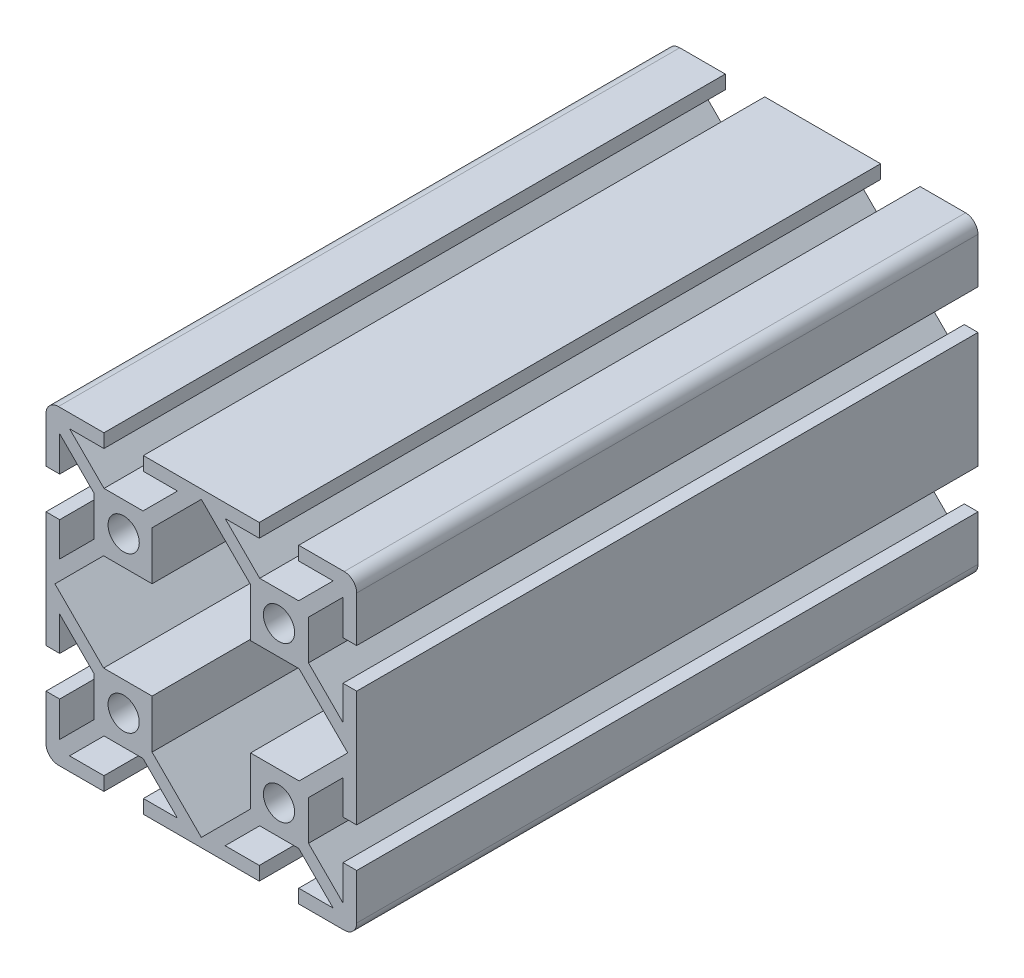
ISO-10303-21;
HEADER;
FILE_DESCRIPTION(('STEP AP214'),'2;1');
FILE_NAME('part.step','',(''),(''),'','','');
FILE_SCHEMA(('AUTOMOTIVE_DESIGN { 1 0 10303 214 1 1 1 1 }'));
ENDSEC;
DATA;
#1=APPLICATION_CONTEXT('core data for automotive mechanical design processes');
#2=APPLICATION_PROTOCOL_DEFINITION('international standard','automotive_design',2000,#1);
#3=PRODUCT_CONTEXT('',#1,'mechanical');
#4=PRODUCT('Part','Part','',(#3));
#5=PRODUCT_RELATED_PRODUCT_CATEGORY('part','',(#4));
#6=PRODUCT_DEFINITION_FORMATION('','',#4);
#7=PRODUCT_DEFINITION_CONTEXT('part definition',#1,'design');
#8=PRODUCT_DEFINITION('design','',#6,#7);
#9=PRODUCT_DEFINITION_SHAPE('','',#8);
#10=(LENGTH_UNIT() NAMED_UNIT(*) SI_UNIT(.MILLI.,.METRE.));
#11=(NAMED_UNIT(*) PLANE_ANGLE_UNIT() SI_UNIT($,.RADIAN.));
#12=(NAMED_UNIT(*) SI_UNIT($,.STERADIAN.) SOLID_ANGLE_UNIT());
#13=UNCERTAINTY_MEASURE_WITH_UNIT(LENGTH_MEASURE(1.E-05),#10,'distance_accuracy_value','');
#14=(GEOMETRIC_REPRESENTATION_CONTEXT(3) GLOBAL_UNCERTAINTY_ASSIGNED_CONTEXT((#13)) GLOBAL_UNIT_ASSIGNED_CONTEXT((#10,
#11,#12)) REPRESENTATION_CONTEXT('',''));
#15=CARTESIAN_POINT('',(0.,0.,0.));
#16=DIRECTION('',(0.,0.,1.));
#17=DIRECTION('',(1.,0.,0.));
#18=AXIS2_PLACEMENT_3D('',#15,#16,#17);
#19=CARTESIAN_POINT('',(-23.1648,15.9258,-101.6));
#20=DIRECTION('',(1.,0.,0.));
#21=DIRECTION('',(0.,1.,0.));
#22=AXIS2_PLACEMENT_3D('',#19,#20,#21);
#23=PLANE('',#22);
#24=DIRECTION('',(0.,1.,0.));
#25=VECTOR('',#24,1.);
#26=CARTESIAN_POINT('',(-23.1648,15.9258,0.));
#27=LINE('',#26,#25);
#28=CARTESIAN_POINT('',(-23.1648,15.9258,0.));
#29=VERTEX_POINT('',#28);
#30=CARTESIAN_POINT('',(-23.1648,21.6530354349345,0.));
#31=VERTEX_POINT('',#30);
#32=EDGE_CURVE('E718',#29,#31,#27,.T.);
#33=ORIENTED_EDGE('',*,*,#32,.F.);
#34=DIRECTION('',(0.,0.,1.));
#35=VECTOR('',#34,1.);
#36=CARTESIAN_POINT('',(-23.1648,15.9258,-101.6));
#37=LINE('',#36,#35);
#38=CARTESIAN_POINT('',(-23.1648,15.9258,-101.6));
#39=VERTEX_POINT('',#38);
#40=EDGE_CURVE('E11',#39,#29,#37,.T.);
#41=ORIENTED_EDGE('',*,*,#40,.F.);
#42=DIRECTION('',(0.,1.,0.));
#43=VECTOR('',#42,1.);
#44=CARTESIAN_POINT('',(-23.1648,15.9258,-101.6));
#45=LINE('',#44,#43);
#46=CARTESIAN_POINT('',(-23.1648,21.6530354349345,-101.6));
#47=VERTEX_POINT('',#46);
#48=EDGE_CURVE('E721',#39,#47,#45,.T.);
#49=ORIENTED_EDGE('',*,*,#48,.T.);
#50=DIRECTION('',(0.,0.,1.));
#51=VECTOR('',#50,1.);
#52=CARTESIAN_POINT('',(-23.1648,21.6530354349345,-101.6));
#53=LINE('',#52,#51);
#54=EDGE_CURVE('E36',#47,#31,#53,.T.);
#55=ORIENTED_EDGE('',*,*,#54,.T.);
#56=EDGE_LOOP('',(#33,#41,#49,#55));
#57=FACE_BOUND('',#56,.T.);
#58=ADVANCED_FACE('F33',(#57),#23,.T.);
#59=CARTESIAN_POINT('',(-23.1648,15.9258,-101.6));
#60=DIRECTION('',(0.,-1.,0.));
#61=DIRECTION('',(0.,0.,-1.));
#62=AXIS2_PLACEMENT_3D('',#59,#60,#61);
#63=PLANE('',#62);
#64=DIRECTION('',(1.,0.,0.));
#65=VECTOR('',#64,1.);
#66=CARTESIAN_POINT('',(-23.1648,15.9258,0.));
#67=LINE('',#66,#65);
#68=CARTESIAN_POINT('',(-25.4,15.9258,0.));
#69=VERTEX_POINT('',#68);
#70=EDGE_CURVE('E725',#69,#29,#67,.T.);
#71=ORIENTED_EDGE('',*,*,#70,.F.);
#72=DIRECTION('',(0.,0.,1.));
#73=VECTOR('',#72,1.);
#74=CARTESIAN_POINT('',(-25.4,15.9258,-101.6));
#75=LINE('',#74,#73);
#76=CARTESIAN_POINT('',(-25.4,15.9258,-101.6));
#77=VERTEX_POINT('',#76);
#78=EDGE_CURVE('E41',#77,#69,#75,.T.);
#79=ORIENTED_EDGE('',*,*,#78,.F.);
#80=DIRECTION('',(1.,0.,0.));
#81=VECTOR('',#80,1.);
#82=CARTESIAN_POINT('',(-23.1648,15.9258,-101.6));
#83=LINE('',#82,#81);
#84=EDGE_CURVE('E935',#77,#39,#83,.T.);
#85=ORIENTED_EDGE('',*,*,#84,.T.);
#86=ORIENTED_EDGE('',*,*,#40,.T.);
#87=EDGE_LOOP('',(#71,#79,#85,#86));
#88=FACE_BOUND('',#87,.T.);
#89=ADVANCED_FACE('F1302',(#88),#63,.T.);
#90=CARTESIAN_POINT('',(-25.4,15.9258,-101.6));
#91=DIRECTION('',(-1.,0.,0.));
#92=DIRECTION('',(0.,-1.,0.));
#93=AXIS2_PLACEMENT_3D('',#90,#91,#92);
#94=PLANE('',#93);
#95=DIRECTION('',(0.,-1.,0.));
#96=VECTOR('',#95,1.);
#97=CARTESIAN_POINT('',(-25.4,15.9258,0.));
#98=LINE('',#97,#96);
#99=CARTESIAN_POINT('',(-25.4,23.368,0.));
#100=VERTEX_POINT('',#99);
#101=EDGE_CURVE('E1147',#100,#69,#98,.T.);
#102=ORIENTED_EDGE('',*,*,#101,.F.);
#103=DIRECTION('',(0.,0.,1.));
#104=VECTOR('',#103,1.);
#105=CARTESIAN_POINT('',(-25.4,23.368,-101.6));
#106=LINE('',#105,#104);
#107=CARTESIAN_POINT('',(-25.4,23.368,-101.6));
#108=VERTEX_POINT('',#107);
#109=EDGE_CURVE('E1153',#108,#100,#106,.T.);
#110=ORIENTED_EDGE('',*,*,#109,.F.);
#111=DIRECTION('',(0.,-1.,0.));
#112=VECTOR('',#111,1.);
#113=CARTESIAN_POINT('',(-25.4,15.9258,-101.6));
#114=LINE('',#113,#112);
#115=EDGE_CURVE('E932',#108,#77,#114,.T.);
#116=ORIENTED_EDGE('',*,*,#115,.T.);
#117=ORIENTED_EDGE('',*,*,#78,.T.);
#118=EDGE_LOOP('',(#102,#110,#116,#117));
#119=FACE_BOUND('',#118,.T.);
#120=ADVANCED_FACE('F1578',(#119),#94,.T.);
#121=CARTESIAN_POINT('',(-23.368,23.368,-101.6));
#122=DIRECTION('',(0.,0.,1.));
#123=DIRECTION('',(1.,0.,0.));
#124=AXIS2_PLACEMENT_3D('',#121,#122,#123);
#125=CYLINDRICAL_SURFACE('',#124,2.032);
#126=CARTESIAN_POINT('',(-23.368,23.368,0.));
#127=DIRECTION('',(0.,0.,1.));
#128=DIRECTION('',(1.,0.,0.));
#129=AXIS2_PLACEMENT_3D('',#126,#127,#128);
#130=CIRCLE('',#129,2.032);
#131=CARTESIAN_POINT('',(-23.368,25.4,0.));
#132=VERTEX_POINT('',#131);
#133=EDGE_CURVE('E1144',#132,#100,#130,.T.);
#134=ORIENTED_EDGE('',*,*,#133,.F.);
#135=DIRECTION('',(0.,0.,1.));
#136=VECTOR('',#135,1.);
#137=CARTESIAN_POINT('',(-23.368,25.4,-101.6));
#138=LINE('',#137,#136);
#139=CARTESIAN_POINT('',(-23.368,25.4,-101.6));
#140=VERTEX_POINT('',#139);
#141=EDGE_CURVE('E1155',#140,#132,#138,.T.);
#142=ORIENTED_EDGE('',*,*,#141,.F.);
#143=CARTESIAN_POINT('',(-23.368,23.368,-101.6));
#144=DIRECTION('',(0.,0.,1.));
#145=DIRECTION('',(1.,0.,0.));
#146=AXIS2_PLACEMENT_3D('',#143,#144,#145);
#147=CIRCLE('',#146,2.032);
#148=EDGE_CURVE('E929',#140,#108,#147,.T.);
#149=ORIENTED_EDGE('',*,*,#148,.T.);
#150=ORIENTED_EDGE('',*,*,#109,.T.);
#151=EDGE_LOOP('',(#134,#142,#149,#150));
#152=FACE_BOUND('',#151,.T.);
#153=ADVANCED_FACE('F1575',(#152),#125,.T.);
#154=CARTESIAN_POINT('',(-23.368,25.4,-101.6));
#155=DIRECTION('',(0.,1.,0.));
#156=DIRECTION('',(0.,0.,1.));
#157=AXIS2_PLACEMENT_3D('',#154,#155,#156);
#158=PLANE('',#157);
#159=DIRECTION('',(-1.,0.,0.));
#160=VECTOR('',#159,1.);
#161=CARTESIAN_POINT('',(-23.368,25.4,0.));
#162=LINE('',#161,#160);
#163=CARTESIAN_POINT('',(-15.9258,25.4,0.));
#164=VERTEX_POINT('',#163);
#165=EDGE_CURVE('E1141',#164,#132,#162,.T.);
#166=ORIENTED_EDGE('',*,*,#165,.F.);
#167=DIRECTION('',(0.,0.,1.));
#168=VECTOR('',#167,1.);
#169=CARTESIAN_POINT('',(-15.9258,25.4,-101.6));
#170=LINE('',#169,#168);
#171=CARTESIAN_POINT('',(-15.9258,25.4,-101.6));
#172=VERTEX_POINT('',#171);
#173=EDGE_CURVE('E1157',#172,#164,#170,.T.);
#174=ORIENTED_EDGE('',*,*,#173,.F.);
#175=DIRECTION('',(-1.,0.,0.));
#176=VECTOR('',#175,1.);
#177=CARTESIAN_POINT('',(-23.368,25.4,-101.6));
#178=LINE('',#177,#176);
#179=EDGE_CURVE('E926',#172,#140,#178,.T.);
#180=ORIENTED_EDGE('',*,*,#179,.T.);
#181=ORIENTED_EDGE('',*,*,#141,.T.);
#182=EDGE_LOOP('',(#166,#174,#180,#181));
#183=FACE_BOUND('',#182,.T.);
#184=ADVANCED_FACE('F1572',(#183),#158,.T.);
#185=CARTESIAN_POINT('',(-15.9258,25.4,-101.6));
#186=DIRECTION('',(1.,0.,0.));
#187=DIRECTION('',(0.,0.,-1.));
#188=AXIS2_PLACEMENT_3D('',#185,#186,#187);
#189=PLANE('',#188);
#190=DIRECTION('',(0.,1.,0.));
#191=VECTOR('',#190,1.);
#192=CARTESIAN_POINT('',(-15.9258,25.4,0.));
#193=LINE('',#192,#191);
#194=CARTESIAN_POINT('',(-15.9258,23.1648,0.));
#195=VERTEX_POINT('',#194);
#196=EDGE_CURVE('E1138',#195,#164,#193,.T.);
#197=ORIENTED_EDGE('',*,*,#196,.F.);
#198=DIRECTION('',(0.,0.,1.));
#199=VECTOR('',#198,1.);
#200=CARTESIAN_POINT('',(-15.9258,23.1648,-101.6));
#201=LINE('',#200,#199);
#202=CARTESIAN_POINT('',(-15.9258,23.1648,-101.6));
#203=VERTEX_POINT('',#202);
#204=EDGE_CURVE('E1159',#203,#195,#201,.T.);
#205=ORIENTED_EDGE('',*,*,#204,.F.);
#206=DIRECTION('',(0.,1.,0.));
#207=VECTOR('',#206,1.);
#208=CARTESIAN_POINT('',(-15.9258,25.4,-101.6));
#209=LINE('',#208,#207);
#210=EDGE_CURVE('E923',#203,#172,#209,.T.);
#211=ORIENTED_EDGE('',*,*,#210,.T.);
#212=ORIENTED_EDGE('',*,*,#173,.T.);
#213=EDGE_LOOP('',(#197,#205,#211,#212));
#214=FACE_BOUND('',#213,.T.);
#215=ADVANCED_FACE('F1568',(#214),#189,.T.);
#216=CARTESIAN_POINT('',(-21.5514354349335,23.1648,-101.6));
#217=DIRECTION('',(0.,-1.,0.));
#218=DIRECTION('',(0.,0.,-1.));
#219=AXIS2_PLACEMENT_3D('',#216,#217,#218);
#220=PLANE('',#219);
#221=DIRECTION('',(1.,0.,0.));
#222=VECTOR('',#221,1.);
#223=CARTESIAN_POINT('',(-21.5514354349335,23.1648,0.));
#224=LINE('',#223,#222);
#225=CARTESIAN_POINT('',(-21.5514354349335,23.1648,0.));
#226=VERTEX_POINT('',#225);
#227=EDGE_CURVE('E1135',#226,#195,#224,.T.);
#228=ORIENTED_EDGE('',*,*,#227,.F.);
#229=DIRECTION('',(0.,0.,1.));
#230=VECTOR('',#229,1.);
#231=CARTESIAN_POINT('',(-21.5514354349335,23.1648,-101.6));
#232=LINE('',#231,#230);
#233=CARTESIAN_POINT('',(-21.5514354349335,23.1648,-101.6));
#234=VERTEX_POINT('',#233);
#235=EDGE_CURVE('E1161',#234,#226,#232,.T.);
#236=ORIENTED_EDGE('',*,*,#235,.F.);
#237=DIRECTION('',(1.,0.,0.));
#238=VECTOR('',#237,1.);
#239=CARTESIAN_POINT('',(-21.5514354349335,23.1648,-101.6));
#240=LINE('',#239,#238);
#241=EDGE_CURVE('E920',#234,#203,#240,.T.);
#242=ORIENTED_EDGE('',*,*,#241,.T.);
#243=ORIENTED_EDGE('',*,*,#204,.T.);
#244=EDGE_LOOP('',(#228,#236,#242,#243));
#245=FACE_BOUND('',#244,.T.);
#246=ADVANCED_FACE('F1564',(#245),#220,.T.);
#247=CARTESIAN_POINT('',(-15.9126354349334,17.526,-101.6));
#248=DIRECTION('',(0.707106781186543,0.707106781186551,0.));
#249=DIRECTION('',(-0.707106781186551,0.707106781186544,0.));
#250=AXIS2_PLACEMENT_3D('',#247,#248,#249);
#251=PLANE('',#250);
#252=DIRECTION('',(-0.707106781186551,0.707106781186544,0.));
#253=VECTOR('',#252,1.);
#254=CARTESIAN_POINT('',(-15.9126354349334,17.526,0.));
#255=LINE('',#254,#253);
#256=CARTESIAN_POINT('',(-15.9126354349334,17.526,0.));
#257=VERTEX_POINT('',#256);
#258=EDGE_CURVE('E1132',#257,#226,#255,.T.);
#259=ORIENTED_EDGE('',*,*,#258,.F.);
#260=DIRECTION('',(0.,0.,1.));
#261=VECTOR('',#260,1.);
#262=CARTESIAN_POINT('',(-15.9126354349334,17.526,-101.6));
#263=LINE('',#262,#261);
#264=CARTESIAN_POINT('',(-15.9126354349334,17.526,-101.6));
#265=VERTEX_POINT('',#264);
#266=EDGE_CURVE('E1163',#265,#257,#263,.T.);
#267=ORIENTED_EDGE('',*,*,#266,.F.);
#268=DIRECTION('',(-0.707106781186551,0.707106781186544,0.));
#269=VECTOR('',#268,1.);
#270=CARTESIAN_POINT('',(-15.9126354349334,17.526,-101.6));
#271=LINE('',#270,#269);
#272=EDGE_CURVE('E917',#265,#234,#271,.T.);
#273=ORIENTED_EDGE('',*,*,#272,.T.);
#274=ORIENTED_EDGE('',*,*,#235,.T.);
#275=EDGE_LOOP('',(#259,#267,#273,#274));
#276=FACE_BOUND('',#275,.T.);
#277=ADVANCED_FACE('F1560',(#276),#251,.T.);
#278=CARTESIAN_POINT('',(-9.53816456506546,17.526,-101.6));
#279=DIRECTION('',(0.,1.,0.));
#280=DIRECTION('',(0.,0.,1.));
#281=AXIS2_PLACEMENT_3D('',#278,#279,#280);
#282=PLANE('',#281);
#283=DIRECTION('',(-1.,0.,0.));
#284=VECTOR('',#283,1.);
#285=CARTESIAN_POINT('',(-9.53816456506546,17.526,0.));
#286=LINE('',#285,#284);
#287=CARTESIAN_POINT('',(-9.53816456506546,17.526,0.));
#288=VERTEX_POINT('',#287);
#289=EDGE_CURVE('E1129',#288,#257,#286,.T.);
#290=ORIENTED_EDGE('',*,*,#289,.F.);
#291=DIRECTION('',(0.,0.,1.));
#292=VECTOR('',#291,1.);
#293=CARTESIAN_POINT('',(-9.53816456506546,17.526,-101.6));
#294=LINE('',#293,#292);
#295=CARTESIAN_POINT('',(-9.53816456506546,17.526,-101.6));
#296=VERTEX_POINT('',#295);
#297=EDGE_CURVE('E1165',#296,#288,#294,.T.);
#298=ORIENTED_EDGE('',*,*,#297,.F.);
#299=DIRECTION('',(-1.,0.,0.));
#300=VECTOR('',#299,1.);
#301=CARTESIAN_POINT('',(-9.53816456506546,17.526,-101.6));
#302=LINE('',#301,#300);
#303=EDGE_CURVE('E914',#296,#265,#302,.T.);
#304=ORIENTED_EDGE('',*,*,#303,.T.);
#305=ORIENTED_EDGE('',*,*,#266,.T.);
#306=EDGE_LOOP('',(#290,#298,#304,#305));
#307=FACE_BOUND('',#306,.T.);
#308=ADVANCED_FACE('F1556',(#307),#282,.T.);
#309=CARTESIAN_POINT('',(-9.53816456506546,17.526,-101.6));
#310=DIRECTION('',(-0.707106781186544,0.707106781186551,0.));
#311=DIRECTION('',(-0.707106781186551,-0.707106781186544,0.));
#312=AXIS2_PLACEMENT_3D('',#309,#310,#311);
#313=PLANE('',#312);
#314=DIRECTION('',(-0.707106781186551,-0.707106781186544,0.));
#315=VECTOR('',#314,1.);
#316=CARTESIAN_POINT('',(-9.53816456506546,17.526,0.));
#317=LINE('',#316,#315);
#318=CARTESIAN_POINT('',(-3.89936456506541,23.1648,0.));
#319=VERTEX_POINT('',#318);
#320=EDGE_CURVE('E1126',#319,#288,#317,.T.);
#321=ORIENTED_EDGE('',*,*,#320,.F.);
#322=DIRECTION('',(0.,0.,1.));
#323=VECTOR('',#322,1.);
#324=CARTESIAN_POINT('',(-3.89936456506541,23.1648,-101.6));
#325=LINE('',#324,#323);
#326=CARTESIAN_POINT('',(-3.89936456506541,23.1648,-101.6));
#327=VERTEX_POINT('',#326);
#328=EDGE_CURVE('E1167',#327,#319,#325,.T.);
#329=ORIENTED_EDGE('',*,*,#328,.F.);
#330=DIRECTION('',(-0.707106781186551,-0.707106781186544,0.));
#331=VECTOR('',#330,1.);
#332=CARTESIAN_POINT('',(-9.53816456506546,17.526,-101.6));
#333=LINE('',#332,#331);
#334=EDGE_CURVE('E911',#327,#296,#333,.T.);
#335=ORIENTED_EDGE('',*,*,#334,.T.);
#336=ORIENTED_EDGE('',*,*,#297,.T.);
#337=EDGE_LOOP('',(#321,#329,#335,#336));
#338=FACE_BOUND('',#337,.T.);
#339=ADVANCED_FACE('F1552',(#338),#313,.T.);
#340=CARTESIAN_POINT('',(-3.89936456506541,23.1648,-101.6));
#341=DIRECTION('',(0.,-1.,0.));
#342=DIRECTION('',(0.,0.,-1.));
#343=AXIS2_PLACEMENT_3D('',#340,#341,#342);
#344=PLANE('',#343);
#345=DIRECTION('',(1.,0.,0.));
#346=VECTOR('',#345,1.);
#347=CARTESIAN_POINT('',(-3.89936456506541,23.1648,0.));
#348=LINE('',#347,#346);
#349=CARTESIAN_POINT('',(-9.4742,23.1648,0.));
#350=VERTEX_POINT('',#349);
#351=EDGE_CURVE('E1123',#350,#319,#348,.T.);
#352=ORIENTED_EDGE('',*,*,#351,.F.);
#353=DIRECTION('',(0.,0.,1.));
#354=VECTOR('',#353,1.);
#355=CARTESIAN_POINT('',(-9.4742,23.1648,-101.6));
#356=LINE('',#355,#354);
#357=CARTESIAN_POINT('',(-9.4742,23.1648,-101.6));
#358=VERTEX_POINT('',#357);
#359=EDGE_CURVE('E1169',#358,#350,#356,.T.);
#360=ORIENTED_EDGE('',*,*,#359,.F.);
#361=DIRECTION('',(1.,0.,0.));
#362=VECTOR('',#361,1.);
#363=CARTESIAN_POINT('',(-3.89936456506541,23.1648,-101.6));
#364=LINE('',#363,#362);
#365=EDGE_CURVE('E908',#358,#327,#364,.T.);
#366=ORIENTED_EDGE('',*,*,#365,.T.);
#367=ORIENTED_EDGE('',*,*,#328,.T.);
#368=EDGE_LOOP('',(#352,#360,#366,#367));
#369=FACE_BOUND('',#368,.T.);
#370=ADVANCED_FACE('F1548',(#369),#344,.T.);
#371=CARTESIAN_POINT('',(-9.4742,25.4,-101.6));
#372=DIRECTION('',(-1.,0.,0.));
#373=DIRECTION('',(0.,0.,1.));
#374=AXIS2_PLACEMENT_3D('',#371,#372,#373);
#375=PLANE('',#374);
#376=DIRECTION('',(0.,-1.,0.));
#377=VECTOR('',#376,1.);
#378=CARTESIAN_POINT('',(-9.4742,25.4,0.));
#379=LINE('',#378,#377);
#380=CARTESIAN_POINT('',(-9.4742,25.4,0.));
#381=VERTEX_POINT('',#380);
#382=EDGE_CURVE('E1120',#381,#350,#379,.T.);
#383=ORIENTED_EDGE('',*,*,#382,.F.);
#384=DIRECTION('',(0.,0.,1.));
#385=VECTOR('',#384,1.);
#386=CARTESIAN_POINT('',(-9.4742,25.4,-101.6));
#387=LINE('',#386,#385);
#388=CARTESIAN_POINT('',(-9.4742,25.4,-101.6));
#389=VERTEX_POINT('',#388);
#390=EDGE_CURVE('E1171',#389,#381,#387,.T.);
#391=ORIENTED_EDGE('',*,*,#390,.F.);
#392=DIRECTION('',(0.,-1.,0.));
#393=VECTOR('',#392,1.);
#394=CARTESIAN_POINT('',(-9.4742,25.4,-101.6));
#395=LINE('',#394,#393);
#396=EDGE_CURVE('E905',#389,#358,#395,.T.);
#397=ORIENTED_EDGE('',*,*,#396,.T.);
#398=ORIENTED_EDGE('',*,*,#359,.T.);
#399=EDGE_LOOP('',(#383,#391,#397,#398));
#400=FACE_BOUND('',#399,.T.);
#401=ADVANCED_FACE('F1544',(#400),#375,.T.);
#402=CARTESIAN_POINT('',(9.4742,25.4,-101.6));
#403=DIRECTION('',(0.,1.,0.));
#404=DIRECTION('',(0.,0.,1.));
#405=AXIS2_PLACEMENT_3D('',#402,#403,#404);
#406=PLANE('',#405);
#407=DIRECTION('',(-1.,0.,0.));
#408=VECTOR('',#407,1.);
#409=CARTESIAN_POINT('',(9.4742,25.4,0.));
#410=LINE('',#409,#408);
#411=CARTESIAN_POINT('',(9.4742,25.4,0.));
#412=VERTEX_POINT('',#411);
#413=EDGE_CURVE('E1117',#412,#381,#410,.T.);
#414=ORIENTED_EDGE('',*,*,#413,.F.);
#415=DIRECTION('',(0.,0.,1.));
#416=VECTOR('',#415,1.);
#417=CARTESIAN_POINT('',(9.4742,25.4,-101.6));
#418=LINE('',#417,#416);
#419=CARTESIAN_POINT('',(9.4742,25.4,-101.6));
#420=VERTEX_POINT('',#419);
#421=EDGE_CURVE('E1173',#420,#412,#418,.T.);
#422=ORIENTED_EDGE('',*,*,#421,.F.);
#423=DIRECTION('',(-1.,0.,0.));
#424=VECTOR('',#423,1.);
#425=CARTESIAN_POINT('',(9.4742,25.4,-101.6));
#426=LINE('',#425,#424);
#427=EDGE_CURVE('E902',#420,#389,#426,.T.);
#428=ORIENTED_EDGE('',*,*,#427,.T.);
#429=ORIENTED_EDGE('',*,*,#390,.T.);
#430=EDGE_LOOP('',(#414,#422,#428,#429));
#431=FACE_BOUND('',#430,.T.);
#432=ADVANCED_FACE('F1540',(#431),#406,.T.);
#433=CARTESIAN_POINT('',(9.4742,25.4,-101.6));
#434=DIRECTION('',(1.,0.,0.));
#435=DIRECTION('',(0.,0.,-1.));
#436=AXIS2_PLACEMENT_3D('',#433,#434,#435);
#437=PLANE('',#436);
#438=DIRECTION('',(0.,1.,0.));
#439=VECTOR('',#438,1.);
#440=CARTESIAN_POINT('',(9.4742,25.4,0.));
#441=LINE('',#440,#439);
#442=CARTESIAN_POINT('',(9.4742,23.1648,0.));
#443=VERTEX_POINT('',#442);
#444=EDGE_CURVE('E1114',#443,#412,#441,.T.);
#445=ORIENTED_EDGE('',*,*,#444,.F.);
#446=DIRECTION('',(0.,0.,1.));
#447=VECTOR('',#446,1.);
#448=CARTESIAN_POINT('',(9.4742,23.1648,-101.6));
#449=LINE('',#448,#447);
#450=CARTESIAN_POINT('',(9.4742,23.1648,-101.6));
#451=VERTEX_POINT('',#450);
#452=EDGE_CURVE('E1175',#451,#443,#449,.T.);
#453=ORIENTED_EDGE('',*,*,#452,.F.);
#454=DIRECTION('',(0.,1.,0.));
#455=VECTOR('',#454,1.);
#456=CARTESIAN_POINT('',(9.4742,25.4,-101.6));
#457=LINE('',#456,#455);
#458=EDGE_CURVE('E899',#451,#420,#457,.T.);
#459=ORIENTED_EDGE('',*,*,#458,.T.);
#460=ORIENTED_EDGE('',*,*,#421,.T.);
#461=EDGE_LOOP('',(#445,#453,#459,#460));
#462=FACE_BOUND('',#461,.T.);
#463=ADVANCED_FACE('F1536',(#462),#437,.T.);
#464=CARTESIAN_POINT('',(3.89936456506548,23.1648,-101.6));
#465=DIRECTION('',(0.,-1.,0.));
#466=DIRECTION('',(0.,0.,-1.));
#467=AXIS2_PLACEMENT_3D('',#464,#465,#466);
#468=PLANE('',#467);
#469=DIRECTION('',(1.,0.,0.));
#470=VECTOR('',#469,1.);
#471=CARTESIAN_POINT('',(3.89936456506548,23.1648,0.));
#472=LINE('',#471,#470);
#473=CARTESIAN_POINT('',(3.89936456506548,23.1648,0.));
#474=VERTEX_POINT('',#473);
#475=EDGE_CURVE('E1111',#474,#443,#472,.T.);
#476=ORIENTED_EDGE('',*,*,#475,.F.);
#477=DIRECTION('',(0.,0.,1.));
#478=VECTOR('',#477,1.);
#479=CARTESIAN_POINT('',(3.89936456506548,23.1648,-101.6));
#480=LINE('',#479,#478);
#481=CARTESIAN_POINT('',(3.89936456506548,23.1648,-101.6));
#482=VERTEX_POINT('',#481);
#483=EDGE_CURVE('E1177',#482,#474,#480,.T.);
#484=ORIENTED_EDGE('',*,*,#483,.F.);
#485=DIRECTION('',(1.,0.,0.));
#486=VECTOR('',#485,1.);
#487=CARTESIAN_POINT('',(3.89936456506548,23.1648,-101.6));
#488=LINE('',#487,#486);
#489=EDGE_CURVE('E896',#482,#451,#488,.T.);
#490=ORIENTED_EDGE('',*,*,#489,.T.);
#491=ORIENTED_EDGE('',*,*,#452,.T.);
#492=EDGE_LOOP('',(#476,#484,#490,#491));
#493=FACE_BOUND('',#492,.T.);
#494=ADVANCED_FACE('F1532',(#493),#468,.T.);
#495=CARTESIAN_POINT('',(9.53816456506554,17.526,-101.6));
#496=DIRECTION('',(0.707106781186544,0.707106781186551,0.));
#497=DIRECTION('',(-0.707106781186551,0.707106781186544,0.));
#498=AXIS2_PLACEMENT_3D('',#495,#496,#497);
#499=PLANE('',#498);
#500=DIRECTION('',(-0.707106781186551,0.707106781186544,0.));
#501=VECTOR('',#500,1.);
#502=CARTESIAN_POINT('',(9.53816456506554,17.526,0.));
#503=LINE('',#502,#501);
#504=CARTESIAN_POINT('',(9.53816456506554,17.526,0.));
#505=VERTEX_POINT('',#504);
#506=EDGE_CURVE('E1108',#505,#474,#503,.T.);
#507=ORIENTED_EDGE('',*,*,#506,.F.);
#508=DIRECTION('',(0.,0.,1.));
#509=VECTOR('',#508,1.);
#510=CARTESIAN_POINT('',(9.53816456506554,17.526,-101.6));
#511=LINE('',#510,#509);
#512=CARTESIAN_POINT('',(9.53816456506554,17.526,-101.6));
#513=VERTEX_POINT('',#512);
#514=EDGE_CURVE('E1179',#513,#505,#511,.T.);
#515=ORIENTED_EDGE('',*,*,#514,.F.);
#516=DIRECTION('',(-0.707106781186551,0.707106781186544,0.));
#517=VECTOR('',#516,1.);
#518=CARTESIAN_POINT('',(9.53816456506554,17.526,-101.6));
#519=LINE('',#518,#517);
#520=EDGE_CURVE('E893',#513,#482,#519,.T.);
#521=ORIENTED_EDGE('',*,*,#520,.T.);
#522=ORIENTED_EDGE('',*,*,#483,.T.);
#523=EDGE_LOOP('',(#507,#515,#521,#522));
#524=FACE_BOUND('',#523,.T.);
#525=ADVANCED_FACE('F1528',(#524),#499,.T.);
#526=CARTESIAN_POINT('',(9.53816456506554,17.526,-101.6));
#527=DIRECTION('',(0.,1.,0.));
#528=DIRECTION('',(-1.,0.,0.));
#529=AXIS2_PLACEMENT_3D('',#526,#527,#528);
#530=PLANE('',#529);
#531=DIRECTION('',(-1.,0.,0.));
#532=VECTOR('',#531,1.);
#533=CARTESIAN_POINT('',(9.53816456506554,17.526,0.));
#534=LINE('',#533,#532);
#535=CARTESIAN_POINT('',(15.9126354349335,17.526,0.));
#536=VERTEX_POINT('',#535);
#537=EDGE_CURVE('E1105',#536,#505,#534,.T.);
#538=ORIENTED_EDGE('',*,*,#537,.F.);
#539=DIRECTION('',(0.,0.,1.));
#540=VECTOR('',#539,1.);
#541=CARTESIAN_POINT('',(15.9126354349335,17.526,-101.6));
#542=LINE('',#541,#540);
#543=CARTESIAN_POINT('',(15.9126354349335,17.526,-101.6));
#544=VERTEX_POINT('',#543);
#545=EDGE_CURVE('E1181',#544,#536,#542,.T.);
#546=ORIENTED_EDGE('',*,*,#545,.F.);
#547=DIRECTION('',(-1.,0.,0.));
#548=VECTOR('',#547,1.);
#549=CARTESIAN_POINT('',(9.53816456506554,17.526,-101.6));
#550=LINE('',#549,#548);
#551=EDGE_CURVE('E890',#544,#513,#550,.T.);
#552=ORIENTED_EDGE('',*,*,#551,.T.);
#553=ORIENTED_EDGE('',*,*,#514,.T.);
#554=EDGE_LOOP('',(#538,#546,#552,#553));
#555=FACE_BOUND('',#554,.T.);
#556=ADVANCED_FACE('F1524',(#555),#530,.T.);
#557=CARTESIAN_POINT('',(15.9126354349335,17.526,-101.6));
#558=DIRECTION('',(-0.707106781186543,0.707106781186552,0.));
#559=DIRECTION('',(-0.707106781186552,-0.707106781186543,0.));
#560=AXIS2_PLACEMENT_3D('',#557,#558,#559);
#561=PLANE('',#560);
#562=DIRECTION('',(-0.707106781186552,-0.707106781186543,0.));
#563=VECTOR('',#562,1.);
#564=CARTESIAN_POINT('',(15.9126354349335,17.526,0.));
#565=LINE('',#564,#563);
#566=CARTESIAN_POINT('',(21.5514354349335,23.1648,0.));
#567=VERTEX_POINT('',#566);
#568=EDGE_CURVE('E1102',#567,#536,#565,.T.);
#569=ORIENTED_EDGE('',*,*,#568,.F.);
#570=DIRECTION('',(0.,0.,1.));
#571=VECTOR('',#570,1.);
#572=CARTESIAN_POINT('',(21.5514354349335,23.1648,-101.6));
#573=LINE('',#572,#571);
#574=CARTESIAN_POINT('',(21.5514354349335,23.1648,-101.6));
#575=VERTEX_POINT('',#574);
#576=EDGE_CURVE('E1183',#575,#567,#573,.T.);
#577=ORIENTED_EDGE('',*,*,#576,.F.);
#578=DIRECTION('',(-0.707106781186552,-0.707106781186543,0.));
#579=VECTOR('',#578,1.);
#580=CARTESIAN_POINT('',(15.9126354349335,17.526,-101.6));
#581=LINE('',#580,#579);
#582=EDGE_CURVE('E887',#575,#544,#581,.T.);
#583=ORIENTED_EDGE('',*,*,#582,.T.);
#584=ORIENTED_EDGE('',*,*,#545,.T.);
#585=EDGE_LOOP('',(#569,#577,#583,#584));
#586=FACE_BOUND('',#585,.T.);
#587=ADVANCED_FACE('F1520',(#586),#561,.T.);
#588=CARTESIAN_POINT('',(21.5514354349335,23.1648,-101.6));
#589=DIRECTION('',(0.,-1.,0.));
#590=DIRECTION('',(0.,0.,-1.));
#591=AXIS2_PLACEMENT_3D('',#588,#589,#590);
#592=PLANE('',#591);
#593=DIRECTION('',(1.,0.,0.));
#594=VECTOR('',#593,1.);
#595=CARTESIAN_POINT('',(21.5514354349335,23.1648,0.));
#596=LINE('',#595,#594);
#597=CARTESIAN_POINT('',(15.9258,23.1648,0.));
#598=VERTEX_POINT('',#597);
#599=EDGE_CURVE('E1099',#598,#567,#596,.T.);
#600=ORIENTED_EDGE('',*,*,#599,.F.);
#601=DIRECTION('',(0.,0.,1.));
#602=VECTOR('',#601,1.);
#603=CARTESIAN_POINT('',(15.9258,23.1648,-101.6));
#604=LINE('',#603,#602);
#605=CARTESIAN_POINT('',(15.9258,23.1648,-101.6));
#606=VERTEX_POINT('',#605);
#607=EDGE_CURVE('E1185',#606,#598,#604,.T.);
#608=ORIENTED_EDGE('',*,*,#607,.F.);
#609=DIRECTION('',(1.,0.,0.));
#610=VECTOR('',#609,1.);
#611=CARTESIAN_POINT('',(21.5514354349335,23.1648,-101.6));
#612=LINE('',#611,#610);
#613=EDGE_CURVE('E884',#606,#575,#612,.T.);
#614=ORIENTED_EDGE('',*,*,#613,.T.);
#615=ORIENTED_EDGE('',*,*,#576,.T.);
#616=EDGE_LOOP('',(#600,#608,#614,#615));
#617=FACE_BOUND('',#616,.T.);
#618=ADVANCED_FACE('F1516',(#617),#592,.T.);
#619=CARTESIAN_POINT('',(15.9258,25.4,-101.6));
#620=DIRECTION('',(-1.,0.,0.));
#621=DIRECTION('',(0.,0.,1.));
#622=AXIS2_PLACEMENT_3D('',#619,#620,#621);
#623=PLANE('',#622);
#624=DIRECTION('',(0.,-1.,0.));
#625=VECTOR('',#624,1.);
#626=CARTESIAN_POINT('',(15.9258,25.4,0.));
#627=LINE('',#626,#625);
#628=CARTESIAN_POINT('',(15.9258,25.4,0.));
#629=VERTEX_POINT('',#628);
#630=EDGE_CURVE('E1096',#629,#598,#627,.T.);
#631=ORIENTED_EDGE('',*,*,#630,.F.);
#632=DIRECTION('',(0.,0.,1.));
#633=VECTOR('',#632,1.);
#634=CARTESIAN_POINT('',(15.9258,25.4,-101.6));
#635=LINE('',#634,#633);
#636=CARTESIAN_POINT('',(15.9258,25.4,-101.6));
#637=VERTEX_POINT('',#636);
#638=EDGE_CURVE('E1187',#637,#629,#635,.T.);
#639=ORIENTED_EDGE('',*,*,#638,.F.);
#640=DIRECTION('',(0.,-1.,0.));
#641=VECTOR('',#640,1.);
#642=CARTESIAN_POINT('',(15.9258,25.4,-101.6));
#643=LINE('',#642,#641);
#644=EDGE_CURVE('E881',#637,#606,#643,.T.);
#645=ORIENTED_EDGE('',*,*,#644,.T.);
#646=ORIENTED_EDGE('',*,*,#607,.T.);
#647=EDGE_LOOP('',(#631,#639,#645,#646));
#648=FACE_BOUND('',#647,.T.);
#649=ADVANCED_FACE('F1512',(#648),#623,.T.);
#650=CARTESIAN_POINT('',(23.368,25.4,-101.6));
#651=DIRECTION('',(0.,1.,0.));
#652=DIRECTION('',(0.,0.,1.));
#653=AXIS2_PLACEMENT_3D('',#650,#651,#652);
#654=PLANE('',#653);
#655=DIRECTION('',(-1.,0.,0.));
#656=VECTOR('',#655,1.);
#657=CARTESIAN_POINT('',(23.368,25.4,0.));
#658=LINE('',#657,#656);
#659=CARTESIAN_POINT('',(23.368,25.4,0.));
#660=VERTEX_POINT('',#659);
#661=EDGE_CURVE('E1093',#660,#629,#658,.T.);
#662=ORIENTED_EDGE('',*,*,#661,.F.);
#663=DIRECTION('',(0.,0.,1.));
#664=VECTOR('',#663,1.);
#665=CARTESIAN_POINT('',(23.368,25.4,-101.6));
#666=LINE('',#665,#664);
#667=CARTESIAN_POINT('',(23.368,25.4,-101.6));
#668=VERTEX_POINT('',#667);
#669=EDGE_CURVE('E1189',#668,#660,#666,.T.);
#670=ORIENTED_EDGE('',*,*,#669,.F.);
#671=DIRECTION('',(-1.,0.,0.));
#672=VECTOR('',#671,1.);
#673=CARTESIAN_POINT('',(23.368,25.4,-101.6));
#674=LINE('',#673,#672);
#675=EDGE_CURVE('E878',#668,#637,#674,.T.);
#676=ORIENTED_EDGE('',*,*,#675,.T.);
#677=ORIENTED_EDGE('',*,*,#638,.T.);
#678=EDGE_LOOP('',(#662,#670,#676,#677));
#679=FACE_BOUND('',#678,.T.);
#680=ADVANCED_FACE('F1508',(#679),#654,.T.);
#681=CARTESIAN_POINT('',(23.368,23.368,-101.6));
#682=DIRECTION('',(0.,0.,1.));
#683=DIRECTION('',(1.,0.,0.));
#684=AXIS2_PLACEMENT_3D('',#681,#682,#683);
#685=CYLINDRICAL_SURFACE('',#684,2.032);
#686=CARTESIAN_POINT('',(23.368,23.368,0.));
#687=DIRECTION('',(0.,0.,1.));
#688=DIRECTION('',(-1.,0.,0.));
#689=AXIS2_PLACEMENT_3D('',#686,#687,#688);
#690=CIRCLE('',#689,2.032);
#691=CARTESIAN_POINT('',(25.4,23.368,0.));
#692=VERTEX_POINT('',#691);
#693=EDGE_CURVE('E1090',#692,#660,#690,.T.);
#694=ORIENTED_EDGE('',*,*,#693,.F.);
#695=DIRECTION('',(0.,0.,1.));
#696=VECTOR('',#695,1.);
#697=CARTESIAN_POINT('',(25.4,23.368,-101.6));
#698=LINE('',#697,#696);
#699=CARTESIAN_POINT('',(25.4,23.368,-101.6));
#700=VERTEX_POINT('',#699);
#701=EDGE_CURVE('E1191',#700,#692,#698,.T.);
#702=ORIENTED_EDGE('',*,*,#701,.F.);
#703=CARTESIAN_POINT('',(23.368,23.368,-101.6));
#704=DIRECTION('',(0.,0.,1.));
#705=DIRECTION('',(-1.,0.,0.));
#706=AXIS2_PLACEMENT_3D('',#703,#704,#705);
#707=CIRCLE('',#706,2.032);
#708=EDGE_CURVE('E875',#700,#668,#707,.T.);
#709=ORIENTED_EDGE('',*,*,#708,.T.);
#710=ORIENTED_EDGE('',*,*,#669,.T.);
#711=EDGE_LOOP('',(#694,#702,#709,#710));
#712=FACE_BOUND('',#711,.T.);
#713=ADVANCED_FACE('F1504',(#712),#685,.T.);
#714=CARTESIAN_POINT('',(25.4,15.9258,-101.6));
#715=DIRECTION('',(1.,0.,0.));
#716=DIRECTION('',(0.,1.,0.));
#717=AXIS2_PLACEMENT_3D('',#714,#715,#716);
#718=PLANE('',#717);
#719=DIRECTION('',(0.,1.,0.));
#720=VECTOR('',#719,1.);
#721=CARTESIAN_POINT('',(25.4,15.9258,0.));
#722=LINE('',#721,#720);
#723=CARTESIAN_POINT('',(25.4,15.9258,0.));
#724=VERTEX_POINT('',#723);
#725=EDGE_CURVE('E1087',#724,#692,#722,.T.);
#726=ORIENTED_EDGE('',*,*,#725,.F.);
#727=DIRECTION('',(0.,0.,1.));
#728=VECTOR('',#727,1.);
#729=CARTESIAN_POINT('',(25.4,15.9258,-101.6));
#730=LINE('',#729,#728);
#731=CARTESIAN_POINT('',(25.4,15.9258,-101.6));
#732=VERTEX_POINT('',#731);
#733=EDGE_CURVE('E1193',#732,#724,#730,.T.);
#734=ORIENTED_EDGE('',*,*,#733,.F.);
#735=DIRECTION('',(0.,1.,0.));
#736=VECTOR('',#735,1.);
#737=CARTESIAN_POINT('',(25.4,15.9258,-101.6));
#738=LINE('',#737,#736);
#739=EDGE_CURVE('E872',#732,#700,#738,.T.);
#740=ORIENTED_EDGE('',*,*,#739,.T.);
#741=ORIENTED_EDGE('',*,*,#701,.T.);
#742=EDGE_LOOP('',(#726,#734,#740,#741));
#743=FACE_BOUND('',#742,.T.);
#744=ADVANCED_FACE('F1500',(#743),#718,.T.);
#745=CARTESIAN_POINT('',(23.1648,15.9258,-101.6));
#746=DIRECTION('',(0.,-1.,0.));
#747=DIRECTION('',(0.,0.,-1.));
#748=AXIS2_PLACEMENT_3D('',#745,#746,#747);
#749=PLANE('',#748);
#750=DIRECTION('',(1.,0.,0.));
#751=VECTOR('',#750,1.);
#752=CARTESIAN_POINT('',(23.1648,15.9258,0.));
#753=LINE('',#752,#751);
#754=CARTESIAN_POINT('',(23.1648,15.9258,0.));
#755=VERTEX_POINT('',#754);
#756=EDGE_CURVE('E1084',#755,#724,#753,.T.);
#757=ORIENTED_EDGE('',*,*,#756,.F.);
#758=DIRECTION('',(0.,0.,1.));
#759=VECTOR('',#758,1.);
#760=CARTESIAN_POINT('',(23.1648,15.9258,-101.6));
#761=LINE('',#760,#759);
#762=CARTESIAN_POINT('',(23.1648,15.9258,-101.6));
#763=VERTEX_POINT('',#762);
#764=EDGE_CURVE('E1195',#763,#755,#761,.T.);
#765=ORIENTED_EDGE('',*,*,#764,.F.);
#766=DIRECTION('',(1.,0.,0.));
#767=VECTOR('',#766,1.);
#768=CARTESIAN_POINT('',(23.1648,15.9258,-101.6));
#769=LINE('',#768,#767);
#770=EDGE_CURVE('E869',#763,#732,#769,.T.);
#771=ORIENTED_EDGE('',*,*,#770,.T.);
#772=ORIENTED_EDGE('',*,*,#733,.T.);
#773=EDGE_LOOP('',(#757,#765,#771,#772));
#774=FACE_BOUND('',#773,.T.);
#775=ADVANCED_FACE('F1496',(#774),#749,.T.);
#776=CARTESIAN_POINT('',(23.1648,15.9258,-101.6));
#777=DIRECTION('',(-1.,0.,0.));
#778=DIRECTION('',(0.,-1.,0.));
#779=AXIS2_PLACEMENT_3D('',#776,#777,#778);
#780=PLANE('',#779);
#781=DIRECTION('',(0.,-1.,0.));
#782=VECTOR('',#781,1.);
#783=CARTESIAN_POINT('',(23.1648,15.9258,0.));
#784=LINE('',#783,#782);
#785=CARTESIAN_POINT('',(23.1648,21.6530354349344,0.));
#786=VERTEX_POINT('',#785);
#787=EDGE_CURVE('E1081',#786,#755,#784,.T.);
#788=ORIENTED_EDGE('',*,*,#787,.F.);
#789=DIRECTION('',(0.,0.,1.));
#790=VECTOR('',#789,1.);
#791=CARTESIAN_POINT('',(23.1648,21.6530354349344,-101.6));
#792=LINE('',#791,#790);
#793=CARTESIAN_POINT('',(23.1648,21.6530354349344,-101.6));
#794=VERTEX_POINT('',#793);
#795=EDGE_CURVE('E1197',#794,#786,#792,.T.);
#796=ORIENTED_EDGE('',*,*,#795,.F.);
#797=DIRECTION('',(0.,-1.,0.));
#798=VECTOR('',#797,1.);
#799=CARTESIAN_POINT('',(23.1648,15.9258,-101.6));
#800=LINE('',#799,#798);
#801=EDGE_CURVE('E866',#794,#763,#800,.T.);
#802=ORIENTED_EDGE('',*,*,#801,.T.);
#803=ORIENTED_EDGE('',*,*,#764,.T.);
#804=EDGE_LOOP('',(#788,#796,#802,#803));
#805=FACE_BOUND('',#804,.T.);
#806=ADVANCED_FACE('F1492',(#805),#780,.T.);
#807=CARTESIAN_POINT('',(17.526,16.0142354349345,-101.6));
#808=DIRECTION('',(0.707106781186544,-0.707106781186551,0.));
#809=DIRECTION('',(0.707106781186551,0.707106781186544,0.));
#810=AXIS2_PLACEMENT_3D('',#807,#808,#809);
#811=PLANE('',#810);
#812=DIRECTION('',(0.707106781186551,0.707106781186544,0.));
#813=VECTOR('',#812,1.);
#814=CARTESIAN_POINT('',(17.526,16.0142354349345,0.));
#815=LINE('',#814,#813);
#816=CARTESIAN_POINT('',(17.526,16.0142354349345,0.));
#817=VERTEX_POINT('',#816);
#818=EDGE_CURVE('E1078',#817,#786,#815,.T.);
#819=ORIENTED_EDGE('',*,*,#818,.F.);
#820=DIRECTION('',(0.,0.,1.));
#821=VECTOR('',#820,1.);
#822=CARTESIAN_POINT('',(17.526,16.0142354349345,-101.6));
#823=LINE('',#822,#821);
#824=CARTESIAN_POINT('',(17.526,16.0142354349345,-101.6));
#825=VERTEX_POINT('',#824);
#826=EDGE_CURVE('E1199',#825,#817,#823,.T.);
#827=ORIENTED_EDGE('',*,*,#826,.F.);
#828=DIRECTION('',(0.707106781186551,0.707106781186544,0.));
#829=VECTOR('',#828,1.);
#830=CARTESIAN_POINT('',(17.526,16.0142354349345,-101.6));
#831=LINE('',#830,#829);
#832=EDGE_CURVE('E863',#825,#794,#831,.T.);
#833=ORIENTED_EDGE('',*,*,#832,.T.);
#834=ORIENTED_EDGE('',*,*,#795,.T.);
#835=EDGE_LOOP('',(#819,#827,#833,#834));
#836=FACE_BOUND('',#835,.T.);
#837=ADVANCED_FACE('F1488',(#836),#811,.T.);
#838=CARTESIAN_POINT('',(17.526,9.53816456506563,-101.6));
#839=DIRECTION('',(1.,0.,0.));
#840=DIRECTION('',(0.,0.,-1.));
#841=AXIS2_PLACEMENT_3D('',#838,#839,#840);
#842=PLANE('',#841);
#843=DIRECTION('',(0.,1.,0.));
#844=VECTOR('',#843,1.);
#845=CARTESIAN_POINT('',(17.526,9.53816456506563,0.));
#846=LINE('',#845,#844);
#847=CARTESIAN_POINT('',(17.526,9.53816456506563,0.));
#848=VERTEX_POINT('',#847);
#849=EDGE_CURVE('E1075',#848,#817,#846,.T.);
#850=ORIENTED_EDGE('',*,*,#849,.F.);
#851=DIRECTION('',(0.,0.,1.));
#852=VECTOR('',#851,1.);
#853=CARTESIAN_POINT('',(17.526,9.53816456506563,-101.6));
#854=LINE('',#853,#852);
#855=CARTESIAN_POINT('',(17.526,9.53816456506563,-101.6));
#856=VERTEX_POINT('',#855);
#857=EDGE_CURVE('E1201',#856,#848,#854,.T.);
#858=ORIENTED_EDGE('',*,*,#857,.F.);
#859=DIRECTION('',(0.,1.,0.));
#860=VECTOR('',#859,1.);
#861=CARTESIAN_POINT('',(17.526,9.53816456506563,-101.6));
#862=LINE('',#861,#860);
#863=EDGE_CURVE('E860',#856,#825,#862,.T.);
#864=ORIENTED_EDGE('',*,*,#863,.T.);
#865=ORIENTED_EDGE('',*,*,#826,.T.);
#866=EDGE_LOOP('',(#850,#858,#864,#865));
#867=FACE_BOUND('',#866,.T.);
#868=ADVANCED_FACE('F1484',(#867),#842,.T.);
#869=CARTESIAN_POINT('',(17.526,9.53816456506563,-101.6));
#870=DIRECTION('',(0.707106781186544,0.707106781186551,0.));
#871=DIRECTION('',(-0.707106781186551,0.707106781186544,0.));
#872=AXIS2_PLACEMENT_3D('',#869,#870,#871);
#873=PLANE('',#872);
#874=DIRECTION('',(-0.707106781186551,0.707106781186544,0.));
#875=VECTOR('',#874,1.);
#876=CARTESIAN_POINT('',(17.526,9.53816456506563,0.));
#877=LINE('',#876,#875);
#878=CARTESIAN_POINT('',(23.1648,3.89936456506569,0.));
#879=VERTEX_POINT('',#878);
#880=EDGE_CURVE('E1072',#879,#848,#877,.T.);
#881=ORIENTED_EDGE('',*,*,#880,.F.);
#882=DIRECTION('',(0.,0.,1.));
#883=VECTOR('',#882,1.);
#884=CARTESIAN_POINT('',(23.1648,3.89936456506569,-101.6));
#885=LINE('',#884,#883);
#886=CARTESIAN_POINT('',(23.1648,3.89936456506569,-101.6));
#887=VERTEX_POINT('',#886);
#888=EDGE_CURVE('E1203',#887,#879,#885,.T.);
#889=ORIENTED_EDGE('',*,*,#888,.F.);
#890=DIRECTION('',(-0.707106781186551,0.707106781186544,0.));
#891=VECTOR('',#890,1.);
#892=CARTESIAN_POINT('',(17.526,9.53816456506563,-101.6));
#893=LINE('',#892,#891);
#894=EDGE_CURVE('E857',#887,#856,#893,.T.);
#895=ORIENTED_EDGE('',*,*,#894,.T.);
#896=ORIENTED_EDGE('',*,*,#857,.T.);
#897=EDGE_LOOP('',(#881,#889,#895,#896));
#898=FACE_BOUND('',#897,.T.);
#899=ADVANCED_FACE('F1480',(#898),#873,.T.);
#900=CARTESIAN_POINT('',(23.1648,9.4742,-101.6));
#901=DIRECTION('',(-1.,0.,0.));
#902=DIRECTION('',(0.,-1.,0.));
#903=AXIS2_PLACEMENT_3D('',#900,#901,#902);
#904=PLANE('',#903);
#905=DIRECTION('',(0.,-1.,0.));
#906=VECTOR('',#905,1.);
#907=CARTESIAN_POINT('',(23.1648,9.4742,0.));
#908=LINE('',#907,#906);
#909=CARTESIAN_POINT('',(23.1648,9.4742,0.));
#910=VERTEX_POINT('',#909);
#911=EDGE_CURVE('E1069',#910,#879,#908,.T.);
#912=ORIENTED_EDGE('',*,*,#911,.F.);
#913=DIRECTION('',(0.,0.,1.));
#914=VECTOR('',#913,1.);
#915=CARTESIAN_POINT('',(23.1648,9.4742,-101.6));
#916=LINE('',#915,#914);
#917=CARTESIAN_POINT('',(23.1648,9.4742,-101.6));
#918=VERTEX_POINT('',#917);
#919=EDGE_CURVE('E1205',#918,#910,#916,.T.);
#920=ORIENTED_EDGE('',*,*,#919,.F.);
#921=DIRECTION('',(0.,-1.,0.));
#922=VECTOR('',#921,1.);
#923=CARTESIAN_POINT('',(23.1648,9.4742,-101.6));
#924=LINE('',#923,#922);
#925=EDGE_CURVE('E854',#918,#887,#924,.T.);
#926=ORIENTED_EDGE('',*,*,#925,.T.);
#927=ORIENTED_EDGE('',*,*,#888,.T.);
#928=EDGE_LOOP('',(#912,#920,#926,#927));
#929=FACE_BOUND('',#928,.T.);
#930=ADVANCED_FACE('F1476',(#929),#904,.T.);
#931=CARTESIAN_POINT('',(23.1648,9.4742,-101.6));
#932=DIRECTION('',(0.,1.,0.));
#933=DIRECTION('',(-1.,0.,0.));
#934=AXIS2_PLACEMENT_3D('',#931,#932,#933);
#935=PLANE('',#934);
#936=DIRECTION('',(-1.,0.,0.));
#937=VECTOR('',#936,1.);
#938=CARTESIAN_POINT('',(23.1648,9.4742,0.));
#939=LINE('',#938,#937);
#940=CARTESIAN_POINT('',(25.4,9.4742,0.));
#941=VERTEX_POINT('',#940);
#942=EDGE_CURVE('E1066',#941,#910,#939,.T.);
#943=ORIENTED_EDGE('',*,*,#942,.F.);
#944=DIRECTION('',(0.,0.,1.));
#945=VECTOR('',#944,1.);
#946=CARTESIAN_POINT('',(25.4,9.4742,-101.6));
#947=LINE('',#946,#945);
#948=CARTESIAN_POINT('',(25.4,9.4742,-101.6));
#949=VERTEX_POINT('',#948);
#950=EDGE_CURVE('E1207',#949,#941,#947,.T.);
#951=ORIENTED_EDGE('',*,*,#950,.F.);
#952=DIRECTION('',(-1.,0.,0.));
#953=VECTOR('',#952,1.);
#954=CARTESIAN_POINT('',(23.1648,9.4742,-101.6));
#955=LINE('',#954,#953);
#956=EDGE_CURVE('E851',#949,#918,#955,.T.);
#957=ORIENTED_EDGE('',*,*,#956,.T.);
#958=ORIENTED_EDGE('',*,*,#919,.T.);
#959=EDGE_LOOP('',(#943,#951,#957,#958));
#960=FACE_BOUND('',#959,.T.);
#961=ADVANCED_FACE('F1472',(#960),#935,.T.);
#962=CARTESIAN_POINT('',(25.4,9.4742,-101.6));
#963=DIRECTION('',(1.,0.,0.));
#964=DIRECTION('',(0.,0.,-1.));
#965=AXIS2_PLACEMENT_3D('',#962,#963,#964);
#966=PLANE('',#965);
#967=DIRECTION('',(0.,1.,0.));
#968=VECTOR('',#967,1.);
#969=CARTESIAN_POINT('',(25.4,9.4742,0.));
#970=LINE('',#969,#968);
#971=CARTESIAN_POINT('',(25.4,-9.4742,0.));
#972=VERTEX_POINT('',#971);
#973=EDGE_CURVE('E1063',#972,#941,#970,.T.);
#974=ORIENTED_EDGE('',*,*,#973,.F.);
#975=DIRECTION('',(0.,0.,1.));
#976=VECTOR('',#975,1.);
#977=CARTESIAN_POINT('',(25.4,-9.4742,-101.6));
#978=LINE('',#977,#976);
#979=CARTESIAN_POINT('',(25.4,-9.4742,-101.6));
#980=VERTEX_POINT('',#979);
#981=EDGE_CURVE('E1209',#980,#972,#978,.T.);
#982=ORIENTED_EDGE('',*,*,#981,.F.);
#983=DIRECTION('',(0.,1.,0.));
#984=VECTOR('',#983,1.);
#985=CARTESIAN_POINT('',(25.4,9.4742,-101.6));
#986=LINE('',#985,#984);
#987=EDGE_CURVE('E848',#980,#949,#986,.T.);
#988=ORIENTED_EDGE('',*,*,#987,.T.);
#989=ORIENTED_EDGE('',*,*,#950,.T.);
#990=EDGE_LOOP('',(#974,#982,#988,#989));
#991=FACE_BOUND('',#990,.T.);
#992=ADVANCED_FACE('F1468',(#991),#966,.T.);
#993=CARTESIAN_POINT('',(23.1648,-9.4742,-101.6));
#994=DIRECTION('',(0.,-1.,0.));
#995=DIRECTION('',(1.,0.,0.));
#996=AXIS2_PLACEMENT_3D('',#993,#994,#995);
#997=PLANE('',#996);
#998=DIRECTION('',(1.,0.,0.));
#999=VECTOR('',#998,1.);
#1000=CARTESIAN_POINT('',(23.1648,-9.4742,0.));
#1001=LINE('',#1000,#999);
#1002=CARTESIAN_POINT('',(23.1648,-9.4742,0.));
#1003=VERTEX_POINT('',#1002);
#1004=EDGE_CURVE('E1060',#1003,#972,#1001,.T.);
#1005=ORIENTED_EDGE('',*,*,#1004,.F.);
#1006=DIRECTION('',(0.,0.,1.));
#1007=VECTOR('',#1006,1.);
#1008=CARTESIAN_POINT('',(23.1648,-9.4742,-101.6));
#1009=LINE('',#1008,#1007);
#1010=CARTESIAN_POINT('',(23.1648,-9.4742,-101.6));
#1011=VERTEX_POINT('',#1010);
#1012=EDGE_CURVE('E1211',#1011,#1003,#1009,.T.);
#1013=ORIENTED_EDGE('',*,*,#1012,.F.);
#1014=DIRECTION('',(1.,0.,0.));
#1015=VECTOR('',#1014,1.);
#1016=CARTESIAN_POINT('',(23.1648,-9.4742,-101.6));
#1017=LINE('',#1016,#1015);
#1018=EDGE_CURVE('E845',#1011,#980,#1017,.T.);
#1019=ORIENTED_EDGE('',*,*,#1018,.T.);
#1020=ORIENTED_EDGE('',*,*,#981,.T.);
#1021=EDGE_LOOP('',(#1005,#1013,#1019,#1020));
#1022=FACE_BOUND('',#1021,.T.);
#1023=ADVANCED_FACE('F1464',(#1022),#997,.T.);
#1024=CARTESIAN_POINT('',(23.1648,-9.4742,-101.6));
#1025=DIRECTION('',(-1.,0.,0.));
#1026=DIRECTION('',(0.,-1.,0.));
#1027=AXIS2_PLACEMENT_3D('',#1024,#1025,#1026);
#1028=PLANE('',#1027);
#1029=DIRECTION('',(0.,-1.,0.));
#1030=VECTOR('',#1029,1.);
#1031=CARTESIAN_POINT('',(23.1648,-9.4742,0.));
#1032=LINE('',#1031,#1030);
#1033=CARTESIAN_POINT('',(23.1648,-3.89936456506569,0.));
#1034=VERTEX_POINT('',#1033);
#1035=EDGE_CURVE('E1057',#1034,#1003,#1032,.T.);
#1036=ORIENTED_EDGE('',*,*,#1035,.F.);
#1037=DIRECTION('',(0.,0.,1.));
#1038=VECTOR('',#1037,1.);
#1039=CARTESIAN_POINT('',(23.1648,-3.89936456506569,-101.6));
#1040=LINE('',#1039,#1038);
#1041=CARTESIAN_POINT('',(23.1648,-3.89936456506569,-101.6));
#1042=VERTEX_POINT('',#1041);
#1043=EDGE_CURVE('E1213',#1042,#1034,#1040,.T.);
#1044=ORIENTED_EDGE('',*,*,#1043,.F.);
#1045=DIRECTION('',(0.,-1.,0.));
#1046=VECTOR('',#1045,1.);
#1047=CARTESIAN_POINT('',(23.1648,-9.4742,-101.6));
#1048=LINE('',#1047,#1046);
#1049=EDGE_CURVE('E842',#1042,#1011,#1048,.T.);
#1050=ORIENTED_EDGE('',*,*,#1049,.T.);
#1051=ORIENTED_EDGE('',*,*,#1012,.T.);
#1052=EDGE_LOOP('',(#1036,#1044,#1050,#1051));
#1053=FACE_BOUND('',#1052,.T.);
#1054=ADVANCED_FACE('F1460',(#1053),#1028,.T.);
#1055=CARTESIAN_POINT('',(17.526,-9.53816456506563,-101.6));
#1056=DIRECTION('',(0.707106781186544,-0.707106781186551,0.));
#1057=DIRECTION('',(0.707106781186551,0.707106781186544,0.));
#1058=AXIS2_PLACEMENT_3D('',#1055,#1056,#1057);
#1059=PLANE('',#1058);
#1060=DIRECTION('',(0.707106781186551,0.707106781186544,0.));
#1061=VECTOR('',#1060,1.);
#1062=CARTESIAN_POINT('',(17.526,-9.53816456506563,0.));
#1063=LINE('',#1062,#1061);
#1064=CARTESIAN_POINT('',(17.526,-9.53816456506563,0.));
#1065=VERTEX_POINT('',#1064);
#1066=EDGE_CURVE('E1054',#1065,#1034,#1063,.T.);
#1067=ORIENTED_EDGE('',*,*,#1066,.F.);
#1068=DIRECTION('',(0.,0.,1.));
#1069=VECTOR('',#1068,1.);
#1070=CARTESIAN_POINT('',(17.526,-9.53816456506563,-101.6));
#1071=LINE('',#1070,#1069);
#1072=CARTESIAN_POINT('',(17.526,-9.53816456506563,-101.6));
#1073=VERTEX_POINT('',#1072);
#1074=EDGE_CURVE('E1215',#1073,#1065,#1071,.T.);
#1075=ORIENTED_EDGE('',*,*,#1074,.F.);
#1076=DIRECTION('',(0.707106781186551,0.707106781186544,0.));
#1077=VECTOR('',#1076,1.);
#1078=CARTESIAN_POINT('',(17.526,-9.53816456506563,-101.6));
#1079=LINE('',#1078,#1077);
#1080=EDGE_CURVE('E839',#1073,#1042,#1079,.T.);
#1081=ORIENTED_EDGE('',*,*,#1080,.T.);
#1082=ORIENTED_EDGE('',*,*,#1043,.T.);
#1083=EDGE_LOOP('',(#1067,#1075,#1081,#1082));
#1084=FACE_BOUND('',#1083,.T.);
#1085=ADVANCED_FACE('F1456',(#1084),#1059,.T.);
#1086=CARTESIAN_POINT('',(17.526,-9.53816456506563,-101.6));
#1087=DIRECTION('',(1.,0.,0.));
#1088=DIRECTION('',(0.,0.,-1.));
#1089=AXIS2_PLACEMENT_3D('',#1086,#1087,#1088);
#1090=PLANE('',#1089);
#1091=DIRECTION('',(0.,1.,0.));
#1092=VECTOR('',#1091,1.);
#1093=CARTESIAN_POINT('',(17.526,-9.53816456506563,0.));
#1094=LINE('',#1093,#1092);
#1095=CARTESIAN_POINT('',(17.526,-16.0142354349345,0.));
#1096=VERTEX_POINT('',#1095);
#1097=EDGE_CURVE('E1051',#1096,#1065,#1094,.T.);
#1098=ORIENTED_EDGE('',*,*,#1097,.F.);
#1099=DIRECTION('',(0.,0.,1.));
#1100=VECTOR('',#1099,1.);
#1101=CARTESIAN_POINT('',(17.526,-16.0142354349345,-101.6));
#1102=LINE('',#1101,#1100);
#1103=CARTESIAN_POINT('',(17.526,-16.0142354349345,-101.6));
#1104=VERTEX_POINT('',#1103);
#1105=EDGE_CURVE('E1217',#1104,#1096,#1102,.T.);
#1106=ORIENTED_EDGE('',*,*,#1105,.F.);
#1107=DIRECTION('',(0.,1.,0.));
#1108=VECTOR('',#1107,1.);
#1109=CARTESIAN_POINT('',(17.526,-9.53816456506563,-101.6));
#1110=LINE('',#1109,#1108);
#1111=EDGE_CURVE('E836',#1104,#1073,#1110,.T.);
#1112=ORIENTED_EDGE('',*,*,#1111,.T.);
#1113=ORIENTED_EDGE('',*,*,#1074,.T.);
#1114=EDGE_LOOP('',(#1098,#1106,#1112,#1113));
#1115=FACE_BOUND('',#1114,.T.);
#1116=ADVANCED_FACE('F1452',(#1115),#1090,.T.);
#1117=CARTESIAN_POINT('',(17.526,-16.0142354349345,-101.6));
#1118=DIRECTION('',(0.707106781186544,0.707106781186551,0.));
#1119=DIRECTION('',(-0.707106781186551,0.707106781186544,0.));
#1120=AXIS2_PLACEMENT_3D('',#1117,#1118,#1119);
#1121=PLANE('',#1120);
#1122=DIRECTION('',(-0.707106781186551,0.707106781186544,0.));
#1123=VECTOR('',#1122,1.);
#1124=CARTESIAN_POINT('',(17.526,-16.0142354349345,0.));
#1125=LINE('',#1124,#1123);
#1126=CARTESIAN_POINT('',(23.1648,-21.6530354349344,0.));
#1127=VERTEX_POINT('',#1126);
#1128=EDGE_CURVE('E1048',#1127,#1096,#1125,.T.);
#1129=ORIENTED_EDGE('',*,*,#1128,.F.);
#1130=DIRECTION('',(0.,0.,1.));
#1131=VECTOR('',#1130,1.);
#1132=CARTESIAN_POINT('',(23.1648,-21.6530354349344,-101.6));
#1133=LINE('',#1132,#1131);
#1134=CARTESIAN_POINT('',(23.1648,-21.6530354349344,-101.6));
#1135=VERTEX_POINT('',#1134);
#1136=EDGE_CURVE('E1219',#1135,#1127,#1133,.T.);
#1137=ORIENTED_EDGE('',*,*,#1136,.F.);
#1138=DIRECTION('',(-0.707106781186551,0.707106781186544,0.));
#1139=VECTOR('',#1138,1.);
#1140=CARTESIAN_POINT('',(17.526,-16.0142354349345,-101.6));
#1141=LINE('',#1140,#1139);
#1142=EDGE_CURVE('E833',#1135,#1104,#1141,.T.);
#1143=ORIENTED_EDGE('',*,*,#1142,.T.);
#1144=ORIENTED_EDGE('',*,*,#1105,.T.);
#1145=EDGE_LOOP('',(#1129,#1137,#1143,#1144));
#1146=FACE_BOUND('',#1145,.T.);
#1147=ADVANCED_FACE('F1448',(#1146),#1121,.T.);
#1148=CARTESIAN_POINT('',(23.1648,-15.9258,-101.6));
#1149=DIRECTION('',(-1.,0.,0.));
#1150=DIRECTION('',(0.,-1.,0.));
#1151=AXIS2_PLACEMENT_3D('',#1148,#1149,#1150);
#1152=PLANE('',#1151);
#1153=DIRECTION('',(0.,-1.,0.));
#1154=VECTOR('',#1153,1.);
#1155=CARTESIAN_POINT('',(23.1648,-15.9258,0.));
#1156=LINE('',#1155,#1154);
#1157=CARTESIAN_POINT('',(23.1648,-15.9258,0.));
#1158=VERTEX_POINT('',#1157);
#1159=EDGE_CURVE('E1045',#1158,#1127,#1156,.T.);
#1160=ORIENTED_EDGE('',*,*,#1159,.F.);
#1161=DIRECTION('',(0.,0.,1.));
#1162=VECTOR('',#1161,1.);
#1163=CARTESIAN_POINT('',(23.1648,-15.9258,-101.6));
#1164=LINE('',#1163,#1162);
#1165=CARTESIAN_POINT('',(23.1648,-15.9258,-101.6));
#1166=VERTEX_POINT('',#1165);
#1167=EDGE_CURVE('E1221',#1166,#1158,#1164,.T.);
#1168=ORIENTED_EDGE('',*,*,#1167,.F.);
#1169=DIRECTION('',(0.,-1.,0.));
#1170=VECTOR('',#1169,1.);
#1171=CARTESIAN_POINT('',(23.1648,-15.9258,-101.6));
#1172=LINE('',#1171,#1170);
#1173=EDGE_CURVE('E830',#1166,#1135,#1172,.T.);
#1174=ORIENTED_EDGE('',*,*,#1173,.T.);
#1175=ORIENTED_EDGE('',*,*,#1136,.T.);
#1176=EDGE_LOOP('',(#1160,#1168,#1174,#1175));
#1177=FACE_BOUND('',#1176,.T.);
#1178=ADVANCED_FACE('F1444',(#1177),#1152,.T.);
#1179=CARTESIAN_POINT('',(23.1648,-15.9258,-101.6));
#1180=DIRECTION('',(0.,1.,0.));
#1181=DIRECTION('',(0.,0.,1.));
#1182=AXIS2_PLACEMENT_3D('',#1179,#1180,#1181);
#1183=PLANE('',#1182);
#1184=DIRECTION('',(-1.,0.,0.));
#1185=VECTOR('',#1184,1.);
#1186=CARTESIAN_POINT('',(23.1648,-15.9258,0.));
#1187=LINE('',#1186,#1185);
#1188=CARTESIAN_POINT('',(25.4,-15.9258,0.));
#1189=VERTEX_POINT('',#1188);
#1190=EDGE_CURVE('E1042',#1189,#1158,#1187,.T.);
#1191=ORIENTED_EDGE('',*,*,#1190,.F.);
#1192=DIRECTION('',(0.,0.,1.));
#1193=VECTOR('',#1192,1.);
#1194=CARTESIAN_POINT('',(25.4,-15.9258,-101.6));
#1195=LINE('',#1194,#1193);
#1196=CARTESIAN_POINT('',(25.4,-15.9258,-101.6));
#1197=VERTEX_POINT('',#1196);
#1198=EDGE_CURVE('E1223',#1197,#1189,#1195,.T.);
#1199=ORIENTED_EDGE('',*,*,#1198,.F.);
#1200=DIRECTION('',(-1.,0.,0.));
#1201=VECTOR('',#1200,1.);
#1202=CARTESIAN_POINT('',(23.1648,-15.9258,-101.6));
#1203=LINE('',#1202,#1201);
#1204=EDGE_CURVE('E827',#1197,#1166,#1203,.T.);
#1205=ORIENTED_EDGE('',*,*,#1204,.T.);
#1206=ORIENTED_EDGE('',*,*,#1167,.T.);
#1207=EDGE_LOOP('',(#1191,#1199,#1205,#1206));
#1208=FACE_BOUND('',#1207,.T.);
#1209=ADVANCED_FACE('F1440',(#1208),#1183,.T.);
#1210=CARTESIAN_POINT('',(25.4,-15.9258,-101.6));
#1211=DIRECTION('',(1.,0.,0.));
#1212=DIRECTION('',(0.,1.,0.));
#1213=AXIS2_PLACEMENT_3D('',#1210,#1211,#1212);
#1214=PLANE('',#1213);
#1215=DIRECTION('',(0.,1.,0.));
#1216=VECTOR('',#1215,1.);
#1217=CARTESIAN_POINT('',(25.4,-15.9258,0.));
#1218=LINE('',#1217,#1216);
#1219=CARTESIAN_POINT('',(25.4,-23.368,0.));
#1220=VERTEX_POINT('',#1219);
#1221=EDGE_CURVE('E1039',#1220,#1189,#1218,.T.);
#1222=ORIENTED_EDGE('',*,*,#1221,.F.);
#1223=DIRECTION('',(0.,0.,1.));
#1224=VECTOR('',#1223,1.);
#1225=CARTESIAN_POINT('',(25.4,-23.368,-101.6));
#1226=LINE('',#1225,#1224);
#1227=CARTESIAN_POINT('',(25.4,-23.368,-101.6));
#1228=VERTEX_POINT('',#1227);
#1229=EDGE_CURVE('E1225',#1228,#1220,#1226,.T.);
#1230=ORIENTED_EDGE('',*,*,#1229,.F.);
#1231=DIRECTION('',(0.,1.,0.));
#1232=VECTOR('',#1231,1.);
#1233=CARTESIAN_POINT('',(25.4,-15.9258,-101.6));
#1234=LINE('',#1233,#1232);
#1235=EDGE_CURVE('E824',#1228,#1197,#1234,.T.);
#1236=ORIENTED_EDGE('',*,*,#1235,.T.);
#1237=ORIENTED_EDGE('',*,*,#1198,.T.);
#1238=EDGE_LOOP('',(#1222,#1230,#1236,#1237));
#1239=FACE_BOUND('',#1238,.T.);
#1240=ADVANCED_FACE('F1436',(#1239),#1214,.T.);
#1241=CARTESIAN_POINT('',(23.368,-23.368,-101.6));
#1242=DIRECTION('',(0.,0.,1.));
#1243=DIRECTION('',(1.,0.,0.));
#1244=AXIS2_PLACEMENT_3D('',#1241,#1242,#1243);
#1245=CYLINDRICAL_SURFACE('',#1244,2.032);
#1246=CARTESIAN_POINT('',(23.368,-23.368,0.));
#1247=DIRECTION('',(0.,0.,1.));
#1248=DIRECTION('',(1.,0.,0.));
#1249=AXIS2_PLACEMENT_3D('',#1246,#1247,#1248);
#1250=CIRCLE('',#1249,2.032);
#1251=CARTESIAN_POINT('',(23.368,-25.4,0.));
#1252=VERTEX_POINT('',#1251);
#1253=EDGE_CURVE('E1036',#1252,#1220,#1250,.T.);
#1254=ORIENTED_EDGE('',*,*,#1253,.F.);
#1255=DIRECTION('',(0.,0.,1.));
#1256=VECTOR('',#1255,1.);
#1257=CARTESIAN_POINT('',(23.368,-25.4,-101.6));
#1258=LINE('',#1257,#1256);
#1259=CARTESIAN_POINT('',(23.368,-25.4,-101.6));
#1260=VERTEX_POINT('',#1259);
#1261=EDGE_CURVE('E1227',#1260,#1252,#1258,.T.);
#1262=ORIENTED_EDGE('',*,*,#1261,.F.);
#1263=CARTESIAN_POINT('',(23.368,-23.368,-101.6));
#1264=DIRECTION('',(0.,0.,1.));
#1265=DIRECTION('',(1.,0.,0.));
#1266=AXIS2_PLACEMENT_3D('',#1263,#1264,#1265);
#1267=CIRCLE('',#1266,2.032);
#1268=EDGE_CURVE('E821',#1260,#1228,#1267,.T.);
#1269=ORIENTED_EDGE('',*,*,#1268,.T.);
#1270=ORIENTED_EDGE('',*,*,#1229,.T.);
#1271=EDGE_LOOP('',(#1254,#1262,#1269,#1270));
#1272=FACE_BOUND('',#1271,.T.);
#1273=ADVANCED_FACE('F1432',(#1272),#1245,.T.);
#1274=CARTESIAN_POINT('',(23.368,-25.4,-101.6));
#1275=DIRECTION('',(0.,-1.,0.));
#1276=DIRECTION('',(0.,0.,-1.));
#1277=AXIS2_PLACEMENT_3D('',#1274,#1275,#1276);
#1278=PLANE('',#1277);
#1279=DIRECTION('',(1.,0.,0.));
#1280=VECTOR('',#1279,1.);
#1281=CARTESIAN_POINT('',(23.368,-25.4,0.));
#1282=LINE('',#1281,#1280);
#1283=CARTESIAN_POINT('',(15.9258,-25.4,0.));
#1284=VERTEX_POINT('',#1283);
#1285=EDGE_CURVE('E1033',#1284,#1252,#1282,.T.);
#1286=ORIENTED_EDGE('',*,*,#1285,.F.);
#1287=DIRECTION('',(0.,0.,1.));
#1288=VECTOR('',#1287,1.);
#1289=CARTESIAN_POINT('',(15.9258,-25.4,-101.6));
#1290=LINE('',#1289,#1288);
#1291=CARTESIAN_POINT('',(15.9258,-25.4,-101.6));
#1292=VERTEX_POINT('',#1291);
#1293=EDGE_CURVE('E1229',#1292,#1284,#1290,.T.);
#1294=ORIENTED_EDGE('',*,*,#1293,.F.);
#1295=DIRECTION('',(1.,0.,0.));
#1296=VECTOR('',#1295,1.);
#1297=CARTESIAN_POINT('',(23.368,-25.4,-101.6));
#1298=LINE('',#1297,#1296);
#1299=EDGE_CURVE('E818',#1292,#1260,#1298,.T.);
#1300=ORIENTED_EDGE('',*,*,#1299,.T.);
#1301=ORIENTED_EDGE('',*,*,#1261,.T.);
#1302=EDGE_LOOP('',(#1286,#1294,#1300,#1301));
#1303=FACE_BOUND('',#1302,.T.);
#1304=ADVANCED_FACE('F1428',(#1303),#1278,.T.);
#1305=CARTESIAN_POINT('',(15.9258,-25.4,-101.6));
#1306=DIRECTION('',(-1.,0.,0.));
#1307=DIRECTION('',(0.,0.,1.));
#1308=AXIS2_PLACEMENT_3D('',#1305,#1306,#1307);
#1309=PLANE('',#1308);
#1310=DIRECTION('',(0.,-1.,0.));
#1311=VECTOR('',#1310,1.);
#1312=CARTESIAN_POINT('',(15.9258,-25.4,0.));
#1313=LINE('',#1312,#1311);
#1314=CARTESIAN_POINT('',(15.9258,-23.1648,0.));
#1315=VERTEX_POINT('',#1314);
#1316=EDGE_CURVE('E1030',#1315,#1284,#1313,.T.);
#1317=ORIENTED_EDGE('',*,*,#1316,.F.);
#1318=DIRECTION('',(0.,0.,1.));
#1319=VECTOR('',#1318,1.);
#1320=CARTESIAN_POINT('',(15.9258,-23.1648,-101.6));
#1321=LINE('',#1320,#1319);
#1322=CARTESIAN_POINT('',(15.9258,-23.1648,-101.6));
#1323=VERTEX_POINT('',#1322);
#1324=EDGE_CURVE('E1231',#1323,#1315,#1321,.T.);
#1325=ORIENTED_EDGE('',*,*,#1324,.F.);
#1326=DIRECTION('',(0.,-1.,0.));
#1327=VECTOR('',#1326,1.);
#1328=CARTESIAN_POINT('',(15.9258,-25.4,-101.6));
#1329=LINE('',#1328,#1327);
#1330=EDGE_CURVE('E815',#1323,#1292,#1329,.T.);
#1331=ORIENTED_EDGE('',*,*,#1330,.T.);
#1332=ORIENTED_EDGE('',*,*,#1293,.T.);
#1333=EDGE_LOOP('',(#1317,#1325,#1331,#1332));
#1334=FACE_BOUND('',#1333,.T.);
#1335=ADVANCED_FACE('F1424',(#1334),#1309,.T.);
#1336=CARTESIAN_POINT('',(21.5514354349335,-23.1648,-101.6));
#1337=DIRECTION('',(0.,1.,0.));
#1338=DIRECTION('',(0.,0.,1.));
#1339=AXIS2_PLACEMENT_3D('',#1336,#1337,#1338);
#1340=PLANE('',#1339);
#1341=DIRECTION('',(-1.,0.,0.));
#1342=VECTOR('',#1341,1.);
#1343=CARTESIAN_POINT('',(21.5514354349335,-23.1648,0.));
#1344=LINE('',#1343,#1342);
#1345=CARTESIAN_POINT('',(21.5514354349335,-23.1648,0.));
#1346=VERTEX_POINT('',#1345);
#1347=EDGE_CURVE('E1027',#1346,#1315,#1344,.T.);
#1348=ORIENTED_EDGE('',*,*,#1347,.F.);
#1349=DIRECTION('',(0.,0.,1.));
#1350=VECTOR('',#1349,1.);
#1351=CARTESIAN_POINT('',(21.5514354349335,-23.1648,-101.6));
#1352=LINE('',#1351,#1350);
#1353=CARTESIAN_POINT('',(21.5514354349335,-23.1648,-101.6));
#1354=VERTEX_POINT('',#1353);
#1355=EDGE_CURVE('E1233',#1354,#1346,#1352,.T.);
#1356=ORIENTED_EDGE('',*,*,#1355,.F.);
#1357=DIRECTION('',(-1.,0.,0.));
#1358=VECTOR('',#1357,1.);
#1359=CARTESIAN_POINT('',(21.5514354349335,-23.1648,-101.6));
#1360=LINE('',#1359,#1358);
#1361=EDGE_CURVE('E812',#1354,#1323,#1360,.T.);
#1362=ORIENTED_EDGE('',*,*,#1361,.T.);
#1363=ORIENTED_EDGE('',*,*,#1324,.T.);
#1364=EDGE_LOOP('',(#1348,#1356,#1362,#1363));
#1365=FACE_BOUND('',#1364,.T.);
#1366=ADVANCED_FACE('F1420',(#1365),#1340,.T.);
#1367=CARTESIAN_POINT('',(15.9126354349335,-17.526,-101.6));
#1368=DIRECTION('',(-0.707106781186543,-0.707106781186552,0.));
#1369=DIRECTION('',(0.707106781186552,-0.707106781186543,0.));
#1370=AXIS2_PLACEMENT_3D('',#1367,#1368,#1369);
#1371=PLANE('',#1370);
#1372=DIRECTION('',(0.707106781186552,-0.707106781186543,0.));
#1373=VECTOR('',#1372,1.);
#1374=CARTESIAN_POINT('',(15.9126354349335,-17.526,0.));
#1375=LINE('',#1374,#1373);
#1376=CARTESIAN_POINT('',(15.9126354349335,-17.526,0.));
#1377=VERTEX_POINT('',#1376);
#1378=EDGE_CURVE('E1024',#1377,#1346,#1375,.T.);
#1379=ORIENTED_EDGE('',*,*,#1378,.F.);
#1380=DIRECTION('',(0.,0.,1.));
#1381=VECTOR('',#1380,1.);
#1382=CARTESIAN_POINT('',(15.9126354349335,-17.526,-101.6));
#1383=LINE('',#1382,#1381);
#1384=CARTESIAN_POINT('',(15.9126354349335,-17.526,-101.6));
#1385=VERTEX_POINT('',#1384);
#1386=EDGE_CURVE('E1235',#1385,#1377,#1383,.T.);
#1387=ORIENTED_EDGE('',*,*,#1386,.F.);
#1388=DIRECTION('',(0.707106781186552,-0.707106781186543,0.));
#1389=VECTOR('',#1388,1.);
#1390=CARTESIAN_POINT('',(15.9126354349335,-17.526,-101.6));
#1391=LINE('',#1390,#1389);
#1392=EDGE_CURVE('E809',#1385,#1354,#1391,.T.);
#1393=ORIENTED_EDGE('',*,*,#1392,.T.);
#1394=ORIENTED_EDGE('',*,*,#1355,.T.);
#1395=EDGE_LOOP('',(#1379,#1387,#1393,#1394));
#1396=FACE_BOUND('',#1395,.T.);
#1397=ADVANCED_FACE('F1416',(#1396),#1371,.T.);
#1398=CARTESIAN_POINT('',(9.53816456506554,-17.526,-101.6));
#1399=DIRECTION('',(0.,-1.,0.));
#1400=DIRECTION('',(1.,0.,0.));
#1401=AXIS2_PLACEMENT_3D('',#1398,#1399,#1400);
#1402=PLANE('',#1401);
#1403=DIRECTION('',(1.,0.,0.));
#1404=VECTOR('',#1403,1.);
#1405=CARTESIAN_POINT('',(9.53816456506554,-17.526,0.));
#1406=LINE('',#1405,#1404);
#1407=CARTESIAN_POINT('',(9.53816456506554,-17.526,0.));
#1408=VERTEX_POINT('',#1407);
#1409=EDGE_CURVE('E1021',#1408,#1377,#1406,.T.);
#1410=ORIENTED_EDGE('',*,*,#1409,.F.);
#1411=DIRECTION('',(0.,0.,1.));
#1412=VECTOR('',#1411,1.);
#1413=CARTESIAN_POINT('',(9.53816456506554,-17.526,-101.6));
#1414=LINE('',#1413,#1412);
#1415=CARTESIAN_POINT('',(9.53816456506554,-17.526,-101.6));
#1416=VERTEX_POINT('',#1415);
#1417=EDGE_CURVE('E1237',#1416,#1408,#1414,.T.);
#1418=ORIENTED_EDGE('',*,*,#1417,.F.);
#1419=DIRECTION('',(1.,0.,0.));
#1420=VECTOR('',#1419,1.);
#1421=CARTESIAN_POINT('',(9.53816456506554,-17.526,-101.6));
#1422=LINE('',#1421,#1420);
#1423=EDGE_CURVE('E806',#1416,#1385,#1422,.T.);
#1424=ORIENTED_EDGE('',*,*,#1423,.T.);
#1425=ORIENTED_EDGE('',*,*,#1386,.T.);
#1426=EDGE_LOOP('',(#1410,#1418,#1424,#1425));
#1427=FACE_BOUND('',#1426,.T.);
#1428=ADVANCED_FACE('F1412',(#1427),#1402,.T.);
#1429=CARTESIAN_POINT('',(9.53816456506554,-17.526,-101.6));
#1430=DIRECTION('',(0.707106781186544,-0.707106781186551,0.));
#1431=DIRECTION('',(0.707106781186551,0.707106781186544,0.));
#1432=AXIS2_PLACEMENT_3D('',#1429,#1430,#1431);
#1433=PLANE('',#1432);
#1434=DIRECTION('',(0.707106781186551,0.707106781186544,0.));
#1435=VECTOR('',#1434,1.);
#1436=CARTESIAN_POINT('',(9.53816456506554,-17.526,0.));
#1437=LINE('',#1436,#1435);
#1438=CARTESIAN_POINT('',(3.89936456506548,-23.1648,0.));
#1439=VERTEX_POINT('',#1438);
#1440=EDGE_CURVE('E1018',#1439,#1408,#1437,.T.);
#1441=ORIENTED_EDGE('',*,*,#1440,.F.);
#1442=DIRECTION('',(0.,0.,1.));
#1443=VECTOR('',#1442,1.);
#1444=CARTESIAN_POINT('',(3.89936456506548,-23.1648,-101.6));
#1445=LINE('',#1444,#1443);
#1446=CARTESIAN_POINT('',(3.89936456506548,-23.1648,-101.6));
#1447=VERTEX_POINT('',#1446);
#1448=EDGE_CURVE('E1239',#1447,#1439,#1445,.T.);
#1449=ORIENTED_EDGE('',*,*,#1448,.F.);
#1450=DIRECTION('',(0.707106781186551,0.707106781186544,0.));
#1451=VECTOR('',#1450,1.);
#1452=CARTESIAN_POINT('',(9.53816456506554,-17.526,-101.6));
#1453=LINE('',#1452,#1451);
#1454=EDGE_CURVE('E803',#1447,#1416,#1453,.T.);
#1455=ORIENTED_EDGE('',*,*,#1454,.T.);
#1456=ORIENTED_EDGE('',*,*,#1417,.T.);
#1457=EDGE_LOOP('',(#1441,#1449,#1455,#1456));
#1458=FACE_BOUND('',#1457,.T.);
#1459=ADVANCED_FACE('F1408',(#1458),#1433,.T.);
#1460=CARTESIAN_POINT('',(3.89936456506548,-23.1648,-101.6));
#1461=DIRECTION('',(0.,1.,0.));
#1462=DIRECTION('',(0.,0.,1.));
#1463=AXIS2_PLACEMENT_3D('',#1460,#1461,#1462);
#1464=PLANE('',#1463);
#1465=DIRECTION('',(-1.,0.,0.));
#1466=VECTOR('',#1465,1.);
#1467=CARTESIAN_POINT('',(3.89936456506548,-23.1648,0.));
#1468=LINE('',#1467,#1466);
#1469=CARTESIAN_POINT('',(9.4742,-23.1648,0.));
#1470=VERTEX_POINT('',#1469);
#1471=EDGE_CURVE('E1015',#1470,#1439,#1468,.T.);
#1472=ORIENTED_EDGE('',*,*,#1471,.F.);
#1473=DIRECTION('',(0.,0.,1.));
#1474=VECTOR('',#1473,1.);
#1475=CARTESIAN_POINT('',(9.4742,-23.1648,-101.6));
#1476=LINE('',#1475,#1474);
#1477=CARTESIAN_POINT('',(9.4742,-23.1648,-101.6));
#1478=VERTEX_POINT('',#1477);
#1479=EDGE_CURVE('E1241',#1478,#1470,#1476,.T.);
#1480=ORIENTED_EDGE('',*,*,#1479,.F.);
#1481=DIRECTION('',(-1.,0.,0.));
#1482=VECTOR('',#1481,1.);
#1483=CARTESIAN_POINT('',(3.89936456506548,-23.1648,-101.6));
#1484=LINE('',#1483,#1482);
#1485=EDGE_CURVE('E800',#1478,#1447,#1484,.T.);
#1486=ORIENTED_EDGE('',*,*,#1485,.T.);
#1487=ORIENTED_EDGE('',*,*,#1448,.T.);
#1488=EDGE_LOOP('',(#1472,#1480,#1486,#1487));
#1489=FACE_BOUND('',#1488,.T.);
#1490=ADVANCED_FACE('F1404',(#1489),#1464,.T.);
#1491=CARTESIAN_POINT('',(9.4742,-25.4,-101.6));
#1492=DIRECTION('',(1.,0.,0.));
#1493=DIRECTION('',(0.,0.,-1.));
#1494=AXIS2_PLACEMENT_3D('',#1491,#1492,#1493);
#1495=PLANE('',#1494);
#1496=DIRECTION('',(0.,1.,0.));
#1497=VECTOR('',#1496,1.);
#1498=CARTESIAN_POINT('',(9.4742,-25.4,0.));
#1499=LINE('',#1498,#1497);
#1500=CARTESIAN_POINT('',(9.4742,-25.4,0.));
#1501=VERTEX_POINT('',#1500);
#1502=EDGE_CURVE('E1012',#1501,#1470,#1499,.T.);
#1503=ORIENTED_EDGE('',*,*,#1502,.F.);
#1504=DIRECTION('',(0.,0.,1.));
#1505=VECTOR('',#1504,1.);
#1506=CARTESIAN_POINT('',(9.4742,-25.4,-101.6));
#1507=LINE('',#1506,#1505);
#1508=CARTESIAN_POINT('',(9.4742,-25.4,-101.6));
#1509=VERTEX_POINT('',#1508);
#1510=EDGE_CURVE('E1243',#1509,#1501,#1507,.T.);
#1511=ORIENTED_EDGE('',*,*,#1510,.F.);
#1512=DIRECTION('',(0.,1.,0.));
#1513=VECTOR('',#1512,1.);
#1514=CARTESIAN_POINT('',(9.4742,-25.4,-101.6));
#1515=LINE('',#1514,#1513);
#1516=EDGE_CURVE('E797',#1509,#1478,#1515,.T.);
#1517=ORIENTED_EDGE('',*,*,#1516,.T.);
#1518=ORIENTED_EDGE('',*,*,#1479,.T.);
#1519=EDGE_LOOP('',(#1503,#1511,#1517,#1518));
#1520=FACE_BOUND('',#1519,.T.);
#1521=ADVANCED_FACE('F1400',(#1520),#1495,.T.);
#1522=CARTESIAN_POINT('',(9.4742,-25.4,-101.6));
#1523=DIRECTION('',(0.,-1.,0.));
#1524=DIRECTION('',(0.,0.,-1.));
#1525=AXIS2_PLACEMENT_3D('',#1522,#1523,#1524);
#1526=PLANE('',#1525);
#1527=DIRECTION('',(1.,0.,0.));
#1528=VECTOR('',#1527,1.);
#1529=CARTESIAN_POINT('',(9.4742,-25.4,0.));
#1530=LINE('',#1529,#1528);
#1531=CARTESIAN_POINT('',(-9.4742,-25.4,0.));
#1532=VERTEX_POINT('',#1531);
#1533=EDGE_CURVE('E1009',#1532,#1501,#1530,.T.);
#1534=ORIENTED_EDGE('',*,*,#1533,.F.);
#1535=DIRECTION('',(0.,0.,1.));
#1536=VECTOR('',#1535,1.);
#1537=CARTESIAN_POINT('',(-9.4742,-25.4,-101.6));
#1538=LINE('',#1537,#1536);
#1539=CARTESIAN_POINT('',(-9.4742,-25.4,-101.6));
#1540=VERTEX_POINT('',#1539);
#1541=EDGE_CURVE('E1245',#1540,#1532,#1538,.T.);
#1542=ORIENTED_EDGE('',*,*,#1541,.F.);
#1543=DIRECTION('',(1.,0.,0.));
#1544=VECTOR('',#1543,1.);
#1545=CARTESIAN_POINT('',(9.4742,-25.4,-101.6));
#1546=LINE('',#1545,#1544);
#1547=EDGE_CURVE('E794',#1540,#1509,#1546,.T.);
#1548=ORIENTED_EDGE('',*,*,#1547,.T.);
#1549=ORIENTED_EDGE('',*,*,#1510,.T.);
#1550=EDGE_LOOP('',(#1534,#1542,#1548,#1549));
#1551=FACE_BOUND('',#1550,.T.);
#1552=ADVANCED_FACE('F1396',(#1551),#1526,.T.);
#1553=CARTESIAN_POINT('',(-9.4742,-25.4,-101.6));
#1554=DIRECTION('',(-1.,0.,0.));
#1555=DIRECTION('',(0.,0.,1.));
#1556=AXIS2_PLACEMENT_3D('',#1553,#1554,#1555);
#1557=PLANE('',#1556);
#1558=DIRECTION('',(0.,-1.,0.));
#1559=VECTOR('',#1558,1.);
#1560=CARTESIAN_POINT('',(-9.4742,-25.4,0.));
#1561=LINE('',#1560,#1559);
#1562=CARTESIAN_POINT('',(-9.4742,-23.1648,0.));
#1563=VERTEX_POINT('',#1562);
#1564=EDGE_CURVE('E1006',#1563,#1532,#1561,.T.);
#1565=ORIENTED_EDGE('',*,*,#1564,.F.);
#1566=DIRECTION('',(0.,0.,1.));
#1567=VECTOR('',#1566,1.);
#1568=CARTESIAN_POINT('',(-9.4742,-23.1648,-101.6));
#1569=LINE('',#1568,#1567);
#1570=CARTESIAN_POINT('',(-9.4742,-23.1648,-101.6));
#1571=VERTEX_POINT('',#1570);
#1572=EDGE_CURVE('E1247',#1571,#1563,#1569,.T.);
#1573=ORIENTED_EDGE('',*,*,#1572,.F.);
#1574=DIRECTION('',(0.,-1.,0.));
#1575=VECTOR('',#1574,1.);
#1576=CARTESIAN_POINT('',(-9.4742,-25.4,-101.6));
#1577=LINE('',#1576,#1575);
#1578=EDGE_CURVE('E791',#1571,#1540,#1577,.T.);
#1579=ORIENTED_EDGE('',*,*,#1578,.T.);
#1580=ORIENTED_EDGE('',*,*,#1541,.T.);
#1581=EDGE_LOOP('',(#1565,#1573,#1579,#1580));
#1582=FACE_BOUND('',#1581,.T.);
#1583=ADVANCED_FACE('F1392',(#1582),#1557,.T.);
#1584=CARTESIAN_POINT('',(-3.89936456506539,-23.1648,-101.6));
#1585=DIRECTION('',(0.,1.,0.));
#1586=DIRECTION('',(0.,0.,1.));
#1587=AXIS2_PLACEMENT_3D('',#1584,#1585,#1586);
#1588=PLANE('',#1587);
#1589=DIRECTION('',(-1.,0.,0.));
#1590=VECTOR('',#1589,1.);
#1591=CARTESIAN_POINT('',(-3.89936456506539,-23.1648,0.));
#1592=LINE('',#1591,#1590);
#1593=CARTESIAN_POINT('',(-3.89936456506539,-23.1648,0.));
#1594=VERTEX_POINT('',#1593);
#1595=EDGE_CURVE('E1003',#1594,#1563,#1592,.T.);
#1596=ORIENTED_EDGE('',*,*,#1595,.F.);
#1597=DIRECTION('',(0.,0.,1.));
#1598=VECTOR('',#1597,1.);
#1599=CARTESIAN_POINT('',(-3.89936456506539,-23.1648,-101.6));
#1600=LINE('',#1599,#1598);
#1601=CARTESIAN_POINT('',(-3.89936456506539,-23.1648,-101.6));
#1602=VERTEX_POINT('',#1601);
#1603=EDGE_CURVE('E1249',#1602,#1594,#1600,.T.);
#1604=ORIENTED_EDGE('',*,*,#1603,.F.);
#1605=DIRECTION('',(-1.,0.,0.));
#1606=VECTOR('',#1605,1.);
#1607=CARTESIAN_POINT('',(-3.89936456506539,-23.1648,-101.6));
#1608=LINE('',#1607,#1606);
#1609=EDGE_CURVE('E788',#1602,#1571,#1608,.T.);
#1610=ORIENTED_EDGE('',*,*,#1609,.T.);
#1611=ORIENTED_EDGE('',*,*,#1572,.T.);
#1612=EDGE_LOOP('',(#1596,#1604,#1610,#1611));
#1613=FACE_BOUND('',#1612,.T.);
#1614=ADVANCED_FACE('F1388',(#1613),#1588,.T.);
#1615=CARTESIAN_POINT('',(-9.53816456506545,-17.526,-101.6));
#1616=DIRECTION('',(-0.707106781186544,-0.707106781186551,0.));
#1617=DIRECTION('',(0.707106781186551,-0.707106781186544,0.));
#1618=AXIS2_PLACEMENT_3D('',#1615,#1616,#1617);
#1619=PLANE('',#1618);
#1620=DIRECTION('',(0.707106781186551,-0.707106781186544,0.));
#1621=VECTOR('',#1620,1.);
#1622=CARTESIAN_POINT('',(-9.53816456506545,-17.526,0.));
#1623=LINE('',#1622,#1621);
#1624=CARTESIAN_POINT('',(-9.53816456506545,-17.526,0.));
#1625=VERTEX_POINT('',#1624);
#1626=EDGE_CURVE('E1000',#1625,#1594,#1623,.T.);
#1627=ORIENTED_EDGE('',*,*,#1626,.F.);
#1628=DIRECTION('',(0.,0.,1.));
#1629=VECTOR('',#1628,1.);
#1630=CARTESIAN_POINT('',(-9.53816456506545,-17.526,-101.6));
#1631=LINE('',#1630,#1629);
#1632=CARTESIAN_POINT('',(-9.53816456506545,-17.526,-101.6));
#1633=VERTEX_POINT('',#1632);
#1634=EDGE_CURVE('E1251',#1633,#1625,#1631,.T.);
#1635=ORIENTED_EDGE('',*,*,#1634,.F.);
#1636=DIRECTION('',(0.707106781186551,-0.707106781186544,0.));
#1637=VECTOR('',#1636,1.);
#1638=CARTESIAN_POINT('',(-9.53816456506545,-17.526,-101.6));
#1639=LINE('',#1638,#1637);
#1640=EDGE_CURVE('E785',#1633,#1602,#1639,.T.);
#1641=ORIENTED_EDGE('',*,*,#1640,.T.);
#1642=ORIENTED_EDGE('',*,*,#1603,.T.);
#1643=EDGE_LOOP('',(#1627,#1635,#1641,#1642));
#1644=FACE_BOUND('',#1643,.T.);
#1645=ADVANCED_FACE('F1384',(#1644),#1619,.T.);
#1646=CARTESIAN_POINT('',(-9.53816456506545,-17.526,-101.6));
#1647=DIRECTION('',(0.,-1.,0.));
#1648=DIRECTION('',(1.,0.,0.));
#1649=AXIS2_PLACEMENT_3D('',#1646,#1647,#1648);
#1650=PLANE('',#1649);
#1651=DIRECTION('',(1.,0.,0.));
#1652=VECTOR('',#1651,1.);
#1653=CARTESIAN_POINT('',(-9.53816456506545,-17.526,0.));
#1654=LINE('',#1653,#1652);
#1655=CARTESIAN_POINT('',(-15.9126354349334,-17.526,0.));
#1656=VERTEX_POINT('',#1655);
#1657=EDGE_CURVE('E997',#1656,#1625,#1654,.T.);
#1658=ORIENTED_EDGE('',*,*,#1657,.F.);
#1659=DIRECTION('',(0.,0.,1.));
#1660=VECTOR('',#1659,1.);
#1661=CARTESIAN_POINT('',(-15.9126354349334,-17.526,-101.6));
#1662=LINE('',#1661,#1660);
#1663=CARTESIAN_POINT('',(-15.9126354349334,-17.526,-101.6));
#1664=VERTEX_POINT('',#1663);
#1665=EDGE_CURVE('E1253',#1664,#1656,#1662,.T.);
#1666=ORIENTED_EDGE('',*,*,#1665,.F.);
#1667=DIRECTION('',(1.,0.,0.));
#1668=VECTOR('',#1667,1.);
#1669=CARTESIAN_POINT('',(-9.53816456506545,-17.526,-101.6));
#1670=LINE('',#1669,#1668);
#1671=EDGE_CURVE('E782',#1664,#1633,#1670,.T.);
#1672=ORIENTED_EDGE('',*,*,#1671,.T.);
#1673=ORIENTED_EDGE('',*,*,#1634,.T.);
#1674=EDGE_LOOP('',(#1658,#1666,#1672,#1673));
#1675=FACE_BOUND('',#1674,.T.);
#1676=ADVANCED_FACE('F1380',(#1675),#1650,.T.);
#1677=CARTESIAN_POINT('',(-15.9126354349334,-17.526,-101.6));
#1678=DIRECTION('',(0.707106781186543,-0.707106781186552,0.));
#1679=DIRECTION('',(0.707106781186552,0.707106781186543,0.));
#1680=AXIS2_PLACEMENT_3D('',#1677,#1678,#1679);
#1681=PLANE('',#1680);
#1682=DIRECTION('',(0.707106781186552,0.707106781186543,0.));
#1683=VECTOR('',#1682,1.);
#1684=CARTESIAN_POINT('',(-15.9126354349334,-17.526,0.));
#1685=LINE('',#1684,#1683);
#1686=CARTESIAN_POINT('',(-21.5514354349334,-23.1648,0.));
#1687=VERTEX_POINT('',#1686);
#1688=EDGE_CURVE('E994',#1687,#1656,#1685,.T.);
#1689=ORIENTED_EDGE('',*,*,#1688,.F.);
#1690=DIRECTION('',(0.,0.,1.));
#1691=VECTOR('',#1690,1.);
#1692=CARTESIAN_POINT('',(-21.5514354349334,-23.1648,-101.6));
#1693=LINE('',#1692,#1691);
#1694=CARTESIAN_POINT('',(-21.5514354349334,-23.1648,-101.6));
#1695=VERTEX_POINT('',#1694);
#1696=EDGE_CURVE('E1255',#1695,#1687,#1693,.T.);
#1697=ORIENTED_EDGE('',*,*,#1696,.F.);
#1698=DIRECTION('',(0.707106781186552,0.707106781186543,0.));
#1699=VECTOR('',#1698,1.);
#1700=CARTESIAN_POINT('',(-15.9126354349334,-17.526,-101.6));
#1701=LINE('',#1700,#1699);
#1702=EDGE_CURVE('E779',#1695,#1664,#1701,.T.);
#1703=ORIENTED_EDGE('',*,*,#1702,.T.);
#1704=ORIENTED_EDGE('',*,*,#1665,.T.);
#1705=EDGE_LOOP('',(#1689,#1697,#1703,#1704));
#1706=FACE_BOUND('',#1705,.T.);
#1707=ADVANCED_FACE('F1376',(#1706),#1681,.T.);
#1708=CARTESIAN_POINT('',(-21.5514354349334,-23.1648,-101.6));
#1709=DIRECTION('',(0.,1.,0.));
#1710=DIRECTION('',(0.,0.,1.));
#1711=AXIS2_PLACEMENT_3D('',#1708,#1709,#1710);
#1712=PLANE('',#1711);
#1713=DIRECTION('',(-1.,0.,0.));
#1714=VECTOR('',#1713,1.);
#1715=CARTESIAN_POINT('',(-21.5514354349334,-23.1648,0.));
#1716=LINE('',#1715,#1714);
#1717=CARTESIAN_POINT('',(-15.9258,-23.1648,0.));
#1718=VERTEX_POINT('',#1717);
#1719=EDGE_CURVE('E991',#1718,#1687,#1716,.T.);
#1720=ORIENTED_EDGE('',*,*,#1719,.F.);
#1721=DIRECTION('',(0.,0.,1.));
#1722=VECTOR('',#1721,1.);
#1723=CARTESIAN_POINT('',(-15.9258,-23.1648,-101.6));
#1724=LINE('',#1723,#1722);
#1725=CARTESIAN_POINT('',(-15.9258,-23.1648,-101.6));
#1726=VERTEX_POINT('',#1725);
#1727=EDGE_CURVE('E1257',#1726,#1718,#1724,.T.);
#1728=ORIENTED_EDGE('',*,*,#1727,.F.);
#1729=DIRECTION('',(-1.,0.,0.));
#1730=VECTOR('',#1729,1.);
#1731=CARTESIAN_POINT('',(-21.5514354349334,-23.1648,-101.6));
#1732=LINE('',#1731,#1730);
#1733=EDGE_CURVE('E776',#1726,#1695,#1732,.T.);
#1734=ORIENTED_EDGE('',*,*,#1733,.T.);
#1735=ORIENTED_EDGE('',*,*,#1696,.T.);
#1736=EDGE_LOOP('',(#1720,#1728,#1734,#1735));
#1737=FACE_BOUND('',#1736,.T.);
#1738=ADVANCED_FACE('F1372',(#1737),#1712,.T.);
#1739=CARTESIAN_POINT('',(-15.9258,-25.4,-101.6));
#1740=DIRECTION('',(1.,0.,0.));
#1741=DIRECTION('',(0.,0.,-1.));
#1742=AXIS2_PLACEMENT_3D('',#1739,#1740,#1741);
#1743=PLANE('',#1742);
#1744=DIRECTION('',(0.,1.,0.));
#1745=VECTOR('',#1744,1.);
#1746=CARTESIAN_POINT('',(-15.9258,-25.4,0.));
#1747=LINE('',#1746,#1745);
#1748=CARTESIAN_POINT('',(-15.9258,-25.4,0.));
#1749=VERTEX_POINT('',#1748);
#1750=EDGE_CURVE('E988',#1749,#1718,#1747,.T.);
#1751=ORIENTED_EDGE('',*,*,#1750,.F.);
#1752=DIRECTION('',(0.,0.,1.));
#1753=VECTOR('',#1752,1.);
#1754=CARTESIAN_POINT('',(-15.9258,-25.4,-101.6));
#1755=LINE('',#1754,#1753);
#1756=CARTESIAN_POINT('',(-15.9258,-25.4,-101.6));
#1757=VERTEX_POINT('',#1756);
#1758=EDGE_CURVE('E1259',#1757,#1749,#1755,.T.);
#1759=ORIENTED_EDGE('',*,*,#1758,.F.);
#1760=DIRECTION('',(0.,1.,0.));
#1761=VECTOR('',#1760,1.);
#1762=CARTESIAN_POINT('',(-15.9258,-25.4,-101.6));
#1763=LINE('',#1762,#1761);
#1764=EDGE_CURVE('E773',#1757,#1726,#1763,.T.);
#1765=ORIENTED_EDGE('',*,*,#1764,.T.);
#1766=ORIENTED_EDGE('',*,*,#1727,.T.);
#1767=EDGE_LOOP('',(#1751,#1759,#1765,#1766));
#1768=FACE_BOUND('',#1767,.T.);
#1769=ADVANCED_FACE('F1368',(#1768),#1743,.T.);
#1770=CARTESIAN_POINT('',(-23.368,-25.4,-101.6));
#1771=DIRECTION('',(0.,-1.,0.));
#1772=DIRECTION('',(0.,0.,-1.));
#1773=AXIS2_PLACEMENT_3D('',#1770,#1771,#1772);
#1774=PLANE('',#1773);
#1775=DIRECTION('',(1.,0.,0.));
#1776=VECTOR('',#1775,1.);
#1777=CARTESIAN_POINT('',(-23.368,-25.4,0.));
#1778=LINE('',#1777,#1776);
#1779=CARTESIAN_POINT('',(-23.368,-25.4,0.));
#1780=VERTEX_POINT('',#1779);
#1781=EDGE_CURVE('E985',#1780,#1749,#1778,.T.);
#1782=ORIENTED_EDGE('',*,*,#1781,.F.);
#1783=DIRECTION('',(0.,0.,1.));
#1784=VECTOR('',#1783,1.);
#1785=CARTESIAN_POINT('',(-23.368,-25.4,-101.6));
#1786=LINE('',#1785,#1784);
#1787=CARTESIAN_POINT('',(-23.368,-25.4,-101.6));
#1788=VERTEX_POINT('',#1787);
#1789=EDGE_CURVE('E1261',#1788,#1780,#1786,.T.);
#1790=ORIENTED_EDGE('',*,*,#1789,.F.);
#1791=DIRECTION('',(1.,0.,0.));
#1792=VECTOR('',#1791,1.);
#1793=CARTESIAN_POINT('',(-23.368,-25.4,-101.6));
#1794=LINE('',#1793,#1792);
#1795=EDGE_CURVE('E770',#1788,#1757,#1794,.T.);
#1796=ORIENTED_EDGE('',*,*,#1795,.T.);
#1797=ORIENTED_EDGE('',*,*,#1758,.T.);
#1798=EDGE_LOOP('',(#1782,#1790,#1796,#1797));
#1799=FACE_BOUND('',#1798,.T.);
#1800=ADVANCED_FACE('F1364',(#1799),#1774,.T.);
#1801=CARTESIAN_POINT('',(-23.368,-23.368,-101.6));
#1802=DIRECTION('',(0.,0.,1.));
#1803=DIRECTION('',(1.,0.,0.));
#1804=AXIS2_PLACEMENT_3D('',#1801,#1802,#1803);
#1805=CYLINDRICAL_SURFACE('',#1804,2.032);
#1806=CARTESIAN_POINT('',(-23.368,-23.368,0.));
#1807=DIRECTION('',(0.,0.,1.));
#1808=DIRECTION('',(-1.,0.,0.));
#1809=AXIS2_PLACEMENT_3D('',#1806,#1807,#1808);
#1810=CIRCLE('',#1809,2.032);
#1811=CARTESIAN_POINT('',(-25.4,-23.368,0.));
#1812=VERTEX_POINT('',#1811);
#1813=EDGE_CURVE('E982',#1812,#1780,#1810,.T.);
#1814=ORIENTED_EDGE('',*,*,#1813,.F.);
#1815=DIRECTION('',(0.,0.,1.));
#1816=VECTOR('',#1815,1.);
#1817=CARTESIAN_POINT('',(-25.4,-23.368,-101.6));
#1818=LINE('',#1817,#1816);
#1819=CARTESIAN_POINT('',(-25.4,-23.368,-101.6));
#1820=VERTEX_POINT('',#1819);
#1821=EDGE_CURVE('E1263',#1820,#1812,#1818,.T.);
#1822=ORIENTED_EDGE('',*,*,#1821,.F.);
#1823=CARTESIAN_POINT('',(-23.368,-23.368,-101.6));
#1824=DIRECTION('',(0.,0.,1.));
#1825=DIRECTION('',(-1.,0.,0.));
#1826=AXIS2_PLACEMENT_3D('',#1823,#1824,#1825);
#1827=CIRCLE('',#1826,2.032);
#1828=EDGE_CURVE('E767',#1820,#1788,#1827,.T.);
#1829=ORIENTED_EDGE('',*,*,#1828,.T.);
#1830=ORIENTED_EDGE('',*,*,#1789,.T.);
#1831=EDGE_LOOP('',(#1814,#1822,#1829,#1830));
#1832=FACE_BOUND('',#1831,.T.);
#1833=ADVANCED_FACE('F1360',(#1832),#1805,.T.);
#1834=CARTESIAN_POINT('',(-25.4,-15.9258,-101.6));
#1835=DIRECTION('',(-1.,0.,0.));
#1836=DIRECTION('',(0.,-1.,0.));
#1837=AXIS2_PLACEMENT_3D('',#1834,#1835,#1836);
#1838=PLANE('',#1837);
#1839=DIRECTION('',(0.,-1.,0.));
#1840=VECTOR('',#1839,1.);
#1841=CARTESIAN_POINT('',(-25.4,-15.9258,0.));
#1842=LINE('',#1841,#1840);
#1843=CARTESIAN_POINT('',(-25.4,-15.9258,0.));
#1844=VERTEX_POINT('',#1843);
#1845=EDGE_CURVE('E979',#1844,#1812,#1842,.T.);
#1846=ORIENTED_EDGE('',*,*,#1845,.F.);
#1847=DIRECTION('',(0.,0.,1.));
#1848=VECTOR('',#1847,1.);
#1849=CARTESIAN_POINT('',(-25.4,-15.9258,-101.6));
#1850=LINE('',#1849,#1848);
#1851=CARTESIAN_POINT('',(-25.4,-15.9258,-101.6));
#1852=VERTEX_POINT('',#1851);
#1853=EDGE_CURVE('E1265',#1852,#1844,#1850,.T.);
#1854=ORIENTED_EDGE('',*,*,#1853,.F.);
#1855=DIRECTION('',(0.,-1.,0.));
#1856=VECTOR('',#1855,1.);
#1857=CARTESIAN_POINT('',(-25.4,-15.9258,-101.6));
#1858=LINE('',#1857,#1856);
#1859=EDGE_CURVE('E764',#1852,#1820,#1858,.T.);
#1860=ORIENTED_EDGE('',*,*,#1859,.T.);
#1861=ORIENTED_EDGE('',*,*,#1821,.T.);
#1862=EDGE_LOOP('',(#1846,#1854,#1860,#1861));
#1863=FACE_BOUND('',#1862,.T.);
#1864=ADVANCED_FACE('F1356',(#1863),#1838,.T.);
#1865=CARTESIAN_POINT('',(-23.1648,-15.9258,-101.6));
#1866=DIRECTION('',(0.,1.,0.));
#1867=DIRECTION('',(0.,0.,1.));
#1868=AXIS2_PLACEMENT_3D('',#1865,#1866,#1867);
#1869=PLANE('',#1868);
#1870=DIRECTION('',(-1.,0.,0.));
#1871=VECTOR('',#1870,1.);
#1872=CARTESIAN_POINT('',(-23.1648,-15.9258,0.));
#1873=LINE('',#1872,#1871);
#1874=CARTESIAN_POINT('',(-23.1648,-15.9258,0.));
#1875=VERTEX_POINT('',#1874);
#1876=EDGE_CURVE('E976',#1875,#1844,#1873,.T.);
#1877=ORIENTED_EDGE('',*,*,#1876,.F.);
#1878=DIRECTION('',(0.,0.,1.));
#1879=VECTOR('',#1878,1.);
#1880=CARTESIAN_POINT('',(-23.1648,-15.9258,-101.6));
#1881=LINE('',#1880,#1879);
#1882=CARTESIAN_POINT('',(-23.1648,-15.9258,-101.6));
#1883=VERTEX_POINT('',#1882);
#1884=EDGE_CURVE('E1267',#1883,#1875,#1881,.T.);
#1885=ORIENTED_EDGE('',*,*,#1884,.F.);
#1886=DIRECTION('',(-1.,0.,0.));
#1887=VECTOR('',#1886,1.);
#1888=CARTESIAN_POINT('',(-23.1648,-15.9258,-101.6));
#1889=LINE('',#1888,#1887);
#1890=EDGE_CURVE('E761',#1883,#1852,#1889,.T.);
#1891=ORIENTED_EDGE('',*,*,#1890,.T.);
#1892=ORIENTED_EDGE('',*,*,#1853,.T.);
#1893=EDGE_LOOP('',(#1877,#1885,#1891,#1892));
#1894=FACE_BOUND('',#1893,.T.);
#1895=ADVANCED_FACE('F1352',(#1894),#1869,.T.);
#1896=CARTESIAN_POINT('',(-23.1648,-15.9258,-101.6));
#1897=DIRECTION('',(1.,0.,0.));
#1898=DIRECTION('',(0.,1.,0.));
#1899=AXIS2_PLACEMENT_3D('',#1896,#1897,#1898);
#1900=PLANE('',#1899);
#1901=DIRECTION('',(0.,1.,0.));
#1902=VECTOR('',#1901,1.);
#1903=CARTESIAN_POINT('',(-23.1648,-15.9258,0.));
#1904=LINE('',#1903,#1902);
#1905=CARTESIAN_POINT('',(-23.1648,-21.6530354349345,0.));
#1906=VERTEX_POINT('',#1905);
#1907=EDGE_CURVE('E973',#1906,#1875,#1904,.T.);
#1908=ORIENTED_EDGE('',*,*,#1907,.F.);
#1909=DIRECTION('',(0.,0.,1.));
#1910=VECTOR('',#1909,1.);
#1911=CARTESIAN_POINT('',(-23.1648,-21.6530354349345,-101.6));
#1912=LINE('',#1911,#1910);
#1913=CARTESIAN_POINT('',(-23.1648,-21.6530354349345,-101.6));
#1914=VERTEX_POINT('',#1913);
#1915=EDGE_CURVE('E1269',#1914,#1906,#1912,.T.);
#1916=ORIENTED_EDGE('',*,*,#1915,.F.);
#1917=DIRECTION('',(0.,1.,0.));
#1918=VECTOR('',#1917,1.);
#1919=CARTESIAN_POINT('',(-23.1648,-15.9258,-101.6));
#1920=LINE('',#1919,#1918);
#1921=EDGE_CURVE('E758',#1914,#1883,#1920,.T.);
#1922=ORIENTED_EDGE('',*,*,#1921,.T.);
#1923=ORIENTED_EDGE('',*,*,#1884,.T.);
#1924=EDGE_LOOP('',(#1908,#1916,#1922,#1923));
#1925=FACE_BOUND('',#1924,.T.);
#1926=ADVANCED_FACE('F1348',(#1925),#1900,.T.);
#1927=CARTESIAN_POINT('',(-17.526,-16.0142354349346,-101.6));
#1928=DIRECTION('',(-0.707106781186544,0.707106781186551,0.));
#1929=DIRECTION('',(-0.707106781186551,-0.707106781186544,0.));
#1930=AXIS2_PLACEMENT_3D('',#1927,#1928,#1929);
#1931=PLANE('',#1930);
#1932=DIRECTION('',(-0.707106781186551,-0.707106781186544,0.));
#1933=VECTOR('',#1932,1.);
#1934=CARTESIAN_POINT('',(-17.526,-16.0142354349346,0.));
#1935=LINE('',#1934,#1933);
#1936=CARTESIAN_POINT('',(-17.526,-16.0142354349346,0.));
#1937=VERTEX_POINT('',#1936);
#1938=EDGE_CURVE('E970',#1937,#1906,#1935,.T.);
#1939=ORIENTED_EDGE('',*,*,#1938,.F.);
#1940=DIRECTION('',(0.,0.,1.));
#1941=VECTOR('',#1940,1.);
#1942=CARTESIAN_POINT('',(-17.526,-16.0142354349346,-101.6));
#1943=LINE('',#1942,#1941);
#1944=CARTESIAN_POINT('',(-17.526,-16.0142354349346,-101.6));
#1945=VERTEX_POINT('',#1944);
#1946=EDGE_CURVE('E1271',#1945,#1937,#1943,.T.);
#1947=ORIENTED_EDGE('',*,*,#1946,.F.);
#1948=DIRECTION('',(-0.707106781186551,-0.707106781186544,0.));
#1949=VECTOR('',#1948,1.);
#1950=CARTESIAN_POINT('',(-17.526,-16.0142354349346,-101.6));
#1951=LINE('',#1950,#1949);
#1952=EDGE_CURVE('E755',#1945,#1914,#1951,.T.);
#1953=ORIENTED_EDGE('',*,*,#1952,.T.);
#1954=ORIENTED_EDGE('',*,*,#1915,.T.);
#1955=EDGE_LOOP('',(#1939,#1947,#1953,#1954));
#1956=FACE_BOUND('',#1955,.T.);
#1957=ADVANCED_FACE('F1344',(#1956),#1931,.T.);
#1958=CARTESIAN_POINT('',(-17.526,-9.53816456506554,-101.6));
#1959=DIRECTION('',(-1.,0.,0.));
#1960=DIRECTION('',(0.,0.,1.));
#1961=AXIS2_PLACEMENT_3D('',#1958,#1959,#1960);
#1962=PLANE('',#1961);
#1963=DIRECTION('',(0.,-1.,0.));
#1964=VECTOR('',#1963,1.);
#1965=CARTESIAN_POINT('',(-17.526,-9.53816456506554,0.));
#1966=LINE('',#1965,#1964);
#1967=CARTESIAN_POINT('',(-17.526,-9.53816456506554,0.));
#1968=VERTEX_POINT('',#1967);
#1969=EDGE_CURVE('E967',#1968,#1937,#1966,.T.);
#1970=ORIENTED_EDGE('',*,*,#1969,.F.);
#1971=DIRECTION('',(0.,0.,1.));
#1972=VECTOR('',#1971,1.);
#1973=CARTESIAN_POINT('',(-17.526,-9.53816456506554,-101.6));
#1974=LINE('',#1973,#1972);
#1975=CARTESIAN_POINT('',(-17.526,-9.53816456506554,-101.6));
#1976=VERTEX_POINT('',#1975);
#1977=EDGE_CURVE('E1273',#1976,#1968,#1974,.T.);
#1978=ORIENTED_EDGE('',*,*,#1977,.F.);
#1979=DIRECTION('',(0.,-1.,0.));
#1980=VECTOR('',#1979,1.);
#1981=CARTESIAN_POINT('',(-17.526,-9.53816456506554,-101.6));
#1982=LINE('',#1981,#1980);
#1983=EDGE_CURVE('E752',#1976,#1945,#1982,.T.);
#1984=ORIENTED_EDGE('',*,*,#1983,.T.);
#1985=ORIENTED_EDGE('',*,*,#1946,.T.);
#1986=EDGE_LOOP('',(#1970,#1978,#1984,#1985));
#1987=FACE_BOUND('',#1986,.T.);
#1988=ADVANCED_FACE('F1340',(#1987),#1962,.T.);
#1989=CARTESIAN_POINT('',(-17.526,-9.53816456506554,-101.6));
#1990=DIRECTION('',(-0.707106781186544,-0.707106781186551,0.));
#1991=DIRECTION('',(0.707106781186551,-0.707106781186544,0.));
#1992=AXIS2_PLACEMENT_3D('',#1989,#1990,#1991);
#1993=PLANE('',#1992);
#1994=DIRECTION('',(0.707106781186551,-0.707106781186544,0.));
#1995=VECTOR('',#1994,1.);
#1996=CARTESIAN_POINT('',(-17.526,-9.53816456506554,0.));
#1997=LINE('',#1996,#1995);
#1998=CARTESIAN_POINT('',(-23.1648,-3.89936456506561,0.));
#1999=VERTEX_POINT('',#1998);
#2000=EDGE_CURVE('E964',#1999,#1968,#1997,.T.);
#2001=ORIENTED_EDGE('',*,*,#2000,.F.);
#2002=DIRECTION('',(0.,0.,1.));
#2003=VECTOR('',#2002,1.);
#2004=CARTESIAN_POINT('',(-23.1648,-3.89936456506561,-101.6));
#2005=LINE('',#2004,#2003);
#2006=CARTESIAN_POINT('',(-23.1648,-3.89936456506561,-101.6));
#2007=VERTEX_POINT('',#2006);
#2008=EDGE_CURVE('E1275',#2007,#1999,#2005,.T.);
#2009=ORIENTED_EDGE('',*,*,#2008,.F.);
#2010=DIRECTION('',(0.707106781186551,-0.707106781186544,0.));
#2011=VECTOR('',#2010,1.);
#2012=CARTESIAN_POINT('',(-17.526,-9.53816456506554,-101.6));
#2013=LINE('',#2012,#2011);
#2014=EDGE_CURVE('E749',#2007,#1976,#2013,.T.);
#2015=ORIENTED_EDGE('',*,*,#2014,.T.);
#2016=ORIENTED_EDGE('',*,*,#1977,.T.);
#2017=EDGE_LOOP('',(#2001,#2009,#2015,#2016));
#2018=FACE_BOUND('',#2017,.T.);
#2019=ADVANCED_FACE('F1336',(#2018),#1993,.T.);
#2020=CARTESIAN_POINT('',(-23.1648,-9.4742,-101.6));
#2021=DIRECTION('',(1.,0.,0.));
#2022=DIRECTION('',(0.,1.,0.));
#2023=AXIS2_PLACEMENT_3D('',#2020,#2021,#2022);
#2024=PLANE('',#2023);
#2025=DIRECTION('',(0.,1.,0.));
#2026=VECTOR('',#2025,1.);
#2027=CARTESIAN_POINT('',(-23.1648,-9.4742,0.));
#2028=LINE('',#2027,#2026);
#2029=CARTESIAN_POINT('',(-23.1648,-9.4742,0.));
#2030=VERTEX_POINT('',#2029);
#2031=EDGE_CURVE('E961',#2030,#1999,#2028,.T.);
#2032=ORIENTED_EDGE('',*,*,#2031,.F.);
#2033=DIRECTION('',(0.,0.,1.));
#2034=VECTOR('',#2033,1.);
#2035=CARTESIAN_POINT('',(-23.1648,-9.4742,-101.6));
#2036=LINE('',#2035,#2034);
#2037=CARTESIAN_POINT('',(-23.1648,-9.4742,-101.6));
#2038=VERTEX_POINT('',#2037);
#2039=EDGE_CURVE('E1277',#2038,#2030,#2036,.T.);
#2040=ORIENTED_EDGE('',*,*,#2039,.F.);
#2041=DIRECTION('',(0.,1.,0.));
#2042=VECTOR('',#2041,1.);
#2043=CARTESIAN_POINT('',(-23.1648,-9.4742,-101.6));
#2044=LINE('',#2043,#2042);
#2045=EDGE_CURVE('E746',#2038,#2007,#2044,.T.);
#2046=ORIENTED_EDGE('',*,*,#2045,.T.);
#2047=ORIENTED_EDGE('',*,*,#2008,.T.);
#2048=EDGE_LOOP('',(#2032,#2040,#2046,#2047));
#2049=FACE_BOUND('',#2048,.T.);
#2050=ADVANCED_FACE('F1332',(#2049),#2024,.T.);
#2051=CARTESIAN_POINT('',(-23.1648,-9.4742,-101.6));
#2052=DIRECTION('',(0.,-1.,0.));
#2053=DIRECTION('',(1.,0.,0.));
#2054=AXIS2_PLACEMENT_3D('',#2051,#2052,#2053);
#2055=PLANE('',#2054);
#2056=DIRECTION('',(1.,0.,0.));
#2057=VECTOR('',#2056,1.);
#2058=CARTESIAN_POINT('',(-23.1648,-9.4742,0.));
#2059=LINE('',#2058,#2057);
#2060=CARTESIAN_POINT('',(-25.4,-9.4742,0.));
#2061=VERTEX_POINT('',#2060);
#2062=EDGE_CURVE('E958',#2061,#2030,#2059,.T.);
#2063=ORIENTED_EDGE('',*,*,#2062,.F.);
#2064=DIRECTION('',(0.,0.,1.));
#2065=VECTOR('',#2064,1.);
#2066=CARTESIAN_POINT('',(-25.4,-9.4742,-101.6));
#2067=LINE('',#2066,#2065);
#2068=CARTESIAN_POINT('',(-25.4,-9.4742,-101.6));
#2069=VERTEX_POINT('',#2068);
#2070=EDGE_CURVE('E1279',#2069,#2061,#2067,.T.);
#2071=ORIENTED_EDGE('',*,*,#2070,.F.);
#2072=DIRECTION('',(1.,0.,0.));
#2073=VECTOR('',#2072,1.);
#2074=CARTESIAN_POINT('',(-23.1648,-9.4742,-101.6));
#2075=LINE('',#2074,#2073);
#2076=EDGE_CURVE('E743',#2069,#2038,#2075,.T.);
#2077=ORIENTED_EDGE('',*,*,#2076,.T.);
#2078=ORIENTED_EDGE('',*,*,#2039,.T.);
#2079=EDGE_LOOP('',(#2063,#2071,#2077,#2078));
#2080=FACE_BOUND('',#2079,.T.);
#2081=ADVANCED_FACE('F1328',(#2080),#2055,.T.);
#2082=CARTESIAN_POINT('',(-25.4,9.4742,-101.6));
#2083=DIRECTION('',(-1.,0.,0.));
#2084=DIRECTION('',(0.,0.,1.));
#2085=AXIS2_PLACEMENT_3D('',#2082,#2083,#2084);
#2086=PLANE('',#2085);
#2087=DIRECTION('',(0.,-1.,0.));
#2088=VECTOR('',#2087,1.);
#2089=CARTESIAN_POINT('',(-25.4,9.4742,0.));
#2090=LINE('',#2089,#2088);
#2091=CARTESIAN_POINT('',(-25.4,9.4742,0.));
#2092=VERTEX_POINT('',#2091);
#2093=EDGE_CURVE('E955',#2092,#2061,#2090,.T.);
#2094=ORIENTED_EDGE('',*,*,#2093,.F.);
#2095=DIRECTION('',(0.,0.,1.));
#2096=VECTOR('',#2095,1.);
#2097=CARTESIAN_POINT('',(-25.4,9.4742,-101.6));
#2098=LINE('',#2097,#2096);
#2099=CARTESIAN_POINT('',(-25.4,9.4742,-101.6));
#2100=VERTEX_POINT('',#2099);
#2101=EDGE_CURVE('E1281',#2100,#2092,#2098,.T.);
#2102=ORIENTED_EDGE('',*,*,#2101,.F.);
#2103=DIRECTION('',(0.,-1.,0.));
#2104=VECTOR('',#2103,1.);
#2105=CARTESIAN_POINT('',(-25.4,9.4742,-101.6));
#2106=LINE('',#2105,#2104);
#2107=EDGE_CURVE('E740',#2100,#2069,#2106,.T.);
#2108=ORIENTED_EDGE('',*,*,#2107,.T.);
#2109=ORIENTED_EDGE('',*,*,#2070,.T.);
#2110=EDGE_LOOP('',(#2094,#2102,#2108,#2109));
#2111=FACE_BOUND('',#2110,.T.);
#2112=ADVANCED_FACE('F1324',(#2111),#2086,.T.);
#2113=CARTESIAN_POINT('',(-23.1648,9.4742,-101.6));
#2114=DIRECTION('',(0.,1.,0.));
#2115=DIRECTION('',(-1.,0.,0.));
#2116=AXIS2_PLACEMENT_3D('',#2113,#2114,#2115);
#2117=PLANE('',#2116);
#2118=DIRECTION('',(-1.,0.,0.));
#2119=VECTOR('',#2118,1.);
#2120=CARTESIAN_POINT('',(-23.1648,9.4742,0.));
#2121=LINE('',#2120,#2119);
#2122=CARTESIAN_POINT('',(-23.1648,9.4742,0.));
#2123=VERTEX_POINT('',#2122);
#2124=EDGE_CURVE('E952',#2123,#2092,#2121,.T.);
#2125=ORIENTED_EDGE('',*,*,#2124,.F.);
#2126=DIRECTION('',(0.,0.,1.));
#2127=VECTOR('',#2126,1.);
#2128=CARTESIAN_POINT('',(-23.1648,9.4742,-101.6));
#2129=LINE('',#2128,#2127);
#2130=CARTESIAN_POINT('',(-23.1648,9.4742,-101.6));
#2131=VERTEX_POINT('',#2130);
#2132=EDGE_CURVE('E1283',#2131,#2123,#2129,.T.);
#2133=ORIENTED_EDGE('',*,*,#2132,.F.);
#2134=DIRECTION('',(-1.,0.,0.));
#2135=VECTOR('',#2134,1.);
#2136=CARTESIAN_POINT('',(-23.1648,9.4742,-101.6));
#2137=LINE('',#2136,#2135);
#2138=EDGE_CURVE('E737',#2131,#2100,#2137,.T.);
#2139=ORIENTED_EDGE('',*,*,#2138,.T.);
#2140=ORIENTED_EDGE('',*,*,#2101,.T.);
#2141=EDGE_LOOP('',(#2125,#2133,#2139,#2140));
#2142=FACE_BOUND('',#2141,.T.);
#2143=ADVANCED_FACE('F1320',(#2142),#2117,.T.);
#2144=CARTESIAN_POINT('',(-23.1648,9.4742,-101.6));
#2145=DIRECTION('',(1.,0.,0.));
#2146=DIRECTION('',(0.,1.,0.));
#2147=AXIS2_PLACEMENT_3D('',#2144,#2145,#2146);
#2148=PLANE('',#2147);
#2149=DIRECTION('',(0.,1.,0.));
#2150=VECTOR('',#2149,1.);
#2151=CARTESIAN_POINT('',(-23.1648,9.4742,0.));
#2152=LINE('',#2151,#2150);
#2153=CARTESIAN_POINT('',(-23.1648,3.89936456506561,0.));
#2154=VERTEX_POINT('',#2153);
#2155=EDGE_CURVE('E949',#2154,#2123,#2152,.T.);
#2156=ORIENTED_EDGE('',*,*,#2155,.F.);
#2157=DIRECTION('',(0.,0.,1.));
#2158=VECTOR('',#2157,1.);
#2159=CARTESIAN_POINT('',(-23.1648,3.89936456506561,-101.6));
#2160=LINE('',#2159,#2158);
#2161=CARTESIAN_POINT('',(-23.1648,3.89936456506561,-101.6));
#2162=VERTEX_POINT('',#2161);
#2163=EDGE_CURVE('E1285',#2162,#2154,#2160,.T.);
#2164=ORIENTED_EDGE('',*,*,#2163,.F.);
#2165=DIRECTION('',(0.,1.,0.));
#2166=VECTOR('',#2165,1.);
#2167=CARTESIAN_POINT('',(-23.1648,9.4742,-101.6));
#2168=LINE('',#2167,#2166);
#2169=EDGE_CURVE('E734',#2162,#2131,#2168,.T.);
#2170=ORIENTED_EDGE('',*,*,#2169,.T.);
#2171=ORIENTED_EDGE('',*,*,#2132,.T.);
#2172=EDGE_LOOP('',(#2156,#2164,#2170,#2171));
#2173=FACE_BOUND('',#2172,.T.);
#2174=ADVANCED_FACE('F1316',(#2173),#2148,.T.);
#2175=CARTESIAN_POINT('',(-17.526,9.53816456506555,-101.6));
#2176=DIRECTION('',(-0.707106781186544,0.707106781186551,0.));
#2177=DIRECTION('',(-0.707106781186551,-0.707106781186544,0.));
#2178=AXIS2_PLACEMENT_3D('',#2175,#2176,#2177);
#2179=PLANE('',#2178);
#2180=DIRECTION('',(-0.707106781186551,-0.707106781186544,0.));
#2181=VECTOR('',#2180,1.);
#2182=CARTESIAN_POINT('',(-17.526,9.53816456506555,0.));
#2183=LINE('',#2182,#2181);
#2184=CARTESIAN_POINT('',(-17.526,9.53816456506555,0.));
#2185=VERTEX_POINT('',#2184);
#2186=EDGE_CURVE('E946',#2185,#2154,#2183,.T.);
#2187=ORIENTED_EDGE('',*,*,#2186,.F.);
#2188=DIRECTION('',(0.,0.,1.));
#2189=VECTOR('',#2188,1.);
#2190=CARTESIAN_POINT('',(-17.526,9.53816456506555,-101.6));
#2191=LINE('',#2190,#2189);
#2192=CARTESIAN_POINT('',(-17.526,9.53816456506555,-101.6));
#2193=VERTEX_POINT('',#2192);
#2194=EDGE_CURVE('E1287',#2193,#2185,#2191,.T.);
#2195=ORIENTED_EDGE('',*,*,#2194,.F.);
#2196=DIRECTION('',(-0.707106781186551,-0.707106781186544,0.));
#2197=VECTOR('',#2196,1.);
#2198=CARTESIAN_POINT('',(-17.526,9.53816456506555,-101.6));
#2199=LINE('',#2198,#2197);
#2200=EDGE_CURVE('E731',#2193,#2162,#2199,.T.);
#2201=ORIENTED_EDGE('',*,*,#2200,.T.);
#2202=ORIENTED_EDGE('',*,*,#2163,.T.);
#2203=EDGE_LOOP('',(#2187,#2195,#2201,#2202));
#2204=FACE_BOUND('',#2203,.T.);
#2205=ADVANCED_FACE('F1314',(#2204),#2179,.T.);
#2206=CARTESIAN_POINT('',(-17.526,9.53816456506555,-101.6));
#2207=DIRECTION('',(-1.,0.,0.));
#2208=DIRECTION('',(0.,0.,1.));
#2209=AXIS2_PLACEMENT_3D('',#2206,#2207,#2208);
#2210=PLANE('',#2209);
#2211=DIRECTION('',(0.,-1.,0.));
#2212=VECTOR('',#2211,1.);
#2213=CARTESIAN_POINT('',(-17.526,9.53816456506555,0.));
#2214=LINE('',#2213,#2212);
#2215=CARTESIAN_POINT('',(-17.526,16.0142354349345,0.));
#2216=VERTEX_POINT('',#2215);
#2217=EDGE_CURVE('E943',#2216,#2185,#2214,.T.);
#2218=ORIENTED_EDGE('',*,*,#2217,.F.);
#2219=DIRECTION('',(0.,0.,1.));
#2220=VECTOR('',#2219,1.);
#2221=CARTESIAN_POINT('',(-17.526,16.0142354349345,-101.6));
#2222=LINE('',#2221,#2220);
#2223=CARTESIAN_POINT('',(-17.526,16.0142354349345,-101.6));
#2224=VERTEX_POINT('',#2223);
#2225=EDGE_CURVE('E1288',#2224,#2216,#2222,.T.);
#2226=ORIENTED_EDGE('',*,*,#2225,.F.);
#2227=DIRECTION('',(0.,-1.,0.));
#2228=VECTOR('',#2227,1.);
#2229=CARTESIAN_POINT('',(-17.526,9.53816456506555,-101.6));
#2230=LINE('',#2229,#2228);
#2231=EDGE_CURVE('E728',#2224,#2193,#2230,.T.);
#2232=ORIENTED_EDGE('',*,*,#2231,.T.);
#2233=ORIENTED_EDGE('',*,*,#2194,.T.);
#2234=EDGE_LOOP('',(#2218,#2226,#2232,#2233));
#2235=FACE_BOUND('',#2234,.T.);
#2236=ADVANCED_FACE('F1310',(#2235),#2210,.T.);
#2237=CARTESIAN_POINT('',(-17.526,16.0142354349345,-101.6));
#2238=DIRECTION('',(-0.707106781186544,-0.707106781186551,0.));
#2239=DIRECTION('',(0.707106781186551,-0.707106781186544,0.));
#2240=AXIS2_PLACEMENT_3D('',#2237,#2238,#2239);
#2241=PLANE('',#2240);
#2242=DIRECTION('',(0.707106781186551,-0.707106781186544,0.));
#2243=VECTOR('',#2242,1.);
#2244=CARTESIAN_POINT('',(-17.526,16.0142354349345,0.));
#2245=LINE('',#2244,#2243);
#2246=EDGE_CURVE('E940',#31,#2216,#2245,.T.);
#2247=ORIENTED_EDGE('',*,*,#2246,.F.);
#2248=ORIENTED_EDGE('',*,*,#54,.F.);
#2249=DIRECTION('',(0.707106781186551,-0.707106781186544,0.));
#2250=VECTOR('',#2249,1.);
#2251=CARTESIAN_POINT('',(-17.526,16.0142354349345,-101.6));
#2252=LINE('',#2251,#2250);
#2253=EDGE_CURVE('E724',#47,#2224,#2252,.T.);
#2254=ORIENTED_EDGE('',*,*,#2253,.T.);
#2255=ORIENTED_EDGE('',*,*,#2225,.T.);
#2256=EDGE_LOOP('',(#2247,#2248,#2254,#2255));
#2257=FACE_BOUND('',#2256,.T.);
#2258=ADVANCED_FACE('F1296',(#2257),#2241,.T.);
#2259=CARTESIAN_POINT('',(-23.368,-23.368,-101.6));
#2260=DIRECTION('',(0.,0.,-1.));
#2261=DIRECTION('',(-1.,0.,0.));
#2262=AXIS2_PLACEMENT_3D('',#2259,#2260,#2261);
#2263=PLANE('',#2262);
#2264=CARTESIAN_POINT('',(-12.7,-12.7,-101.6));
#2265=DIRECTION('',(0.,0.,1.));
#2266=DIRECTION('',(-1.,0.,0.));
#2267=AXIS2_PLACEMENT_3D('',#2264,#2265,#2266);
#2268=CIRCLE('',#2267,2.5527);
#2269=CARTESIAN_POINT('',(-15.2527,-12.7,-101.6));
#2270=VERTEX_POINT('',#2269);
#2271=EDGE_CURVE('E2367',#2270,#2270,#2268,.T.);
#2272=ORIENTED_EDGE('',*,*,#2271,.T.);
#2273=EDGE_LOOP('',(#2272));
#2274=FACE_BOUND('',#2273,.T.);
#2275=CARTESIAN_POINT('',(12.7,-12.7,-101.6));
#2276=DIRECTION('',(0.,0.,1.));
#2277=DIRECTION('',(1.,0.,0.));
#2278=AXIS2_PLACEMENT_3D('',#2275,#2276,#2277);
#2279=CIRCLE('',#2278,2.5527);
#2280=CARTESIAN_POINT('',(15.2527,-12.7,-101.6));
#2281=VERTEX_POINT('',#2280);
#2282=EDGE_CURVE('E2375',#2281,#2281,#2279,.T.);
#2283=ORIENTED_EDGE('',*,*,#2282,.T.);
#2284=EDGE_LOOP('',(#2283));
#2285=FACE_BOUND('',#2284,.T.);
#2286=CARTESIAN_POINT('',(12.7,12.7,-101.6));
#2287=DIRECTION('',(0.,0.,1.));
#2288=DIRECTION('',(-1.,0.,0.));
#2289=AXIS2_PLACEMENT_3D('',#2286,#2287,#2288);
#2290=CIRCLE('',#2289,2.5527);
#2291=CARTESIAN_POINT('',(10.1473,12.7,-101.6));
#2292=VERTEX_POINT('',#2291);
#2293=EDGE_CURVE('E645',#2292,#2292,#2290,.T.);
#2294=ORIENTED_EDGE('',*,*,#2293,.T.);
#2295=EDGE_LOOP('',(#2294));
#2296=FACE_BOUND('',#2295,.T.);
#2297=DIRECTION('',(-0.70710678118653,0.707106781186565,0.));
#2298=VECTOR('',#2297,1.);
#2299=CARTESIAN_POINT('',(8.0517999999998,15.8872354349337,-101.6));
#2300=LINE('',#2299,#2298);
#2301=CARTESIAN_POINT('',(8.0517999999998,15.8872354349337,-101.6));
#2302=VERTEX_POINT('',#2301);
#2303=CARTESIAN_POINT('',(0.,23.9390354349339,-101.6));
#2304=VERTEX_POINT('',#2303);
#2305=EDGE_CURVE('E580',#2302,#2304,#2300,.T.);
#2306=ORIENTED_EDGE('',*,*,#2305,.T.);
#2307=DIRECTION('',(-0.707106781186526,-0.707106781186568,0.));
#2308=VECTOR('',#2307,1.);
#2309=CARTESIAN_POINT('',(-8.05179999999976,15.8872354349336,-101.6));
#2310=LINE('',#2309,#2308);
#2311=CARTESIAN_POINT('',(-8.05179999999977,15.8872354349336,-101.6));
#2312=VERTEX_POINT('',#2311);
#2313=EDGE_CURVE('E589',#2304,#2312,#2310,.T.);
#2314=ORIENTED_EDGE('',*,*,#2313,.T.);
#2315=DIRECTION('',(0.,-1.,0.));
#2316=VECTOR('',#2315,1.);
#2317=CARTESIAN_POINT('',(-8.05179999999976,15.8872354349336,-101.6));
#2318=LINE('',#2317,#2316);
#2319=CARTESIAN_POINT('',(-8.05179999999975,7.95019999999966,-101.6));
#2320=VERTEX_POINT('',#2319);
#2321=EDGE_CURVE('E49',#2312,#2320,#2318,.T.);
#2322=ORIENTED_EDGE('',*,*,#2321,.T.);
#2323=DIRECTION('',(-1.,0.,0.));
#2324=VECTOR('',#2323,1.);
#2325=CARTESIAN_POINT('',(-8.05179999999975,7.95019999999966,-101.6));
#2326=LINE('',#2325,#2324);
#2327=CARTESIAN_POINT('',(-15.9888354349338,7.95019999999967,-101.6));
#2328=VERTEX_POINT('',#2327);
#2329=EDGE_CURVE('E607',#2320,#2328,#2326,.T.);
#2330=ORIENTED_EDGE('',*,*,#2329,.T.);
#2331=DIRECTION('',(-0.707106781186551,-0.707106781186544,0.));
#2332=VECTOR('',#2331,1.);
#2333=CARTESIAN_POINT('',(-15.9888354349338,7.95019999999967,-101.6));
#2334=LINE('',#2333,#2332);
#2335=CARTESIAN_POINT('',(-23.9390354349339,-2.89359448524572E-13,-101.6));
#2336=VERTEX_POINT('',#2335);
#2337=EDGE_CURVE('E610',#2328,#2336,#2334,.T.);
#2338=ORIENTED_EDGE('',*,*,#2337,.T.);
#2339=DIRECTION('',(0.707106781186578,-0.707106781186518,0.));
#2340=VECTOR('',#2339,1.);
#2341=CARTESIAN_POINT('',(-15.9888354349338,-7.95019999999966,-101.6));
#2342=LINE('',#2341,#2340);
#2343=CARTESIAN_POINT('',(-15.9888354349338,-7.95019999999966,-101.6));
#2344=VERTEX_POINT('',#2343);
#2345=EDGE_CURVE('E613',#2336,#2344,#2342,.T.);
#2346=ORIENTED_EDGE('',*,*,#2345,.T.);
#2347=DIRECTION('',(1.,0.,0.));
#2348=VECTOR('',#2347,1.);
#2349=CARTESIAN_POINT('',(-8.05179999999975,-7.95019999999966,-101.6));
#2350=LINE('',#2349,#2348);
#2351=CARTESIAN_POINT('',(-8.05179999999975,-7.95019999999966,-101.6));
#2352=VERTEX_POINT('',#2351);
#2353=EDGE_CURVE('E616',#2344,#2352,#2350,.T.);
#2354=ORIENTED_EDGE('',*,*,#2353,.T.);
#2355=DIRECTION('',(0.,-1.,0.));
#2356=VECTOR('',#2355,1.);
#2357=CARTESIAN_POINT('',(-8.05179999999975,-15.8872354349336,-101.6));
#2358=LINE('',#2357,#2356);
#2359=CARTESIAN_POINT('',(-8.05179999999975,-15.8872354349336,-101.6));
#2360=VERTEX_POINT('',#2359);
#2361=EDGE_CURVE('E619',#2352,#2360,#2358,.T.);
#2362=ORIENTED_EDGE('',*,*,#2361,.T.);
#2363=DIRECTION('',(0.707106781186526,-0.707106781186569,0.));
#2364=VECTOR('',#2363,1.);
#2365=CARTESIAN_POINT('',(-8.05179999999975,-15.8872354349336,-101.6));
#2366=LINE('',#2365,#2364);
#2367=CARTESIAN_POINT('',(0.,-23.9390354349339,-101.6));
#2368=VERTEX_POINT('',#2367);
#2369=EDGE_CURVE('E622',#2360,#2368,#2366,.T.);
#2370=ORIENTED_EDGE('',*,*,#2369,.T.);
#2371=DIRECTION('',(0.70710678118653,0.707106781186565,0.));
#2372=VECTOR('',#2371,1.);
#2373=CARTESIAN_POINT('',(8.0517999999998,-15.8872354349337,-101.6));
#2374=LINE('',#2373,#2372);
#2375=CARTESIAN_POINT('',(8.0517999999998,-15.8872354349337,-101.6));
#2376=VERTEX_POINT('',#2375);
#2377=EDGE_CURVE('E625',#2368,#2376,#2374,.T.);
#2378=ORIENTED_EDGE('',*,*,#2377,.T.);
#2379=DIRECTION('',(0.,1.,0.));
#2380=VECTOR('',#2379,1.);
#2381=CARTESIAN_POINT('',(8.0517999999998,-15.8872354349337,-101.6));
#2382=LINE('',#2381,#2380);
#2383=CARTESIAN_POINT('',(8.0517999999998,-7.95019999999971,-101.6));
#2384=VERTEX_POINT('',#2383);
#2385=EDGE_CURVE('E628',#2376,#2384,#2382,.T.);
#2386=ORIENTED_EDGE('',*,*,#2385,.T.);
#2387=DIRECTION('',(1.,0.,0.));
#2388=VECTOR('',#2387,1.);
#2389=CARTESIAN_POINT('',(8.0517999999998,-7.95019999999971,-101.6));
#2390=LINE('',#2389,#2388);
#2391=CARTESIAN_POINT('',(15.9888354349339,-7.9501999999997,-101.6));
#2392=VERTEX_POINT('',#2391);
#2393=EDGE_CURVE('E631',#2384,#2392,#2390,.T.);
#2394=ORIENTED_EDGE('',*,*,#2393,.T.);
#2395=DIRECTION('',(0.707106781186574,0.707106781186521,0.));
#2396=VECTOR('',#2395,1.);
#2397=CARTESIAN_POINT('',(15.9888354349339,-7.9501999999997,-101.6));
#2398=LINE('',#2397,#2396);
#2399=CARTESIAN_POINT('',(23.9390354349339,-2.51354891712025E-13,-101.6));
#2400=VERTEX_POINT('',#2399);
#2401=EDGE_CURVE('E634',#2392,#2400,#2398,.T.);
#2402=ORIENTED_EDGE('',*,*,#2401,.T.);
#2403=DIRECTION('',(-0.707106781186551,0.707106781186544,0.));
#2404=VECTOR('',#2403,1.);
#2405=CARTESIAN_POINT('',(15.9888354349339,7.9501999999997,-101.6));
#2406=LINE('',#2405,#2404);
#2407=CARTESIAN_POINT('',(15.9888354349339,7.9501999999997,-101.6));
#2408=VERTEX_POINT('',#2407);
#2409=EDGE_CURVE('E637',#2400,#2408,#2406,.T.);
#2410=ORIENTED_EDGE('',*,*,#2409,.T.);
#2411=DIRECTION('',(-1.,0.,0.));
#2412=VECTOR('',#2411,1.);
#2413=CARTESIAN_POINT('',(8.0517999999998,7.95019999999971,-101.6));
#2414=LINE('',#2413,#2412);
#2415=CARTESIAN_POINT('',(8.0517999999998,7.95019999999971,-101.6));
#2416=VERTEX_POINT('',#2415);
#2417=EDGE_CURVE('E640',#2408,#2416,#2414,.T.);
#2418=ORIENTED_EDGE('',*,*,#2417,.T.);
#2419=DIRECTION('',(0.,1.,0.));
#2420=VECTOR('',#2419,1.);
#2421=CARTESIAN_POINT('',(8.0517999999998,15.8872354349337,-101.6));
#2422=LINE('',#2421,#2420);
#2423=EDGE_CURVE('E586',#2416,#2302,#2422,.T.);
#2424=ORIENTED_EDGE('',*,*,#2423,.T.);
#2425=EDGE_LOOP('',(#2306,#2314,#2322,#2330,#2338,#2346,#2354,#2362,#2370,#2378,#2386,#2394,
#2402,#2410,#2418,#2424));
#2426=FACE_BOUND('',#2425,.T.);
#2427=CARTESIAN_POINT('',(-12.7,12.7,-101.6));
#2428=DIRECTION('',(0.,0.,1.));
#2429=DIRECTION('',(1.,0.,0.));
#2430=AXIS2_PLACEMENT_3D('',#2427,#2428,#2429);
#2431=CIRCLE('',#2430,2.5527);
#2432=CARTESIAN_POINT('',(-10.1473,12.7,-101.6));
#2433=VERTEX_POINT('',#2432);
#2434=EDGE_CURVE('E715',#2433,#2433,#2431,.T.);
#2435=ORIENTED_EDGE('',*,*,#2434,.T.);
#2436=EDGE_LOOP('',(#2435));
#2437=FACE_BOUND('',#2436,.T.);
#2438=ORIENTED_EDGE('',*,*,#48,.F.);
#2439=ORIENTED_EDGE('',*,*,#84,.F.);
#2440=ORIENTED_EDGE('',*,*,#115,.F.);
#2441=ORIENTED_EDGE('',*,*,#148,.F.);
#2442=ORIENTED_EDGE('',*,*,#179,.F.);
#2443=ORIENTED_EDGE('',*,*,#210,.F.);
#2444=ORIENTED_EDGE('',*,*,#241,.F.);
#2445=ORIENTED_EDGE('',*,*,#272,.F.);
#2446=ORIENTED_EDGE('',*,*,#303,.F.);
#2447=ORIENTED_EDGE('',*,*,#334,.F.);
#2448=ORIENTED_EDGE('',*,*,#365,.F.);
#2449=ORIENTED_EDGE('',*,*,#396,.F.);
#2450=ORIENTED_EDGE('',*,*,#427,.F.);
#2451=ORIENTED_EDGE('',*,*,#458,.F.);
#2452=ORIENTED_EDGE('',*,*,#489,.F.);
#2453=ORIENTED_EDGE('',*,*,#520,.F.);
#2454=ORIENTED_EDGE('',*,*,#551,.F.);
#2455=ORIENTED_EDGE('',*,*,#582,.F.);
#2456=ORIENTED_EDGE('',*,*,#613,.F.);
#2457=ORIENTED_EDGE('',*,*,#644,.F.);
#2458=ORIENTED_EDGE('',*,*,#675,.F.);
#2459=ORIENTED_EDGE('',*,*,#708,.F.);
#2460=ORIENTED_EDGE('',*,*,#739,.F.);
#2461=ORIENTED_EDGE('',*,*,#770,.F.);
#2462=ORIENTED_EDGE('',*,*,#801,.F.);
#2463=ORIENTED_EDGE('',*,*,#832,.F.);
#2464=ORIENTED_EDGE('',*,*,#863,.F.);
#2465=ORIENTED_EDGE('',*,*,#894,.F.);
#2466=ORIENTED_EDGE('',*,*,#925,.F.);
#2467=ORIENTED_EDGE('',*,*,#956,.F.);
#2468=ORIENTED_EDGE('',*,*,#987,.F.);
#2469=ORIENTED_EDGE('',*,*,#1018,.F.);
#2470=ORIENTED_EDGE('',*,*,#1049,.F.);
#2471=ORIENTED_EDGE('',*,*,#1080,.F.);
#2472=ORIENTED_EDGE('',*,*,#1111,.F.);
#2473=ORIENTED_EDGE('',*,*,#1142,.F.);
#2474=ORIENTED_EDGE('',*,*,#1173,.F.);
#2475=ORIENTED_EDGE('',*,*,#1204,.F.);
#2476=ORIENTED_EDGE('',*,*,#1235,.F.);
#2477=ORIENTED_EDGE('',*,*,#1268,.F.);
#2478=ORIENTED_EDGE('',*,*,#1299,.F.);
#2479=ORIENTED_EDGE('',*,*,#1330,.F.);
#2480=ORIENTED_EDGE('',*,*,#1361,.F.);
#2481=ORIENTED_EDGE('',*,*,#1392,.F.);
#2482=ORIENTED_EDGE('',*,*,#1423,.F.);
#2483=ORIENTED_EDGE('',*,*,#1454,.F.);
#2484=ORIENTED_EDGE('',*,*,#1485,.F.);
#2485=ORIENTED_EDGE('',*,*,#1516,.F.);
#2486=ORIENTED_EDGE('',*,*,#1547,.F.);
#2487=ORIENTED_EDGE('',*,*,#1578,.F.);
#2488=ORIENTED_EDGE('',*,*,#1609,.F.);
#2489=ORIENTED_EDGE('',*,*,#1640,.F.);
#2490=ORIENTED_EDGE('',*,*,#1671,.F.);
#2491=ORIENTED_EDGE('',*,*,#1702,.F.);
#2492=ORIENTED_EDGE('',*,*,#1733,.F.);
#2493=ORIENTED_EDGE('',*,*,#1764,.F.);
#2494=ORIENTED_EDGE('',*,*,#1795,.F.);
#2495=ORIENTED_EDGE('',*,*,#1828,.F.);
#2496=ORIENTED_EDGE('',*,*,#1859,.F.);
#2497=ORIENTED_EDGE('',*,*,#1890,.F.);
#2498=ORIENTED_EDGE('',*,*,#1921,.F.);
#2499=ORIENTED_EDGE('',*,*,#1952,.F.);
#2500=ORIENTED_EDGE('',*,*,#1983,.F.);
#2501=ORIENTED_EDGE('',*,*,#2014,.F.);
#2502=ORIENTED_EDGE('',*,*,#2045,.F.);
#2503=ORIENTED_EDGE('',*,*,#2076,.F.);
#2504=ORIENTED_EDGE('',*,*,#2107,.F.);
#2505=ORIENTED_EDGE('',*,*,#2138,.F.);
#2506=ORIENTED_EDGE('',*,*,#2169,.F.);
#2507=ORIENTED_EDGE('',*,*,#2200,.F.);
#2508=ORIENTED_EDGE('',*,*,#2231,.F.);
#2509=ORIENTED_EDGE('',*,*,#2253,.F.);
#2510=EDGE_LOOP('',(#2438,#2439,#2440,#2441,#2442,#2443,#2444,#2445,#2446,#2447,#2448,#2449,
#2450,#2451,#2452,#2453,#2454,#2455,#2456,#2457,#2458,#2459,#2460,#2461,#2462,#2463,#2464,#2465,
#2466,#2467,#2468,#2469,#2470,#2471,#2472,#2473,#2474,#2475,#2476,#2477,#2478,#2479,#2480,#2481,
#2482,#2483,#2484,#2485,#2486,#2487,#2488,#2489,#2490,#2491,#2492,#2493,#2494,#2495,#2496,#2497,
#2498,#2499,#2500,#2501,#2502,#2503,#2504,#2505,#2506,#2507,#2508,#2509));
#2511=FACE_BOUND('',#2510,.T.);
#2512=ADVANCED_FACE('F593',(#2274,#2285,#2296,#2426,#2437,#2511),#2263,.T.);
#2513=CARTESIAN_POINT('',(-23.368,-23.368,0.));
#2514=DIRECTION('',(0.,0.,-1.));
#2515=DIRECTION('',(-1.,0.,0.));
#2516=AXIS2_PLACEMENT_3D('',#2513,#2514,#2515);
#2517=PLANE('',#2516);
#2518=CARTESIAN_POINT('',(-12.7,-12.7,0.));
#2519=DIRECTION('',(0.,0.,1.));
#2520=DIRECTION('',(-1.,0.,0.));
#2521=AXIS2_PLACEMENT_3D('',#2518,#2519,#2520);
#2522=CIRCLE('',#2521,2.5527);
#2523=CARTESIAN_POINT('',(-15.2527,-12.7,0.));
#2524=VERTEX_POINT('',#2523);
#2525=EDGE_CURVE('E2370',#2524,#2524,#2522,.T.);
#2526=ORIENTED_EDGE('',*,*,#2525,.F.);
#2527=EDGE_LOOP('',(#2526));
#2528=FACE_BOUND('',#2527,.T.);
#2529=CARTESIAN_POINT('',(12.7,-12.7,0.));
#2530=DIRECTION('',(0.,0.,1.));
#2531=DIRECTION('',(1.,0.,0.));
#2532=AXIS2_PLACEMENT_3D('',#2529,#2530,#2531);
#2533=CIRCLE('',#2532,2.5527);
#2534=CARTESIAN_POINT('',(15.2527,-12.7,0.));
#2535=VERTEX_POINT('',#2534);
#2536=EDGE_CURVE('E2372',#2535,#2535,#2533,.T.);
#2537=ORIENTED_EDGE('',*,*,#2536,.F.);
#2538=EDGE_LOOP('',(#2537));
#2539=FACE_BOUND('',#2538,.T.);
#2540=CARTESIAN_POINT('',(12.7,12.7,0.));
#2541=DIRECTION('',(0.,0.,1.));
#2542=DIRECTION('',(-1.,0.,0.));
#2543=AXIS2_PLACEMENT_3D('',#2540,#2541,#2542);
#2544=CIRCLE('',#2543,2.5527);
#2545=CARTESIAN_POINT('',(10.1473,12.7,0.));
#2546=VERTEX_POINT('',#2545);
#2547=EDGE_CURVE('E603',#2546,#2546,#2544,.T.);
#2548=ORIENTED_EDGE('',*,*,#2547,.F.);
#2549=EDGE_LOOP('',(#2548));
#2550=FACE_BOUND('',#2549,.T.);
#2551=DIRECTION('',(-0.707106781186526,-0.707106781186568,0.));
#2552=VECTOR('',#2551,1.);
#2553=CARTESIAN_POINT('',(-8.05179999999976,15.8872354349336,0.));
#2554=LINE('',#2553,#2552);
#2555=CARTESIAN_POINT('',(0.,23.9390354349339,0.));
#2556=VERTEX_POINT('',#2555);
#2557=CARTESIAN_POINT('',(-8.05179999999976,15.8872354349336,0.));
#2558=VERTEX_POINT('',#2557);
#2559=EDGE_CURVE('E644',#2556,#2558,#2554,.T.);
#2560=ORIENTED_EDGE('',*,*,#2559,.F.);
#2561=DIRECTION('',(-0.70710678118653,0.707106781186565,0.));
#2562=VECTOR('',#2561,1.);
#2563=CARTESIAN_POINT('',(8.0517999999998,15.8872354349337,0.));
#2564=LINE('',#2563,#2562);
#2565=CARTESIAN_POINT('',(8.0517999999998,15.8872354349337,0.));
#2566=VERTEX_POINT('',#2565);
#2567=EDGE_CURVE('E57',#2566,#2556,#2564,.T.);
#2568=ORIENTED_EDGE('',*,*,#2567,.F.);
#2569=DIRECTION('',(0.,1.,0.));
#2570=VECTOR('',#2569,1.);
#2571=CARTESIAN_POINT('',(8.0517999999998,15.8872354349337,0.));
#2572=LINE('',#2571,#2570);
#2573=CARTESIAN_POINT('',(8.0517999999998,7.95019999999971,0.));
#2574=VERTEX_POINT('',#2573);
#2575=EDGE_CURVE('E597',#2574,#2566,#2572,.T.);
#2576=ORIENTED_EDGE('',*,*,#2575,.F.);
#2577=DIRECTION('',(-1.,0.,0.));
#2578=VECTOR('',#2577,1.);
#2579=CARTESIAN_POINT('',(8.0517999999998,7.95019999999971,0.));
#2580=LINE('',#2579,#2578);
#2581=CARTESIAN_POINT('',(15.9888354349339,7.9501999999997,0.));
#2582=VERTEX_POINT('',#2581);
#2583=EDGE_CURVE('E600',#2582,#2574,#2580,.T.);
#2584=ORIENTED_EDGE('',*,*,#2583,.F.);
#2585=DIRECTION('',(-0.707106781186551,0.707106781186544,0.));
#2586=VECTOR('',#2585,1.);
#2587=CARTESIAN_POINT('',(15.9888354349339,7.9501999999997,0.));
#2588=LINE('',#2587,#2586);
#2589=CARTESIAN_POINT('',(23.9390354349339,-2.51354891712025E-13,0.));
#2590=VERTEX_POINT('',#2589);
#2591=EDGE_CURVE('E680',#2590,#2582,#2588,.T.);
#2592=ORIENTED_EDGE('',*,*,#2591,.F.);
#2593=DIRECTION('',(0.707106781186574,0.707106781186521,0.));
#2594=VECTOR('',#2593,1.);
#2595=CARTESIAN_POINT('',(15.9888354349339,-7.9501999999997,0.));
#2596=LINE('',#2595,#2594);
#2597=CARTESIAN_POINT('',(15.9888354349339,-7.9501999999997,0.));
#2598=VERTEX_POINT('',#2597);
#2599=EDGE_CURVE('E677',#2598,#2590,#2596,.T.);
#2600=ORIENTED_EDGE('',*,*,#2599,.F.);
#2601=DIRECTION('',(1.,0.,0.));
#2602=VECTOR('',#2601,1.);
#2603=CARTESIAN_POINT('',(8.0517999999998,-7.95019999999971,0.));
#2604=LINE('',#2603,#2602);
#2605=CARTESIAN_POINT('',(8.0517999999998,-7.95019999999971,0.));
#2606=VERTEX_POINT('',#2605);
#2607=EDGE_CURVE('E674',#2606,#2598,#2604,.T.);
#2608=ORIENTED_EDGE('',*,*,#2607,.F.);
#2609=DIRECTION('',(0.,1.,0.));
#2610=VECTOR('',#2609,1.);
#2611=CARTESIAN_POINT('',(8.0517999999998,-15.8872354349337,0.));
#2612=LINE('',#2611,#2610);
#2613=CARTESIAN_POINT('',(8.0517999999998,-15.8872354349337,0.));
#2614=VERTEX_POINT('',#2613);
#2615=EDGE_CURVE('E671',#2614,#2606,#2612,.T.);
#2616=ORIENTED_EDGE('',*,*,#2615,.F.);
#2617=DIRECTION('',(0.70710678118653,0.707106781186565,0.));
#2618=VECTOR('',#2617,1.);
#2619=CARTESIAN_POINT('',(8.0517999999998,-15.8872354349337,0.));
#2620=LINE('',#2619,#2618);
#2621=CARTESIAN_POINT('',(0.,-23.9390354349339,0.));
#2622=VERTEX_POINT('',#2621);
#2623=EDGE_CURVE('E668',#2622,#2614,#2620,.T.);
#2624=ORIENTED_EDGE('',*,*,#2623,.F.);
#2625=DIRECTION('',(0.707106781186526,-0.707106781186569,0.));
#2626=VECTOR('',#2625,1.);
#2627=CARTESIAN_POINT('',(-8.05179999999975,-15.8872354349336,0.));
#2628=LINE('',#2627,#2626);
#2629=CARTESIAN_POINT('',(-8.05179999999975,-15.8872354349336,0.));
#2630=VERTEX_POINT('',#2629);
#2631=EDGE_CURVE('E665',#2630,#2622,#2628,.T.);
#2632=ORIENTED_EDGE('',*,*,#2631,.F.);
#2633=DIRECTION('',(0.,-1.,0.));
#2634=VECTOR('',#2633,1.);
#2635=CARTESIAN_POINT('',(-8.05179999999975,-15.8872354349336,0.));
#2636=LINE('',#2635,#2634);
#2637=CARTESIAN_POINT('',(-8.05179999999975,-7.95019999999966,0.));
#2638=VERTEX_POINT('',#2637);
#2639=EDGE_CURVE('E662',#2638,#2630,#2636,.T.);
#2640=ORIENTED_EDGE('',*,*,#2639,.F.);
#2641=DIRECTION('',(1.,0.,0.));
#2642=VECTOR('',#2641,1.);
#2643=CARTESIAN_POINT('',(-8.05179999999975,-7.95019999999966,0.));
#2644=LINE('',#2643,#2642);
#2645=CARTESIAN_POINT('',(-15.9888354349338,-7.95019999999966,0.));
#2646=VERTEX_POINT('',#2645);
#2647=EDGE_CURVE('E659',#2646,#2638,#2644,.T.);
#2648=ORIENTED_EDGE('',*,*,#2647,.F.);
#2649=DIRECTION('',(0.707106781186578,-0.707106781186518,0.));
#2650=VECTOR('',#2649,1.);
#2651=CARTESIAN_POINT('',(-15.9888354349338,-7.95019999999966,0.));
#2652=LINE('',#2651,#2650);
#2653=CARTESIAN_POINT('',(-23.9390354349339,-2.89359448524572E-13,0.));
#2654=VERTEX_POINT('',#2653);
#2655=EDGE_CURVE('E656',#2654,#2646,#2652,.T.);
#2656=ORIENTED_EDGE('',*,*,#2655,.F.);
#2657=DIRECTION('',(-0.707106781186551,-0.707106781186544,0.));
#2658=VECTOR('',#2657,1.);
#2659=CARTESIAN_POINT('',(-15.9888354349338,7.95019999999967,0.));
#2660=LINE('',#2659,#2658);
#2661=CARTESIAN_POINT('',(-15.9888354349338,7.95019999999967,0.));
#2662=VERTEX_POINT('',#2661);
#2663=EDGE_CURVE('E653',#2662,#2654,#2660,.T.);
#2664=ORIENTED_EDGE('',*,*,#2663,.F.);
#2665=DIRECTION('',(-1.,0.,0.));
#2666=VECTOR('',#2665,1.);
#2667=CARTESIAN_POINT('',(-8.05179999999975,7.95019999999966,0.));
#2668=LINE('',#2667,#2666);
#2669=CARTESIAN_POINT('',(-8.05179999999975,7.95019999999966,0.));
#2670=VERTEX_POINT('',#2669);
#2671=EDGE_CURVE('E650',#2670,#2662,#2668,.T.);
#2672=ORIENTED_EDGE('',*,*,#2671,.F.);
#2673=DIRECTION('',(0.,-1.,0.));
#2674=VECTOR('',#2673,1.);
#2675=CARTESIAN_POINT('',(-8.05179999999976,15.8872354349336,0.));
#2676=LINE('',#2675,#2674);
#2677=EDGE_CURVE('E647',#2558,#2670,#2676,.T.);
#2678=ORIENTED_EDGE('',*,*,#2677,.F.);
#2679=EDGE_LOOP('',(#2560,#2568,#2576,#2584,#2592,#2600,#2608,#2616,#2624,#2632,#2640,#2648,
#2656,#2664,#2672,#2678));
#2680=FACE_BOUND('',#2679,.T.);
#2681=CARTESIAN_POINT('',(-12.7,12.7,0.));
#2682=DIRECTION('',(0.,0.,1.));
#2683=DIRECTION('',(1.,0.,0.));
#2684=AXIS2_PLACEMENT_3D('',#2681,#2682,#2683);
#2685=CIRCLE('',#2684,2.5527);
#2686=CARTESIAN_POINT('',(-10.1473,12.7,0.));
#2687=VERTEX_POINT('',#2686);
#2688=EDGE_CURVE('E687',#2687,#2687,#2685,.T.);
#2689=ORIENTED_EDGE('',*,*,#2688,.F.);
#2690=EDGE_LOOP('',(#2689));
#2691=FACE_BOUND('',#2690,.T.);
#2692=ORIENTED_EDGE('',*,*,#32,.T.);
#2693=ORIENTED_EDGE('',*,*,#2246,.T.);
#2694=ORIENTED_EDGE('',*,*,#2217,.T.);
#2695=ORIENTED_EDGE('',*,*,#2186,.T.);
#2696=ORIENTED_EDGE('',*,*,#2155,.T.);
#2697=ORIENTED_EDGE('',*,*,#2124,.T.);
#2698=ORIENTED_EDGE('',*,*,#2093,.T.);
#2699=ORIENTED_EDGE('',*,*,#2062,.T.);
#2700=ORIENTED_EDGE('',*,*,#2031,.T.);
#2701=ORIENTED_EDGE('',*,*,#2000,.T.);
#2702=ORIENTED_EDGE('',*,*,#1969,.T.);
#2703=ORIENTED_EDGE('',*,*,#1938,.T.);
#2704=ORIENTED_EDGE('',*,*,#1907,.T.);
#2705=ORIENTED_EDGE('',*,*,#1876,.T.);
#2706=ORIENTED_EDGE('',*,*,#1845,.T.);
#2707=ORIENTED_EDGE('',*,*,#1813,.T.);
#2708=ORIENTED_EDGE('',*,*,#1781,.T.);
#2709=ORIENTED_EDGE('',*,*,#1750,.T.);
#2710=ORIENTED_EDGE('',*,*,#1719,.T.);
#2711=ORIENTED_EDGE('',*,*,#1688,.T.);
#2712=ORIENTED_EDGE('',*,*,#1657,.T.);
#2713=ORIENTED_EDGE('',*,*,#1626,.T.);
#2714=ORIENTED_EDGE('',*,*,#1595,.T.);
#2715=ORIENTED_EDGE('',*,*,#1564,.T.);
#2716=ORIENTED_EDGE('',*,*,#1533,.T.);
#2717=ORIENTED_EDGE('',*,*,#1502,.T.);
#2718=ORIENTED_EDGE('',*,*,#1471,.T.);
#2719=ORIENTED_EDGE('',*,*,#1440,.T.);
#2720=ORIENTED_EDGE('',*,*,#1409,.T.);
#2721=ORIENTED_EDGE('',*,*,#1378,.T.);
#2722=ORIENTED_EDGE('',*,*,#1347,.T.);
#2723=ORIENTED_EDGE('',*,*,#1316,.T.);
#2724=ORIENTED_EDGE('',*,*,#1285,.T.);
#2725=ORIENTED_EDGE('',*,*,#1253,.T.);
#2726=ORIENTED_EDGE('',*,*,#1221,.T.);
#2727=ORIENTED_EDGE('',*,*,#1190,.T.);
#2728=ORIENTED_EDGE('',*,*,#1159,.T.);
#2729=ORIENTED_EDGE('',*,*,#1128,.T.);
#2730=ORIENTED_EDGE('',*,*,#1097,.T.);
#2731=ORIENTED_EDGE('',*,*,#1066,.T.);
#2732=ORIENTED_EDGE('',*,*,#1035,.T.);
#2733=ORIENTED_EDGE('',*,*,#1004,.T.);
#2734=ORIENTED_EDGE('',*,*,#973,.T.);
#2735=ORIENTED_EDGE('',*,*,#942,.T.);
#2736=ORIENTED_EDGE('',*,*,#911,.T.);
#2737=ORIENTED_EDGE('',*,*,#880,.T.);
#2738=ORIENTED_EDGE('',*,*,#849,.T.);
#2739=ORIENTED_EDGE('',*,*,#818,.T.);
#2740=ORIENTED_EDGE('',*,*,#787,.T.);
#2741=ORIENTED_EDGE('',*,*,#756,.T.);
#2742=ORIENTED_EDGE('',*,*,#725,.T.);
#2743=ORIENTED_EDGE('',*,*,#693,.T.);
#2744=ORIENTED_EDGE('',*,*,#661,.T.);
#2745=ORIENTED_EDGE('',*,*,#630,.T.);
#2746=ORIENTED_EDGE('',*,*,#599,.T.);
#2747=ORIENTED_EDGE('',*,*,#568,.T.);
#2748=ORIENTED_EDGE('',*,*,#537,.T.);
#2749=ORIENTED_EDGE('',*,*,#506,.T.);
#2750=ORIENTED_EDGE('',*,*,#475,.T.);
#2751=ORIENTED_EDGE('',*,*,#444,.T.);
#2752=ORIENTED_EDGE('',*,*,#413,.T.);
#2753=ORIENTED_EDGE('',*,*,#382,.T.);
#2754=ORIENTED_EDGE('',*,*,#351,.T.);
#2755=ORIENTED_EDGE('',*,*,#320,.T.);
#2756=ORIENTED_EDGE('',*,*,#289,.T.);
#2757=ORIENTED_EDGE('',*,*,#258,.T.);
#2758=ORIENTED_EDGE('',*,*,#227,.T.);
#2759=ORIENTED_EDGE('',*,*,#196,.T.);
#2760=ORIENTED_EDGE('',*,*,#165,.T.);
#2761=ORIENTED_EDGE('',*,*,#133,.T.);
#2762=ORIENTED_EDGE('',*,*,#101,.T.);
#2763=ORIENTED_EDGE('',*,*,#70,.T.);
#2764=EDGE_LOOP('',(#2692,#2693,#2694,#2695,#2696,#2697,#2698,#2699,#2700,#2701,#2702,#2703,
#2704,#2705,#2706,#2707,#2708,#2709,#2710,#2711,#2712,#2713,#2714,#2715,#2716,#2717,#2718,#2719,
#2720,#2721,#2722,#2723,#2724,#2725,#2726,#2727,#2728,#2729,#2730,#2731,#2732,#2733,#2734,#2735,
#2736,#2737,#2738,#2739,#2740,#2741,#2742,#2743,#2744,#2745,#2746,#2747,#2748,#2749,#2750,#2751,
#2752,#2753,#2754,#2755,#2756,#2757,#2758,#2759,#2760,#2761,#2762,#2763));
#2765=FACE_BOUND('',#2764,.T.);
#2766=ADVANCED_FACE('F1298',(#2528,#2539,#2550,#2680,#2691,#2765),#2517,.F.);
#2767=CARTESIAN_POINT('',(-12.7,12.7,-101.6));
#2768=DIRECTION('',(0.,0.,1.));
#2769=DIRECTION('',(1.,0.,0.));
#2770=AXIS2_PLACEMENT_3D('',#2767,#2768,#2769);
#2771=CYLINDRICAL_SURFACE('',#2770,2.5527);
#2772=ORIENTED_EDGE('',*,*,#2434,.F.);
#2773=EDGE_LOOP('',(#2772));
#2774=FACE_BOUND('',#2773,.T.);
#2775=ORIENTED_EDGE('',*,*,#2688,.T.);
#2776=EDGE_LOOP('',(#2775));
#2777=FACE_BOUND('',#2776,.T.);
#2778=ADVANCED_FACE('F2165',(#2774,#2777),#2771,.F.);
#2779=CARTESIAN_POINT('',(8.0517999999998,15.8872354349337,-101.6));
#2780=DIRECTION('',(0.707106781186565,0.70710678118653,0.));
#2781=DIRECTION('',(-0.70710678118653,0.707106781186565,0.));
#2782=AXIS2_PLACEMENT_3D('',#2779,#2780,#2781);
#2783=PLANE('',#2782);
#2784=ORIENTED_EDGE('',*,*,#2567,.T.);
#2785=DIRECTION('',(0.,0.,1.));
#2786=VECTOR('',#2785,1.);
#2787=CARTESIAN_POINT('',(0.,23.9390354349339,-101.6));
#2788=LINE('',#2787,#2786);
#2789=EDGE_CURVE('E576',#2304,#2556,#2788,.T.);
#2790=ORIENTED_EDGE('',*,*,#2789,.F.);
#2791=ORIENTED_EDGE('',*,*,#2305,.F.);
#2792=DIRECTION('',(0.,0.,1.));
#2793=VECTOR('',#2792,1.);
#2794=CARTESIAN_POINT('',(8.0517999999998,15.8872354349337,-101.6));
#2795=LINE('',#2794,#2793);
#2796=EDGE_CURVE('E685',#2302,#2566,#2795,.T.);
#2797=ORIENTED_EDGE('',*,*,#2796,.T.);
#2798=EDGE_LOOP('',(#2784,#2790,#2791,#2797));
#2799=FACE_BOUND('',#2798,.T.);
#2800=ADVANCED_FACE('F578',(#2799),#2783,.F.);
#2801=CARTESIAN_POINT('',(8.0517999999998,15.8872354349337,-101.6));
#2802=DIRECTION('',(1.,0.,0.));
#2803=DIRECTION('',(0.,1.,0.));
#2804=AXIS2_PLACEMENT_3D('',#2801,#2802,#2803);
#2805=PLANE('',#2804);
#2806=ORIENTED_EDGE('',*,*,#2575,.T.);
#2807=ORIENTED_EDGE('',*,*,#2796,.F.);
#2808=ORIENTED_EDGE('',*,*,#2423,.F.);
#2809=DIRECTION('',(0.,0.,1.));
#2810=VECTOR('',#2809,1.);
#2811=CARTESIAN_POINT('',(8.0517999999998,7.95019999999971,-101.6));
#2812=LINE('',#2811,#2810);
#2813=EDGE_CURVE('E688',#2416,#2574,#2812,.T.);
#2814=ORIENTED_EDGE('',*,*,#2813,.T.);
#2815=EDGE_LOOP('',(#2806,#2807,#2808,#2814));
#2816=FACE_BOUND('',#2815,.T.);
#2817=ADVANCED_FACE('F2184',(#2816),#2805,.F.);
#2818=CARTESIAN_POINT('',(8.0517999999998,7.95019999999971,-101.6));
#2819=DIRECTION('',(0.,1.,0.));
#2820=DIRECTION('',(-1.,0.,0.));
#2821=AXIS2_PLACEMENT_3D('',#2818,#2819,#2820);
#2822=PLANE('',#2821);
#2823=ORIENTED_EDGE('',*,*,#2583,.T.);
#2824=ORIENTED_EDGE('',*,*,#2813,.F.);
#2825=ORIENTED_EDGE('',*,*,#2417,.F.);
#2826=DIRECTION('',(0.,0.,1.));
#2827=VECTOR('',#2826,1.);
#2828=CARTESIAN_POINT('',(15.9888354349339,7.9501999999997,-101.6));
#2829=LINE('',#2828,#2827);
#2830=EDGE_CURVE('E690',#2408,#2582,#2829,.T.);
#2831=ORIENTED_EDGE('',*,*,#2830,.T.);
#2832=EDGE_LOOP('',(#2823,#2824,#2825,#2831));
#2833=FACE_BOUND('',#2832,.T.);
#2834=ADVANCED_FACE('F2193',(#2833),#2822,.F.);
#2835=CARTESIAN_POINT('',(15.9888354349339,7.9501999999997,-101.6));
#2836=DIRECTION('',(0.707106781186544,0.707106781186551,0.));
#2837=DIRECTION('',(-0.707106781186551,0.707106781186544,0.));
#2838=AXIS2_PLACEMENT_3D('',#2835,#2836,#2837);
#2839=PLANE('',#2838);
#2840=ORIENTED_EDGE('',*,*,#2591,.T.);
#2841=ORIENTED_EDGE('',*,*,#2830,.F.);
#2842=ORIENTED_EDGE('',*,*,#2409,.F.);
#2843=DIRECTION('',(0.,0.,1.));
#2844=VECTOR('',#2843,1.);
#2845=CARTESIAN_POINT('',(23.9390354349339,-2.51354891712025E-13,-101.6));
#2846=LINE('',#2845,#2844);
#2847=EDGE_CURVE('E692',#2400,#2590,#2846,.T.);
#2848=ORIENTED_EDGE('',*,*,#2847,.T.);
#2849=EDGE_LOOP('',(#2840,#2841,#2842,#2848));
#2850=FACE_BOUND('',#2849,.T.);
#2851=ADVANCED_FACE('F2203',(#2850),#2839,.F.);
#2852=CARTESIAN_POINT('',(15.9888354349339,-7.9501999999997,-101.6));
#2853=DIRECTION('',(0.707106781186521,-0.707106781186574,0.));
#2854=DIRECTION('',(0.707106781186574,0.707106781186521,0.));
#2855=AXIS2_PLACEMENT_3D('',#2852,#2853,#2854);
#2856=PLANE('',#2855);
#2857=ORIENTED_EDGE('',*,*,#2599,.T.);
#2858=ORIENTED_EDGE('',*,*,#2847,.F.);
#2859=ORIENTED_EDGE('',*,*,#2401,.F.);
#2860=DIRECTION('',(0.,0.,1.));
#2861=VECTOR('',#2860,1.);
#2862=CARTESIAN_POINT('',(15.9888354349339,-7.9501999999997,-101.6));
#2863=LINE('',#2862,#2861);
#2864=EDGE_CURVE('E694',#2392,#2598,#2863,.T.);
#2865=ORIENTED_EDGE('',*,*,#2864,.T.);
#2866=EDGE_LOOP('',(#2857,#2858,#2859,#2865));
#2867=FACE_BOUND('',#2866,.T.);
#2868=ADVANCED_FACE('F2213',(#2867),#2856,.F.);
#2869=CARTESIAN_POINT('',(8.0517999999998,-7.95019999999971,-101.6));
#2870=DIRECTION('',(0.,-1.,0.));
#2871=DIRECTION('',(1.,0.,0.));
#2872=AXIS2_PLACEMENT_3D('',#2869,#2870,#2871);
#2873=PLANE('',#2872);
#2874=ORIENTED_EDGE('',*,*,#2607,.T.);
#2875=ORIENTED_EDGE('',*,*,#2864,.F.);
#2876=ORIENTED_EDGE('',*,*,#2393,.F.);
#2877=DIRECTION('',(0.,0.,1.));
#2878=VECTOR('',#2877,1.);
#2879=CARTESIAN_POINT('',(8.0517999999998,-7.95019999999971,-101.6));
#2880=LINE('',#2879,#2878);
#2881=EDGE_CURVE('E696',#2384,#2606,#2880,.T.);
#2882=ORIENTED_EDGE('',*,*,#2881,.T.);
#2883=EDGE_LOOP('',(#2874,#2875,#2876,#2882));
#2884=FACE_BOUND('',#2883,.T.);
#2885=ADVANCED_FACE('F2223',(#2884),#2873,.F.);
#2886=CARTESIAN_POINT('',(8.0517999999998,-15.8872354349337,-101.6));
#2887=DIRECTION('',(1.,0.,0.));
#2888=DIRECTION('',(0.,1.,0.));
#2889=AXIS2_PLACEMENT_3D('',#2886,#2887,#2888);
#2890=PLANE('',#2889);
#2891=ORIENTED_EDGE('',*,*,#2615,.T.);
#2892=ORIENTED_EDGE('',*,*,#2881,.F.);
#2893=ORIENTED_EDGE('',*,*,#2385,.F.);
#2894=DIRECTION('',(0.,0.,1.));
#2895=VECTOR('',#2894,1.);
#2896=CARTESIAN_POINT('',(8.0517999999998,-15.8872354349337,-101.6));
#2897=LINE('',#2896,#2895);
#2898=EDGE_CURVE('E698',#2376,#2614,#2897,.T.);
#2899=ORIENTED_EDGE('',*,*,#2898,.T.);
#2900=EDGE_LOOP('',(#2891,#2892,#2893,#2899));
#2901=FACE_BOUND('',#2900,.T.);
#2902=ADVANCED_FACE('F2233',(#2901),#2890,.F.);
#2903=CARTESIAN_POINT('',(8.0517999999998,-15.8872354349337,-101.6));
#2904=DIRECTION('',(0.707106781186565,-0.70710678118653,0.));
#2905=DIRECTION('',(0.70710678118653,0.707106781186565,0.));
#2906=AXIS2_PLACEMENT_3D('',#2903,#2904,#2905);
#2907=PLANE('',#2906);
#2908=ORIENTED_EDGE('',*,*,#2623,.T.);
#2909=ORIENTED_EDGE('',*,*,#2898,.F.);
#2910=ORIENTED_EDGE('',*,*,#2377,.F.);
#2911=DIRECTION('',(0.,0.,1.));
#2912=VECTOR('',#2911,1.);
#2913=CARTESIAN_POINT('',(0.,-23.9390354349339,-101.6));
#2914=LINE('',#2913,#2912);
#2915=EDGE_CURVE('E700',#2368,#2622,#2914,.T.);
#2916=ORIENTED_EDGE('',*,*,#2915,.T.);
#2917=EDGE_LOOP('',(#2908,#2909,#2910,#2916));
#2918=FACE_BOUND('',#2917,.T.);
#2919=ADVANCED_FACE('F2243',(#2918),#2907,.F.);
#2920=CARTESIAN_POINT('',(-8.05179999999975,-15.8872354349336,-101.6));
#2921=DIRECTION('',(-0.707106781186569,-0.707106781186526,0.));
#2922=DIRECTION('',(0.707106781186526,-0.707106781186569,0.));
#2923=AXIS2_PLACEMENT_3D('',#2920,#2921,#2922);
#2924=PLANE('',#2923);
#2925=ORIENTED_EDGE('',*,*,#2631,.T.);
#2926=ORIENTED_EDGE('',*,*,#2915,.F.);
#2927=ORIENTED_EDGE('',*,*,#2369,.F.);
#2928=DIRECTION('',(0.,0.,1.));
#2929=VECTOR('',#2928,1.);
#2930=CARTESIAN_POINT('',(-8.05179999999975,-15.8872354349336,-101.6));
#2931=LINE('',#2930,#2929);
#2932=EDGE_CURVE('E702',#2360,#2630,#2931,.T.);
#2933=ORIENTED_EDGE('',*,*,#2932,.T.);
#2934=EDGE_LOOP('',(#2925,#2926,#2927,#2933));
#2935=FACE_BOUND('',#2934,.T.);
#2936=ADVANCED_FACE('F2253',(#2935),#2924,.F.);
#2937=CARTESIAN_POINT('',(-8.05179999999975,-15.8872354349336,-101.6));
#2938=DIRECTION('',(-1.,0.,0.));
#2939=DIRECTION('',(0.,-1.,0.));
#2940=AXIS2_PLACEMENT_3D('',#2937,#2938,#2939);
#2941=PLANE('',#2940);
#2942=ORIENTED_EDGE('',*,*,#2639,.T.);
#2943=ORIENTED_EDGE('',*,*,#2932,.F.);
#2944=ORIENTED_EDGE('',*,*,#2361,.F.);
#2945=DIRECTION('',(0.,0.,1.));
#2946=VECTOR('',#2945,1.);
#2947=CARTESIAN_POINT('',(-8.05179999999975,-7.95019999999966,-101.6));
#2948=LINE('',#2947,#2946);
#2949=EDGE_CURVE('E704',#2352,#2638,#2948,.T.);
#2950=ORIENTED_EDGE('',*,*,#2949,.T.);
#2951=EDGE_LOOP('',(#2942,#2943,#2944,#2950));
#2952=FACE_BOUND('',#2951,.T.);
#2953=ADVANCED_FACE('F2263',(#2952),#2941,.F.);
#2954=CARTESIAN_POINT('',(-8.05179999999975,-7.95019999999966,-101.6));
#2955=DIRECTION('',(0.,-1.,0.));
#2956=DIRECTION('',(1.,0.,0.));
#2957=AXIS2_PLACEMENT_3D('',#2954,#2955,#2956);
#2958=PLANE('',#2957);
#2959=ORIENTED_EDGE('',*,*,#2647,.T.);
#2960=ORIENTED_EDGE('',*,*,#2949,.F.);
#2961=ORIENTED_EDGE('',*,*,#2353,.F.);
#2962=DIRECTION('',(0.,0.,1.));
#2963=VECTOR('',#2962,1.);
#2964=CARTESIAN_POINT('',(-15.9888354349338,-7.95019999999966,-101.6));
#2965=LINE('',#2964,#2963);
#2966=EDGE_CURVE('E706',#2344,#2646,#2965,.T.);
#2967=ORIENTED_EDGE('',*,*,#2966,.T.);
#2968=EDGE_LOOP('',(#2959,#2960,#2961,#2967));
#2969=FACE_BOUND('',#2968,.T.);
#2970=ADVANCED_FACE('F2273',(#2969),#2958,.F.);
#2971=CARTESIAN_POINT('',(-15.9888354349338,-7.95019999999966,-101.6));
#2972=DIRECTION('',(-0.707106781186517,-0.707106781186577,0.));
#2973=DIRECTION('',(0.707106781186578,-0.707106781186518,0.));
#2974=AXIS2_PLACEMENT_3D('',#2971,#2972,#2973);
#2975=PLANE('',#2974);
#2976=ORIENTED_EDGE('',*,*,#2655,.T.);
#2977=ORIENTED_EDGE('',*,*,#2966,.F.);
#2978=ORIENTED_EDGE('',*,*,#2345,.F.);
#2979=DIRECTION('',(0.,0.,1.));
#2980=VECTOR('',#2979,1.);
#2981=CARTESIAN_POINT('',(-23.9390354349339,-2.89359448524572E-13,-101.6));
#2982=LINE('',#2981,#2980);
#2983=EDGE_CURVE('E708',#2336,#2654,#2982,.T.);
#2984=ORIENTED_EDGE('',*,*,#2983,.T.);
#2985=EDGE_LOOP('',(#2976,#2977,#2978,#2984));
#2986=FACE_BOUND('',#2985,.T.);
#2987=ADVANCED_FACE('F2283',(#2986),#2975,.F.);
#2988=CARTESIAN_POINT('',(-15.9888354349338,7.95019999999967,-101.6));
#2989=DIRECTION('',(-0.707106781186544,0.707106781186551,0.));
#2990=DIRECTION('',(-0.707106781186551,-0.707106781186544,0.));
#2991=AXIS2_PLACEMENT_3D('',#2988,#2989,#2990);
#2992=PLANE('',#2991);
#2993=ORIENTED_EDGE('',*,*,#2663,.T.);
#2994=ORIENTED_EDGE('',*,*,#2983,.F.);
#2995=ORIENTED_EDGE('',*,*,#2337,.F.);
#2996=DIRECTION('',(0.,0.,1.));
#2997=VECTOR('',#2996,1.);
#2998=CARTESIAN_POINT('',(-15.9888354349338,7.95019999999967,-101.6));
#2999=LINE('',#2998,#2997);
#3000=EDGE_CURVE('E710',#2328,#2662,#2999,.T.);
#3001=ORIENTED_EDGE('',*,*,#3000,.T.);
#3002=EDGE_LOOP('',(#2993,#2994,#2995,#3001));
#3003=FACE_BOUND('',#3002,.T.);
#3004=ADVANCED_FACE('F2293',(#3003),#2992,.F.);
#3005=CARTESIAN_POINT('',(-8.05179999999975,7.95019999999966,-101.6));
#3006=DIRECTION('',(0.,1.,0.));
#3007=DIRECTION('',(-1.,0.,0.));
#3008=AXIS2_PLACEMENT_3D('',#3005,#3006,#3007);
#3009=PLANE('',#3008);
#3010=ORIENTED_EDGE('',*,*,#2671,.T.);
#3011=ORIENTED_EDGE('',*,*,#3000,.F.);
#3012=ORIENTED_EDGE('',*,*,#2329,.F.);
#3013=DIRECTION('',(0.,0.,1.));
#3014=VECTOR('',#3013,1.);
#3015=CARTESIAN_POINT('',(-8.05179999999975,7.95019999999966,-101.6));
#3016=LINE('',#3015,#3014);
#3017=EDGE_CURVE('E712',#2320,#2670,#3016,.T.);
#3018=ORIENTED_EDGE('',*,*,#3017,.T.);
#3019=EDGE_LOOP('',(#3010,#3011,#3012,#3018));
#3020=FACE_BOUND('',#3019,.T.);
#3021=ADVANCED_FACE('F2303',(#3020),#3009,.F.);
#3022=CARTESIAN_POINT('',(-8.05179999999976,15.8872354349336,-101.6));
#3023=DIRECTION('',(-1.,0.,0.));
#3024=DIRECTION('',(0.,-1.,0.));
#3025=AXIS2_PLACEMENT_3D('',#3022,#3023,#3024);
#3026=PLANE('',#3025);
#3027=ORIENTED_EDGE('',*,*,#2677,.T.);
#3028=ORIENTED_EDGE('',*,*,#3017,.F.);
#3029=ORIENTED_EDGE('',*,*,#2321,.F.);
#3030=DIRECTION('',(0.,0.,1.));
#3031=VECTOR('',#3030,1.);
#3032=CARTESIAN_POINT('',(-8.05179999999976,15.8872354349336,-101.6));
#3033=LINE('',#3032,#3031);
#3034=EDGE_CURVE('E585',#2312,#2558,#3033,.T.);
#3035=ORIENTED_EDGE('',*,*,#3034,.T.);
#3036=EDGE_LOOP('',(#3027,#3028,#3029,#3035));
#3037=FACE_BOUND('',#3036,.T.);
#3038=ADVANCED_FACE('F2313',(#3037),#3026,.F.);
#3039=CARTESIAN_POINT('',(-8.05179999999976,15.8872354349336,-101.6));
#3040=DIRECTION('',(-0.707106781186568,0.707106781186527,0.));
#3041=DIRECTION('',(-0.707106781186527,-0.707106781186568,0.));
#3042=AXIS2_PLACEMENT_3D('',#3039,#3040,#3041);
#3043=PLANE('',#3042);
#3044=ORIENTED_EDGE('',*,*,#2559,.T.);
#3045=ORIENTED_EDGE('',*,*,#3034,.F.);
#3046=ORIENTED_EDGE('',*,*,#2313,.F.);
#3047=ORIENTED_EDGE('',*,*,#2789,.T.);
#3048=EDGE_LOOP('',(#3044,#3045,#3046,#3047));
#3049=FACE_BOUND('',#3048,.T.);
#3050=ADVANCED_FACE('F590',(#3049),#3043,.F.);
#3051=CARTESIAN_POINT('',(12.7,12.7,-101.6));
#3052=DIRECTION('',(0.,0.,1.));
#3053=DIRECTION('',(1.,0.,0.));
#3054=AXIS2_PLACEMENT_3D('',#3051,#3052,#3053);
#3055=CYLINDRICAL_SURFACE('',#3054,2.5527);
#3056=ORIENTED_EDGE('',*,*,#2293,.F.);
#3057=EDGE_LOOP('',(#3056));
#3058=FACE_BOUND('',#3057,.T.);
#3059=ORIENTED_EDGE('',*,*,#2547,.T.);
#3060=EDGE_LOOP('',(#3059));
#3061=FACE_BOUND('',#3060,.T.);
#3062=ADVANCED_FACE('F2331',(#3058,#3061),#3055,.F.);
#3063=CARTESIAN_POINT('',(12.7,-12.7,-101.6));
#3064=DIRECTION('',(0.,0.,1.));
#3065=DIRECTION('',(1.,0.,0.));
#3066=AXIS2_PLACEMENT_3D('',#3063,#3064,#3065);
#3067=CYLINDRICAL_SURFACE('',#3066,2.5527);
#3068=ORIENTED_EDGE('',*,*,#2282,.F.);
#3069=EDGE_LOOP('',(#3068));
#3070=FACE_BOUND('',#3069,.T.);
#3071=ORIENTED_EDGE('',*,*,#2536,.T.);
#3072=EDGE_LOOP('',(#3071));
#3073=FACE_BOUND('',#3072,.T.);
#3074=ADVANCED_FACE('F2340',(#3070,#3073),#3067,.F.);
#3075=CARTESIAN_POINT('',(-12.7,-12.7,-101.6));
#3076=DIRECTION('',(0.,0.,1.));
#3077=DIRECTION('',(1.,0.,0.));
#3078=AXIS2_PLACEMENT_3D('',#3075,#3076,#3077);
#3079=CYLINDRICAL_SURFACE('',#3078,2.5527);
#3080=ORIENTED_EDGE('',*,*,#2271,.F.);
#3081=EDGE_LOOP('',(#3080));
#3082=FACE_BOUND('',#3081,.T.);
#3083=ORIENTED_EDGE('',*,*,#2525,.T.);
#3084=EDGE_LOOP('',(#3083));
#3085=FACE_BOUND('',#3084,.T.);
#3086=ADVANCED_FACE('F2350',(#3082,#3085),#3079,.F.);
#3087=CLOSED_SHELL('',(#58,#89,#120,#153,#184,#215,#246,#277,#308,#339,#370,#401,#432,#463,#494,
#525,#556,#587,#618,#649,#680,#713,#744,#775,#806,#837,#868,#899,#930,#961,#992,#1023,#1054,
#1085,#1116,#1147,#1178,#1209,#1240,#1273,#1304,#1335,#1366,#1397,#1428,#1459,#1490,#1521,#1552,
#1583,#1614,#1645,#1676,#1707,#1738,#1769,#1800,#1833,#1864,#1895,#1926,#1957,#1988,#2019,#2050,
#2081,#2112,#2143,#2174,#2205,#2236,#2258,#2512,#2766,#2778,#2800,#2817,#2834,#2851,#2868,#2885,
#2902,#2919,#2936,#2953,#2970,#2987,#3004,#3021,#3038,#3050,#3062,#3074,#3086));
#3088=MANIFOLD_SOLID_BREP('B2',#3087);
#3089=ADVANCED_BREP_SHAPE_REPRESENTATION('',(#18,#3088),#14);
#3090=SHAPE_DEFINITION_REPRESENTATION(#9,#3089);
ENDSEC;
END-ISO-10303-21;
